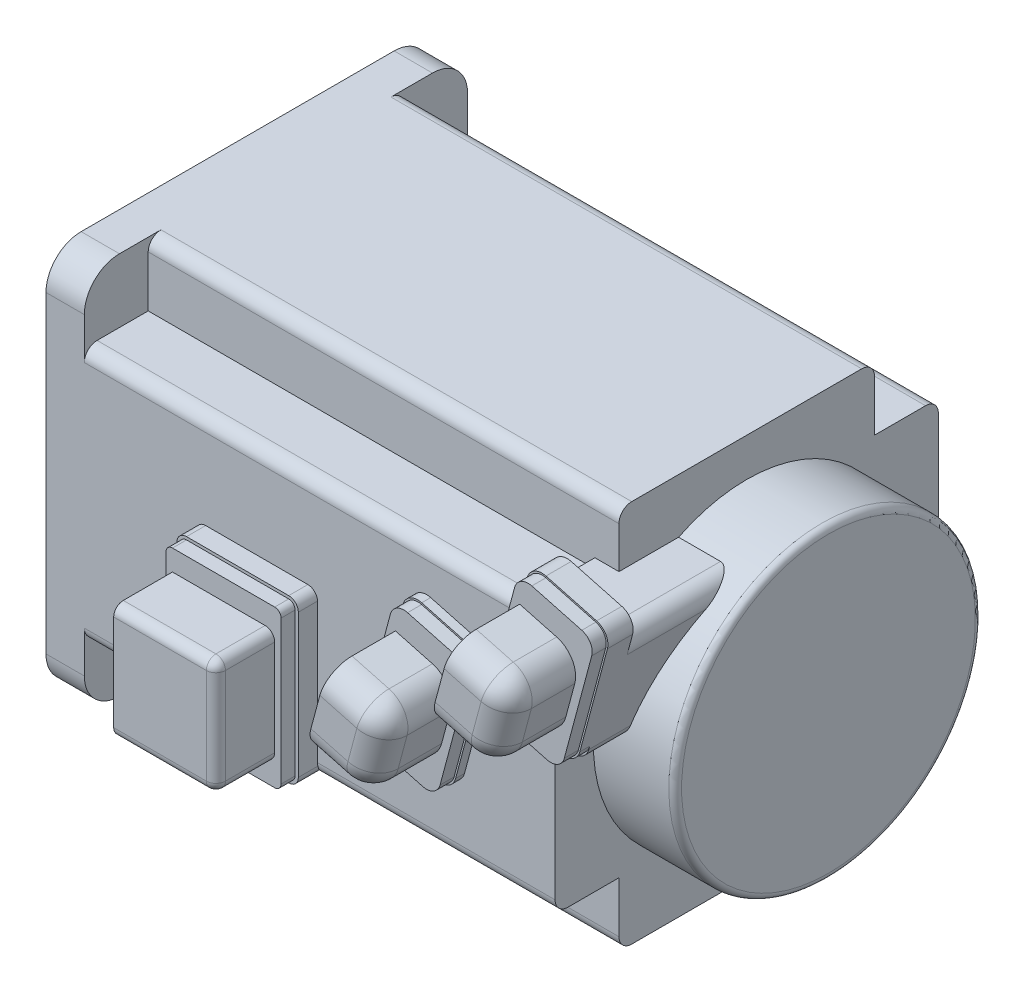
ISO-10303-21;
HEADER;
FILE_DESCRIPTION(('STEP AP214'),'2;1');
FILE_NAME('part.step','',(''),(''),'','','');
FILE_SCHEMA(('AUTOMOTIVE_DESIGN { 1 0 10303 214 1 1 1 1 }'));
ENDSEC;
DATA;
#1=APPLICATION_CONTEXT('core data for automotive mechanical design processes');
#2=APPLICATION_PROTOCOL_DEFINITION('international standard','automotive_design',2000,#1);
#3=PRODUCT_CONTEXT('',#1,'mechanical');
#4=PRODUCT('Part','Part','',(#3));
#5=PRODUCT_RELATED_PRODUCT_CATEGORY('part','',(#4));
#6=PRODUCT_DEFINITION_FORMATION('','',#4);
#7=PRODUCT_DEFINITION_CONTEXT('part definition',#1,'design');
#8=PRODUCT_DEFINITION('design','',#6,#7);
#9=PRODUCT_DEFINITION_SHAPE('','',#8);
#10=(LENGTH_UNIT() NAMED_UNIT(*) SI_UNIT(.MILLI.,.METRE.));
#11=(NAMED_UNIT(*) PLANE_ANGLE_UNIT() SI_UNIT($,.RADIAN.));
#12=(NAMED_UNIT(*) SI_UNIT($,.STERADIAN.) SOLID_ANGLE_UNIT());
#13=UNCERTAINTY_MEASURE_WITH_UNIT(LENGTH_MEASURE(1.E-05),#10,'distance_accuracy_value','');
#14=(GEOMETRIC_REPRESENTATION_CONTEXT(3) GLOBAL_UNCERTAINTY_ASSIGNED_CONTEXT((#13)) GLOBAL_UNIT_ASSIGNED_CONTEXT((#10,
#11,#12)) REPRESENTATION_CONTEXT('',''));
#15=CARTESIAN_POINT('',(0.,0.,0.));
#16=DIRECTION('',(0.,0.,1.));
#17=DIRECTION('',(1.,0.,0.));
#18=AXIS2_PLACEMENT_3D('',#15,#16,#17);
#19=CARTESIAN_POINT('',(-163.435262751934,-100.850819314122,1177.2));
#20=DIRECTION('',(0.,-1.,0.));
#21=DIRECTION('',(0.,0.,-1.));
#22=AXIS2_PLACEMENT_3D('',#19,#20,#21);
#23=SPHERICAL_SURFACE('',#22,4.);
#24=CARTESIAN_POINT('',(-163.435262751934,-100.850819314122,1177.2));
#25=DIRECTION('',(0.,0.,1.));
#26=DIRECTION('',(0.,-1.,0.));
#27=AXIS2_PLACEMENT_3D('',#24,#25,#26);
#28=CIRCLE('',#27,4.00000000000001);
#29=CARTESIAN_POINT('',(-162.399986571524,-96.9871160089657,1177.2));
#30=VERTEX_POINT('',#29);
#31=CARTESIAN_POINT('',(-159.571559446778,-101.886095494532,1177.2));
#32=VERTEX_POINT('',#31);
#33=EDGE_CURVE('E99',#30,#32,#28,.F.);
#34=ORIENTED_EDGE('',*,*,#33,.F.);
#35=CARTESIAN_POINT('',(-163.435262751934,-100.850819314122,1177.2));
#36=DIRECTION('',(0.965925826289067,-0.258819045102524,0.));
#37=DIRECTION('',(0.258819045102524,0.965925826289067,0.));
#38=AXIS2_PLACEMENT_3D('',#35,#36,#37);
#39=CIRCLE('',#38,4.);
#40=CARTESIAN_POINT('',(-163.435262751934,-100.850819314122,1181.2));
#41=VERTEX_POINT('',#40);
#42=EDGE_CURVE('E21',#41,#30,#39,.F.);
#43=ORIENTED_EDGE('',*,*,#42,.F.);
#44=CARTESIAN_POINT('',(-163.435262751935,-100.850819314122,1177.2));
#45=DIRECTION('',(-0.258819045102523,-0.965925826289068,0.));
#46=DIRECTION('',(0.965925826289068,-0.258819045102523,0.));
#47=AXIS2_PLACEMENT_3D('',#44,#45,#46);
#48=CIRCLE('',#47,4.);
#49=EDGE_CURVE('E97',#32,#41,#48,.T.);
#50=ORIENTED_EDGE('',*,*,#49,.F.);
#51=EDGE_LOOP('',(#34,#43,#50));
#52=FACE_BOUND('',#51,.T.);
#53=ADVANCED_FACE('F17',(#52),#23,.T.);
#54=CARTESIAN_POINT('',(-166.816003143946,-99.9449526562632,1177.2));
#55=DIRECTION('',(0.965925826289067,-0.258819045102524,0.));
#56=DIRECTION('',(0.258819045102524,0.965925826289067,0.));
#57=AXIS2_PLACEMENT_3D('',#54,#55,#56);
#58=CYLINDRICAL_SURFACE('',#57,4.);
#59=ORIENTED_EDGE('',*,*,#42,.T.);
#60=DIRECTION('',(-0.965925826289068,0.258819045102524,0.));
#61=VECTOR('',#60,1.);
#62=CARTESIAN_POINT('',(-168.195541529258,-95.4342017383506,1177.2));
#63=LINE('',#62,#61);
#64=CARTESIAN_POINT('',(-168.195541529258,-95.4342017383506,1177.2));
#65=VERTEX_POINT('',#64);
#66=EDGE_CURVE('E1250',#65,#30,#63,.F.);
#67=ORIENTED_EDGE('',*,*,#66,.F.);
#68=CARTESIAN_POINT('',(-169.230817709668,-99.297905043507,1177.2));
#69=DIRECTION('',(0.965925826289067,-0.258819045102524,0.));
#70=DIRECTION('',(0.258819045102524,0.965925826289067,0.));
#71=AXIS2_PLACEMENT_3D('',#68,#69,#70);
#72=CIRCLE('',#71,4.);
#73=CARTESIAN_POINT('',(-169.230817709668,-99.2979050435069,1181.2));
#74=VERTEX_POINT('',#73);
#75=EDGE_CURVE('E119',#74,#65,#72,.F.);
#76=ORIENTED_EDGE('',*,*,#75,.F.);
#77=DIRECTION('',(0.965925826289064,-0.258819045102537,0.));
#78=VECTOR('',#77,1.);
#79=CARTESIAN_POINT('',(-169.230817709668,-99.2979050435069,1181.2));
#80=LINE('',#79,#78);
#81=EDGE_CURVE('E105',#74,#41,#80,.T.);
#82=ORIENTED_EDGE('',*,*,#81,.T.);
#83=EDGE_LOOP('',(#59,#67,#76,#82));
#84=FACE_BOUND('',#83,.T.);
#85=ADVANCED_FACE('F118',(#84),#58,.T.);
#86=CARTESIAN_POINT('',(-165.1,-103.2,1181.2));
#87=DIRECTION('',(0.,0.,-1.));
#88=DIRECTION('',(-1.,0.,0.));
#89=AXIS2_PLACEMENT_3D('',#86,#87,#88);
#90=PLANE('',#89);
#91=DIRECTION('',(-0.258819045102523,-0.965925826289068,0.));
#92=VECTOR('',#91,1.);
#93=CARTESIAN_POINT('',(-171.663716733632,-108.377607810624,1181.2));
#94=LINE('',#93,#92);
#95=CARTESIAN_POINT('',(-170.628440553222,-104.513904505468,1181.2));
#96=VERTEX_POINT('',#95);
#97=EDGE_CURVE('E1395',#96,#74,#94,.F.);
#98=ORIENTED_EDGE('',*,*,#97,.F.);
#99=DIRECTION('',(-0.965925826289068,0.258819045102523,0.));
#100=VECTOR('',#99,1.);
#101=CARTESIAN_POINT('',(-163.383996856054,-106.455047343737,1181.2));
#102=LINE('',#101,#100);
#103=CARTESIAN_POINT('',(-164.832885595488,-106.066818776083,1181.2));
#104=VERTEX_POINT('',#103);
#105=EDGE_CURVE('E123',#104,#96,#102,.T.);
#106=ORIENTED_EDGE('',*,*,#105,.F.);
#107=DIRECTION('',(-0.258819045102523,-0.965925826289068,0.));
#108=VECTOR('',#107,1.);
#109=CARTESIAN_POINT('',(-163.267030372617,-100.222967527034,1181.2));
#110=LINE('',#109,#108);
#111=EDGE_CURVE('E111',#41,#104,#110,.T.);
#112=ORIENTED_EDGE('',*,*,#111,.F.);
#113=ORIENTED_EDGE('',*,*,#81,.F.);
#114=EDGE_LOOP('',(#98,#106,#112,#113));
#115=FACE_BOUND('',#114,.T.);
#116=ADVANCED_FACE('F125',(#115),#90,.F.);
#117=CARTESIAN_POINT('',(-163.383996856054,-106.455047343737,1177.2));
#118=DIRECTION('',(-0.965925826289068,0.258819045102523,0.));
#119=DIRECTION('',(-0.258819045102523,-0.965925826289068,0.));
#120=AXIS2_PLACEMENT_3D('',#117,#118,#119);
#121=CYLINDRICAL_SURFACE('',#120,4.);
#122=CARTESIAN_POINT('',(-164.832885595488,-106.066818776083,1177.2));
#123=DIRECTION('',(-0.965925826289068,0.258819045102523,0.));
#124=DIRECTION('',(-0.258819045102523,-0.965925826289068,0.));
#125=AXIS2_PLACEMENT_3D('',#122,#123,#124);
#126=CIRCLE('',#125,4.);
#127=CARTESIAN_POINT('',(-165.868161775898,-109.930522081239,1177.2));
#128=VERTEX_POINT('',#127);
#129=EDGE_CURVE('E115',#104,#128,#126,.F.);
#130=ORIENTED_EDGE('',*,*,#129,.F.);
#131=ORIENTED_EDGE('',*,*,#105,.T.);
#132=CARTESIAN_POINT('',(-170.628440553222,-104.513904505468,1177.2));
#133=DIRECTION('',(-0.965925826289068,0.258819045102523,0.));
#134=DIRECTION('',(-0.258819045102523,-0.965925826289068,0.));
#135=AXIS2_PLACEMENT_3D('',#132,#133,#134);
#136=CIRCLE('',#135,4.);
#137=CARTESIAN_POINT('',(-171.663716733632,-108.377607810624,1177.2));
#138=VERTEX_POINT('',#137);
#139=EDGE_CURVE('E1397',#138,#96,#136,.T.);
#140=ORIENTED_EDGE('',*,*,#139,.F.);
#141=DIRECTION('',(0.965925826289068,-0.258819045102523,0.));
#142=VECTOR('',#141,1.);
#143=CARTESIAN_POINT('',(-162.004458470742,-110.965798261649,1177.2));
#144=LINE('',#143,#142);
#145=EDGE_CURVE('E1246',#128,#138,#144,.F.);
#146=ORIENTED_EDGE('',*,*,#145,.F.);
#147=EDGE_LOOP('',(#130,#131,#140,#146));
#148=FACE_BOUND('',#147,.T.);
#149=ADVANCED_FACE('F1241',(#148),#121,.T.);
#150=CARTESIAN_POINT('',(-164.832885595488,-106.066818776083,1177.2));
#151=DIRECTION('',(0.,-1.,0.));
#152=DIRECTION('',(0.,0.,-1.));
#153=AXIS2_PLACEMENT_3D('',#150,#151,#152);
#154=SPHERICAL_SURFACE('',#153,4.);
#155=CARTESIAN_POINT('',(-164.832885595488,-106.066818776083,1177.2));
#156=DIRECTION('',(0.,0.,1.));
#157=DIRECTION('',(0.,-1.,0.));
#158=AXIS2_PLACEMENT_3D('',#155,#156,#157);
#159=CIRCLE('',#158,4.);
#160=CARTESIAN_POINT('',(-160.969182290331,-107.102094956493,1177.2));
#161=VERTEX_POINT('',#160);
#162=CARTESIAN_POINT('',(-164.832885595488,-110.066818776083,1177.2));
#163=VERTEX_POINT('',#162);
#164=EDGE_CURVE('E36',#161,#163,#159,.F.);
#165=ORIENTED_EDGE('',*,*,#164,.F.);
#166=CARTESIAN_POINT('',(-164.832885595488,-106.066818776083,1177.2));
#167=DIRECTION('',(-0.258819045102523,-0.965925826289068,0.));
#168=DIRECTION('',(0.965925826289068,-0.258819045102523,0.));
#169=AXIS2_PLACEMENT_3D('',#166,#167,#168);
#170=CIRCLE('',#169,4.);
#171=EDGE_CURVE('E126',#104,#161,#170,.F.);
#172=ORIENTED_EDGE('',*,*,#171,.F.);
#173=ORIENTED_EDGE('',*,*,#129,.T.);
#174=CARTESIAN_POINT('',(-164.832885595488,-106.066818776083,1177.2));
#175=DIRECTION('',(0.,0.,1.));
#176=DIRECTION('',(0.,-1.,0.));
#177=AXIS2_PLACEMENT_3D('',#174,#175,#176);
#178=CIRCLE('',#177,4.);
#179=EDGE_CURVE('E1382',#163,#128,#178,.F.);
#180=ORIENTED_EDGE('',*,*,#179,.F.);
#181=EDGE_LOOP('',(#165,#172,#173,#180));
#182=FACE_BOUND('',#181,.T.);
#183=ADVANCED_FACE('F1237',(#182),#154,.T.);
#184=CARTESIAN_POINT('',(-163.267030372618,-100.222967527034,1177.2));
#185=DIRECTION('',(-0.258819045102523,-0.965925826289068,0.));
#186=DIRECTION('',(0.965925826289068,-0.258819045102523,0.));
#187=AXIS2_PLACEMENT_3D('',#184,#185,#186);
#188=CYLINDRICAL_SURFACE('',#187,4.);
#189=ORIENTED_EDGE('',*,*,#171,.T.);
#190=DIRECTION('',(0.258819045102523,0.965925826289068,0.));
#191=VECTOR('',#190,1.);
#192=CARTESIAN_POINT('',(-158.536283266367,-98.0223921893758,1177.2));
#193=LINE('',#192,#191);
#194=EDGE_CURVE('E114',#32,#161,#193,.F.);
#195=ORIENTED_EDGE('',*,*,#194,.F.);
#196=ORIENTED_EDGE('',*,*,#49,.T.);
#197=ORIENTED_EDGE('',*,*,#111,.T.);
#198=EDGE_LOOP('',(#189,#195,#196,#197));
#199=FACE_BOUND('',#198,.T.);
#200=ADVANCED_FACE('F109',(#199),#188,.T.);
#201=CARTESIAN_POINT('',(-143.835262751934,-87.3508193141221,1177.35));
#202=DIRECTION('',(0.,-1.,0.));
#203=DIRECTION('',(0.,0.,-1.));
#204=AXIS2_PLACEMENT_3D('',#201,#202,#203);
#205=SPHERICAL_SURFACE('',#204,4.);
#206=CARTESIAN_POINT('',(-143.835262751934,-87.3508193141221,1177.35));
#207=DIRECTION('',(0.,0.,1.));
#208=DIRECTION('',(0.,-1.,0.));
#209=AXIS2_PLACEMENT_3D('',#206,#207,#208);
#210=CIRCLE('',#209,4.);
#211=CARTESIAN_POINT('',(-142.799986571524,-83.4871160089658,1177.35));
#212=VERTEX_POINT('',#211);
#213=CARTESIAN_POINT('',(-139.971559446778,-88.3860954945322,1177.35));
#214=VERTEX_POINT('',#213);
#215=EDGE_CURVE('E1192',#212,#214,#210,.F.);
#216=ORIENTED_EDGE('',*,*,#215,.F.);
#217=CARTESIAN_POINT('',(-143.835262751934,-87.3508193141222,1177.35));
#218=DIRECTION('',(0.965925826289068,-0.258819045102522,0.));
#219=DIRECTION('',(0.258819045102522,0.965925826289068,0.));
#220=AXIS2_PLACEMENT_3D('',#217,#218,#219);
#221=CIRCLE('',#220,4.);
#222=CARTESIAN_POINT('',(-143.835262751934,-87.3508193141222,1181.35));
#223=VERTEX_POINT('',#222);
#224=EDGE_CURVE('E128',#223,#212,#221,.F.);
#225=ORIENTED_EDGE('',*,*,#224,.F.);
#226=CARTESIAN_POINT('',(-143.835262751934,-87.3508193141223,1177.35));
#227=DIRECTION('',(-0.258819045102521,-0.965925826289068,0.));
#228=DIRECTION('',(0.965925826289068,-0.258819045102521,0.));
#229=AXIS2_PLACEMENT_3D('',#226,#227,#228);
#230=CIRCLE('',#229,4.);
#231=EDGE_CURVE('E1411',#214,#223,#230,.T.);
#232=ORIENTED_EDGE('',*,*,#231,.F.);
#233=EDGE_LOOP('',(#216,#225,#232));
#234=FACE_BOUND('',#233,.T.);
#235=ADVANCED_FACE('F1229',(#234),#205,.T.);
#236=CARTESIAN_POINT('',(-147.216003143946,-86.4449526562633,1177.35));
#237=DIRECTION('',(0.965925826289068,-0.258819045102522,0.));
#238=DIRECTION('',(0.258819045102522,0.965925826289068,0.));
#239=AXIS2_PLACEMENT_3D('',#236,#237,#238);
#240=CYLINDRICAL_SURFACE('',#239,4.);
#241=ORIENTED_EDGE('',*,*,#224,.T.);
#242=DIRECTION('',(-0.965925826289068,0.258819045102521,0.));
#243=VECTOR('',#242,1.);
#244=CARTESIAN_POINT('',(-148.595541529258,-81.9342017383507,1177.35));
#245=LINE('',#244,#243);
#246=CARTESIAN_POINT('',(-148.595541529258,-81.9342017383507,1177.35));
#247=VERTEX_POINT('',#246);
#248=EDGE_CURVE('E1221',#247,#212,#245,.F.);
#249=ORIENTED_EDGE('',*,*,#248,.F.);
#250=CARTESIAN_POINT('',(-149.630817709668,-85.7979050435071,1177.35));
#251=DIRECTION('',(0.965925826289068,-0.258819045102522,0.));
#252=DIRECTION('',(0.258819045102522,0.965925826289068,0.));
#253=AXIS2_PLACEMENT_3D('',#250,#251,#252);
#254=CIRCLE('',#253,4.);
#255=CARTESIAN_POINT('',(-149.630817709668,-85.797905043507,1181.35));
#256=VERTEX_POINT('',#255);
#257=EDGE_CURVE('E1369',#256,#247,#254,.F.);
#258=ORIENTED_EDGE('',*,*,#257,.F.);
#259=DIRECTION('',(0.965925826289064,-0.258819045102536,0.));
#260=VECTOR('',#259,1.);
#261=CARTESIAN_POINT('',(-149.630817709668,-85.797905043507,1181.35));
#262=LINE('',#261,#260);
#263=EDGE_CURVE('E1214',#256,#223,#262,.T.);
#264=ORIENTED_EDGE('',*,*,#263,.T.);
#265=EDGE_LOOP('',(#241,#249,#258,#264));
#266=FACE_BOUND('',#265,.T.);
#267=ADVANCED_FACE('F1233',(#266),#240,.T.);
#268=CARTESIAN_POINT('',(-145.5,-89.7,1181.35));
#269=DIRECTION('',(0.,0.,-1.));
#270=DIRECTION('',(0.,1.,0.));
#271=AXIS2_PLACEMENT_3D('',#268,#269,#270);
#272=PLANE('',#271);
#273=DIRECTION('',(-0.258819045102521,-0.965925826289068,0.));
#274=VECTOR('',#273,1.);
#275=CARTESIAN_POINT('',(-152.063716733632,-94.8776078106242,1181.35));
#276=LINE('',#275,#274);
#277=CARTESIAN_POINT('',(-151.028440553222,-91.013904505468,1181.35));
#278=VERTEX_POINT('',#277);
#279=EDGE_CURVE('E1362',#278,#256,#276,.F.);
#280=ORIENTED_EDGE('',*,*,#279,.F.);
#281=DIRECTION('',(-0.965925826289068,0.258819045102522,0.));
#282=VECTOR('',#281,1.);
#283=CARTESIAN_POINT('',(-143.783996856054,-92.955047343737,1181.35));
#284=LINE('',#283,#282);
#285=CARTESIAN_POINT('',(-145.232885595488,-92.5668187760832,1181.35));
#286=VERTEX_POINT('',#285);
#287=EDGE_CURVE('E1217',#286,#278,#284,.T.);
#288=ORIENTED_EDGE('',*,*,#287,.F.);
#289=DIRECTION('',(-0.258819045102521,-0.965925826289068,0.));
#290=VECTOR('',#289,1.);
#291=CARTESIAN_POINT('',(-143.667030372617,-86.7229675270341,1181.35));
#292=LINE('',#291,#290);
#293=EDGE_CURVE('E131',#223,#286,#292,.T.);
#294=ORIENTED_EDGE('',*,*,#293,.F.);
#295=ORIENTED_EDGE('',*,*,#263,.F.);
#296=EDGE_LOOP('',(#280,#288,#294,#295));
#297=FACE_BOUND('',#296,.T.);
#298=ADVANCED_FACE('F1630',(#297),#272,.F.);
#299=CARTESIAN_POINT('',(-143.783996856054,-92.9550473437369,1177.35));
#300=DIRECTION('',(-0.965925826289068,0.258819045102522,0.));
#301=DIRECTION('',(-0.258819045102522,-0.965925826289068,0.));
#302=AXIS2_PLACEMENT_3D('',#299,#300,#301);
#303=CYLINDRICAL_SURFACE('',#302,4.);
#304=CARTESIAN_POINT('',(-145.232885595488,-92.566818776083,1177.35));
#305=DIRECTION('',(-0.965925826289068,0.258819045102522,0.));
#306=DIRECTION('',(-0.258819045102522,-0.965925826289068,0.));
#307=AXIS2_PLACEMENT_3D('',#304,#305,#306);
#308=CIRCLE('',#307,4.);
#309=CARTESIAN_POINT('',(-146.268161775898,-96.4305220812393,1177.35));
#310=VERTEX_POINT('',#309);
#311=EDGE_CURVE('E1220',#286,#310,#308,.F.);
#312=ORIENTED_EDGE('',*,*,#311,.F.);
#313=ORIENTED_EDGE('',*,*,#287,.T.);
#314=CARTESIAN_POINT('',(-151.028440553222,-91.013904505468,1177.35));
#315=DIRECTION('',(-0.965925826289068,0.258819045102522,0.));
#316=DIRECTION('',(-0.258819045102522,-0.965925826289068,0.));
#317=AXIS2_PLACEMENT_3D('',#314,#315,#316);
#318=CIRCLE('',#317,4.);
#319=CARTESIAN_POINT('',(-152.063716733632,-94.8776078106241,1177.35));
#320=VERTEX_POINT('',#319);
#321=EDGE_CURVE('E1365',#320,#278,#318,.T.);
#322=ORIENTED_EDGE('',*,*,#321,.F.);
#323=DIRECTION('',(0.965925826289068,-0.258819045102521,0.));
#324=VECTOR('',#323,1.);
#325=CARTESIAN_POINT('',(-142.404458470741,-97.4657982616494,1177.35));
#326=LINE('',#325,#324);
#327=EDGE_CURVE('E1212',#310,#320,#326,.F.);
#328=ORIENTED_EDGE('',*,*,#327,.F.);
#329=EDGE_LOOP('',(#312,#313,#322,#328));
#330=FACE_BOUND('',#329,.T.);
#331=ADVANCED_FACE('F1206',(#330),#303,.T.);
#332=CARTESIAN_POINT('',(-145.232885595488,-92.5668187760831,1177.35));
#333=DIRECTION('',(0.,-1.,0.));
#334=DIRECTION('',(0.,0.,-1.));
#335=AXIS2_PLACEMENT_3D('',#332,#333,#334);
#336=SPHERICAL_SURFACE('',#335,4.);
#337=CARTESIAN_POINT('',(-145.232885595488,-92.5668187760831,1177.35));
#338=DIRECTION('',(0.,0.,1.));
#339=DIRECTION('',(0.,-1.,0.));
#340=AXIS2_PLACEMENT_3D('',#337,#338,#339);
#341=CIRCLE('',#340,4.);
#342=CARTESIAN_POINT('',(-141.369182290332,-93.6020949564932,1177.35));
#343=VERTEX_POINT('',#342);
#344=CARTESIAN_POINT('',(-145.232885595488,-96.5668187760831,1177.35));
#345=VERTEX_POINT('',#344);
#346=EDGE_CURVE('E1352',#343,#345,#341,.F.);
#347=ORIENTED_EDGE('',*,*,#346,.F.);
#348=CARTESIAN_POINT('',(-145.232885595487,-92.5668187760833,1177.35));
#349=DIRECTION('',(-0.258819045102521,-0.965925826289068,0.));
#350=DIRECTION('',(0.965925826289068,-0.258819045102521,0.));
#351=AXIS2_PLACEMENT_3D('',#348,#349,#350);
#352=CIRCLE('',#351,4.);
#353=EDGE_CURVE('E1187',#286,#343,#352,.F.);
#354=ORIENTED_EDGE('',*,*,#353,.F.);
#355=ORIENTED_EDGE('',*,*,#311,.T.);
#356=CARTESIAN_POINT('',(-145.232885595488,-92.5668187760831,1177.35));
#357=DIRECTION('',(0.,0.,1.));
#358=DIRECTION('',(0.,-1.,0.));
#359=AXIS2_PLACEMENT_3D('',#356,#357,#358);
#360=CIRCLE('',#359,4.);
#361=EDGE_CURVE('E1348',#345,#310,#360,.F.);
#362=ORIENTED_EDGE('',*,*,#361,.F.);
#363=EDGE_LOOP('',(#347,#354,#355,#362));
#364=FACE_BOUND('',#363,.T.);
#365=ADVANCED_FACE('F1201',(#364),#336,.T.);
#366=CARTESIAN_POINT('',(-143.667030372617,-86.7229675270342,1177.35));
#367=DIRECTION('',(-0.258819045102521,-0.965925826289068,0.));
#368=DIRECTION('',(0.965925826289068,-0.258819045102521,0.));
#369=AXIS2_PLACEMENT_3D('',#366,#367,#368);
#370=CYLINDRICAL_SURFACE('',#369,4.);
#371=ORIENTED_EDGE('',*,*,#353,.T.);
#372=DIRECTION('',(0.258819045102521,0.965925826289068,0.));
#373=VECTOR('',#372,1.);
#374=CARTESIAN_POINT('',(-138.936283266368,-84.5223921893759,1177.35));
#375=LINE('',#374,#373);
#376=EDGE_CURVE('E1343',#214,#343,#375,.F.);
#377=ORIENTED_EDGE('',*,*,#376,.F.);
#378=ORIENTED_EDGE('',*,*,#231,.T.);
#379=ORIENTED_EDGE('',*,*,#293,.T.);
#380=EDGE_LOOP('',(#371,#377,#378,#379));
#381=FACE_BOUND('',#380,.T.);
#382=ADVANCED_FACE('F1197',(#381),#370,.T.);
#383=CARTESIAN_POINT('',(-187.,-119.8,1179.7));
#384=DIRECTION('',(0.,-1.,0.));
#385=DIRECTION('',(0.,0.,-1.));
#386=AXIS2_PLACEMENT_3D('',#383,#384,#385);
#387=SPHERICAL_SURFACE('',#386,1.5);
#388=CARTESIAN_POINT('',(-187.,-119.8,1179.7));
#389=DIRECTION('',(0.,0.,1.));
#390=DIRECTION('',(0.,-1.,0.));
#391=AXIS2_PLACEMENT_3D('',#388,#389,#390);
#392=CIRCLE('',#391,1.5);
#393=CARTESIAN_POINT('',(-185.5,-119.8,1179.7));
#394=VERTEX_POINT('',#393);
#395=CARTESIAN_POINT('',(-187.,-121.3,1179.7));
#396=VERTEX_POINT('',#395);
#397=EDGE_CURVE('E1280',#394,#396,#392,.F.);
#398=ORIENTED_EDGE('',*,*,#397,.F.);
#399=CARTESIAN_POINT('',(-187.,-119.8,1179.7));
#400=DIRECTION('',(0.,-1.,0.));
#401=DIRECTION('',(0.,0.,-1.));
#402=AXIS2_PLACEMENT_3D('',#399,#400,#401);
#403=CIRCLE('',#402,1.5);
#404=CARTESIAN_POINT('',(-187.,-119.8,1181.2));
#405=VERTEX_POINT('',#404);
#406=EDGE_CURVE('E1182',#405,#394,#403,.F.);
#407=ORIENTED_EDGE('',*,*,#406,.F.);
#408=CARTESIAN_POINT('',(-187.,-119.8,1179.7));
#409=DIRECTION('',(-1.,0.,0.));
#410=DIRECTION('',(0.,0.,1.));
#411=AXIS2_PLACEMENT_3D('',#408,#409,#410);
#412=CIRCLE('',#411,1.5);
#413=EDGE_CURVE('E1264',#396,#405,#412,.T.);
#414=ORIENTED_EDGE('',*,*,#413,.F.);
#415=EDGE_LOOP('',(#398,#407,#414));
#416=FACE_BOUND('',#415,.T.);
#417=ADVANCED_FACE('F1194',(#416),#387,.T.);
#418=CARTESIAN_POINT('',(-187.,-107.8,1179.7));
#419=DIRECTION('',(0.,-1.,0.));
#420=DIRECTION('',(0.,0.,-1.));
#421=AXIS2_PLACEMENT_3D('',#418,#419,#420);
#422=CYLINDRICAL_SURFACE('',#421,1.5);
#423=ORIENTED_EDGE('',*,*,#406,.T.);
#424=DIRECTION('',(0.,1.,0.));
#425=VECTOR('',#424,1.);
#426=CARTESIAN_POINT('',(-185.5,-103.3,1179.7));
#427=LINE('',#426,#425);
#428=CARTESIAN_POINT('',(-185.5,-104.8,1179.7));
#429=VERTEX_POINT('',#428);
#430=EDGE_CURVE('E1277',#429,#394,#427,.F.);
#431=ORIENTED_EDGE('',*,*,#430,.F.);
#432=CARTESIAN_POINT('',(-187.,-104.8,1179.7));
#433=DIRECTION('',(0.,-1.,0.));
#434=DIRECTION('',(0.,0.,-1.));
#435=AXIS2_PLACEMENT_3D('',#432,#433,#434);
#436=CIRCLE('',#435,1.50000000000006);
#437=CARTESIAN_POINT('',(-187.,-104.8,1181.2));
#438=VERTEX_POINT('',#437);
#439=EDGE_CURVE('E1178',#438,#429,#436,.F.);
#440=ORIENTED_EDGE('',*,*,#439,.F.);
#441=DIRECTION('',(0.,1.,0.));
#442=VECTOR('',#441,1.);
#443=CARTESIAN_POINT('',(-187.,-112.3,1181.2));
#444=LINE('',#443,#442);
#445=EDGE_CURVE('E1254',#438,#405,#444,.F.);
#446=ORIENTED_EDGE('',*,*,#445,.T.);
#447=EDGE_LOOP('',(#423,#431,#440,#446));
#448=FACE_BOUND('',#447,.T.);
#449=ADVANCED_FACE('F1170',(#448),#422,.T.);
#450=CARTESIAN_POINT('',(-187.,-104.8,1179.7));
#451=DIRECTION('',(0.,-1.,0.));
#452=DIRECTION('',(0.,0.,-1.));
#453=AXIS2_PLACEMENT_3D('',#450,#451,#452);
#454=SPHERICAL_SURFACE('',#453,1.5);
#455=CARTESIAN_POINT('',(-187.,-104.8,1179.7));
#456=DIRECTION('',(0.,0.,1.));
#457=DIRECTION('',(0.,-1.,0.));
#458=AXIS2_PLACEMENT_3D('',#455,#456,#457);
#459=CIRCLE('',#458,1.5);
#460=CARTESIAN_POINT('',(-187.,-103.3,1179.7));
#461=VERTEX_POINT('',#460);
#462=EDGE_CURVE('E1285',#461,#429,#459,.F.);
#463=ORIENTED_EDGE('',*,*,#462,.F.);
#464=CARTESIAN_POINT('',(-187.,-104.8,1179.7));
#465=DIRECTION('',(1.,0.,0.));
#466=DIRECTION('',(0.,0.,-1.));
#467=AXIS2_PLACEMENT_3D('',#464,#465,#466);
#468=CIRCLE('',#467,1.5);
#469=EDGE_CURVE('E1181',#438,#461,#468,.F.);
#470=ORIENTED_EDGE('',*,*,#469,.F.);
#471=ORIENTED_EDGE('',*,*,#439,.T.);
#472=EDGE_LOOP('',(#463,#470,#471));
#473=FACE_BOUND('',#472,.T.);
#474=ADVANCED_FACE('F1165',(#473),#454,.T.);
#475=CARTESIAN_POINT('',(-197.5,-104.8,1179.7));
#476=DIRECTION('',(1.,0.,0.));
#477=DIRECTION('',(0.,0.,-1.));
#478=AXIS2_PLACEMENT_3D('',#475,#476,#477);
#479=CYLINDRICAL_SURFACE('',#478,1.5);
#480=ORIENTED_EDGE('',*,*,#469,.T.);
#481=DIRECTION('',(1.,0.,0.));
#482=VECTOR('',#481,1.);
#483=CARTESIAN_POINT('',(-201.5,-103.3,1179.7));
#484=LINE('',#483,#482);
#485=CARTESIAN_POINT('',(-201.5,-103.3,1179.7));
#486=VERTEX_POINT('',#485);
#487=EDGE_CURVE('E1320',#486,#461,#484,.T.);
#488=ORIENTED_EDGE('',*,*,#487,.F.);
#489=CARTESIAN_POINT('',(-201.5,-104.8,1179.7));
#490=DIRECTION('',(1.,0.,0.));
#491=DIRECTION('',(0.,0.,-1.));
#492=AXIS2_PLACEMENT_3D('',#489,#490,#491);
#493=CIRCLE('',#492,1.5);
#494=CARTESIAN_POINT('',(-201.5,-104.8,1181.2));
#495=VERTEX_POINT('',#494);
#496=EDGE_CURVE('E1470',#495,#486,#493,.F.);
#497=ORIENTED_EDGE('',*,*,#496,.F.);
#498=DIRECTION('',(-1.,0.,0.));
#499=VECTOR('',#498,1.);
#500=CARTESIAN_POINT('',(-193.5,-104.8,1181.2));
#501=LINE('',#500,#499);
#502=EDGE_CURVE('E1256',#495,#438,#501,.F.);
#503=ORIENTED_EDGE('',*,*,#502,.T.);
#504=EDGE_LOOP('',(#480,#488,#497,#503));
#505=FACE_BOUND('',#504,.T.);
#506=ADVANCED_FACE('F1161',(#505),#479,.T.);
#507=CARTESIAN_POINT('',(-193.5,-112.3,1181.2));
#508=DIRECTION('',(0.,0.,-1.));
#509=DIRECTION('',(-1.,0.,0.));
#510=AXIS2_PLACEMENT_3D('',#507,#508,#509);
#511=PLANE('',#510);
#512=DIRECTION('',(0.,-1.,0.));
#513=VECTOR('',#512,1.);
#514=CARTESIAN_POINT('',(-201.5,-121.3,1181.2));
#515=LINE('',#514,#513);
#516=CARTESIAN_POINT('',(-201.5,-119.8,1181.2));
#517=VERTEX_POINT('',#516);
#518=EDGE_CURVE('E1306',#517,#495,#515,.F.);
#519=ORIENTED_EDGE('',*,*,#518,.F.);
#520=DIRECTION('',(-1.,0.,0.));
#521=VECTOR('',#520,1.);
#522=CARTESIAN_POINT('',(-189.5,-119.8,1181.2));
#523=LINE('',#522,#521);
#524=EDGE_CURVE('E1311',#405,#517,#523,.T.);
#525=ORIENTED_EDGE('',*,*,#524,.F.);
#526=ORIENTED_EDGE('',*,*,#445,.F.);
#527=ORIENTED_EDGE('',*,*,#502,.F.);
#528=EDGE_LOOP('',(#519,#525,#526,#527));
#529=FACE_BOUND('',#528,.T.);
#530=ADVANCED_FACE('F1157',(#529),#511,.F.);
#531=CARTESIAN_POINT('',(-189.5,-119.8,1179.7));
#532=DIRECTION('',(-1.,0.,0.));
#533=DIRECTION('',(0.,0.,1.));
#534=AXIS2_PLACEMENT_3D('',#531,#532,#533);
#535=CYLINDRICAL_SURFACE('',#534,1.5);
#536=ORIENTED_EDGE('',*,*,#413,.T.);
#537=ORIENTED_EDGE('',*,*,#524,.T.);
#538=CARTESIAN_POINT('',(-201.5,-119.8,1179.7));
#539=DIRECTION('',(-1.,0.,0.));
#540=DIRECTION('',(0.,0.,1.));
#541=AXIS2_PLACEMENT_3D('',#538,#539,#540);
#542=CIRCLE('',#541,1.5);
#543=CARTESIAN_POINT('',(-201.5,-121.3,1179.7));
#544=VERTEX_POINT('',#543);
#545=EDGE_CURVE('E1466',#544,#517,#542,.T.);
#546=ORIENTED_EDGE('',*,*,#545,.F.);
#547=DIRECTION('',(1.,0.,0.));
#548=VECTOR('',#547,1.);
#549=CARTESIAN_POINT('',(-185.5,-121.3,1179.7));
#550=LINE('',#549,#548);
#551=EDGE_CURVE('E1302',#396,#544,#550,.F.);
#552=ORIENTED_EDGE('',*,*,#551,.F.);
#553=EDGE_LOOP('',(#536,#537,#546,#552));
#554=FACE_BOUND('',#553,.T.);
#555=ADVANCED_FACE('F1153',(#554),#535,.T.);
#556=CARTESIAN_POINT('',(-163.435262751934,-100.850819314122,1170.4));
#557=DIRECTION('',(0.,0.,1.));
#558=DIRECTION('',(0.,-1.,0.));
#559=AXIS2_PLACEMENT_3D('',#556,#557,#558);
#560=CYLINDRICAL_SURFACE('',#559,4.00000000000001);
#561=CARTESIAN_POINT('',(-163.435262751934,-100.850819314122,1170.4));
#562=DIRECTION('',(0.,0.,1.));
#563=DIRECTION('',(0.,-1.,0.));
#564=AXIS2_PLACEMENT_3D('',#561,#562,#563);
#565=CIRCLE('',#564,4.00000000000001);
#566=CARTESIAN_POINT('',(-159.571559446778,-101.886095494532,1170.4));
#567=VERTEX_POINT('',#566);
#568=CARTESIAN_POINT('',(-162.399986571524,-96.9871160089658,1170.4));
#569=VERTEX_POINT('',#568);
#570=EDGE_CURVE('E1441',#567,#569,#565,.T.);
#571=ORIENTED_EDGE('',*,*,#570,.T.);
#572=DIRECTION('',(0.,0.,1.));
#573=VECTOR('',#572,1.);
#574=CARTESIAN_POINT('',(-162.399986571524,-96.9871160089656,1170.4));
#575=LINE('',#574,#573);
#576=EDGE_CURVE('E1251',#30,#569,#575,.F.);
#577=ORIENTED_EDGE('',*,*,#576,.F.);
#578=ORIENTED_EDGE('',*,*,#33,.T.);
#579=DIRECTION('',(0.,0.,1.));
#580=VECTOR('',#579,1.);
#581=CARTESIAN_POINT('',(-159.571559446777,-101.886095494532,1170.4));
#582=LINE('',#581,#580);
#583=EDGE_CURVE('E1377',#567,#32,#582,.T.);
#584=ORIENTED_EDGE('',*,*,#583,.F.);
#585=EDGE_LOOP('',(#571,#577,#578,#584));
#586=FACE_BOUND('',#585,.T.);
#587=ADVANCED_FACE('F1149',(#586),#560,.T.);
#588=CARTESIAN_POINT('',(-168.195541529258,-95.4342017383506,1170.4));
#589=DIRECTION('',(0.258819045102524,0.965925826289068,0.));
#590=DIRECTION('',(-0.965925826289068,0.258819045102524,0.));
#591=AXIS2_PLACEMENT_3D('',#588,#589,#590);
#592=PLANE('',#591);
#593=DIRECTION('',(-0.96592582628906,0.25881904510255,0.));
#594=VECTOR('',#593,1.);
#595=CARTESIAN_POINT('',(-162.399986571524,-96.9871160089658,1170.4));
#596=LINE('',#595,#594);
#597=CARTESIAN_POINT('',(-168.195541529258,-95.4342017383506,1170.4));
#598=VERTEX_POINT('',#597);
#599=EDGE_CURVE('E1392',#569,#598,#596,.T.);
#600=ORIENTED_EDGE('',*,*,#599,.T.);
#601=DIRECTION('',(0.,0.,1.));
#602=VECTOR('',#601,1.);
#603=CARTESIAN_POINT('',(-168.195541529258,-95.4342017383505,1170.4));
#604=LINE('',#603,#602);
#605=EDGE_CURVE('E1398',#65,#598,#604,.F.);
#606=ORIENTED_EDGE('',*,*,#605,.F.);
#607=ORIENTED_EDGE('',*,*,#66,.T.);
#608=ORIENTED_EDGE('',*,*,#576,.T.);
#609=EDGE_LOOP('',(#600,#606,#607,#608));
#610=FACE_BOUND('',#609,.T.);
#611=ADVANCED_FACE('F1145',(#610),#592,.T.);
#612=CARTESIAN_POINT('',(-171.663716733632,-108.377607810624,1170.4));
#613=DIRECTION('',(-0.965925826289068,0.258819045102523,0.));
#614=DIRECTION('',(-0.258819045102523,-0.965925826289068,0.));
#615=AXIS2_PLACEMENT_3D('',#612,#613,#614);
#616=PLANE('',#615);
#617=ORIENTED_EDGE('',*,*,#139,.T.);
#618=ORIENTED_EDGE('',*,*,#97,.T.);
#619=ORIENTED_EDGE('',*,*,#75,.T.);
#620=ORIENTED_EDGE('',*,*,#605,.T.);
#621=DIRECTION('',(-0.258819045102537,-0.965925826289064,0.));
#622=VECTOR('',#621,1.);
#623=CARTESIAN_POINT('',(-168.195541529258,-95.4342017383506,1170.4));
#624=LINE('',#623,#622);
#625=CARTESIAN_POINT('',(-171.663716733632,-108.377607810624,1170.4));
#626=VERTEX_POINT('',#625);
#627=EDGE_CURVE('E1388',#598,#626,#624,.T.);
#628=ORIENTED_EDGE('',*,*,#627,.T.);
#629=DIRECTION('',(0.,0.,1.));
#630=VECTOR('',#629,1.);
#631=CARTESIAN_POINT('',(-171.663716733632,-108.377607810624,1170.4));
#632=LINE('',#631,#630);
#633=EDGE_CURVE('E1383',#138,#626,#632,.F.);
#634=ORIENTED_EDGE('',*,*,#633,.F.);
#635=EDGE_LOOP('',(#617,#618,#619,#620,#628,#634));
#636=FACE_BOUND('',#635,.T.);
#637=ADVANCED_FACE('F1141',(#636),#616,.T.);
#638=CARTESIAN_POINT('',(-162.004458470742,-110.965798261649,1170.4));
#639=DIRECTION('',(-0.258819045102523,-0.965925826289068,0.));
#640=DIRECTION('',(0.965925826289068,-0.258819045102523,0.));
#641=AXIS2_PLACEMENT_3D('',#638,#639,#640);
#642=PLANE('',#641);
#643=DIRECTION('',(0.965925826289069,-0.25881904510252,0.));
#644=VECTOR('',#643,1.);
#645=CARTESIAN_POINT('',(-171.663716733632,-108.377607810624,1170.4));
#646=LINE('',#645,#644);
#647=CARTESIAN_POINT('',(-165.868161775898,-109.930522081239,1170.4));
#648=VERTEX_POINT('',#647);
#649=EDGE_CURVE('E1391',#626,#648,#646,.T.);
#650=ORIENTED_EDGE('',*,*,#649,.T.);
#651=DIRECTION('',(0.,0.,1.));
#652=VECTOR('',#651,1.);
#653=CARTESIAN_POINT('',(-165.868161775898,-109.930522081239,1170.4));
#654=LINE('',#653,#652);
#655=EDGE_CURVE('E1379',#128,#648,#654,.F.);
#656=ORIENTED_EDGE('',*,*,#655,.F.);
#657=ORIENTED_EDGE('',*,*,#145,.T.);
#658=ORIENTED_EDGE('',*,*,#633,.T.);
#659=EDGE_LOOP('',(#650,#656,#657,#658));
#660=FACE_BOUND('',#659,.T.);
#661=ADVANCED_FACE('F1138',(#660),#642,.T.);
#662=CARTESIAN_POINT('',(-164.832885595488,-106.066818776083,1170.4));
#663=DIRECTION('',(0.,0.,1.));
#664=DIRECTION('',(0.,-1.,0.));
#665=AXIS2_PLACEMENT_3D('',#662,#663,#664);
#666=CYLINDRICAL_SURFACE('',#665,4.);
#667=CARTESIAN_POINT('',(-164.832885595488,-106.066818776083,1170.4));
#668=DIRECTION('',(0.,0.,1.));
#669=DIRECTION('',(0.,-1.,0.));
#670=AXIS2_PLACEMENT_3D('',#667,#668,#669);
#671=CIRCLE('',#670,4.);
#672=CARTESIAN_POINT('',(-160.969182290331,-107.102094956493,1170.4));
#673=VERTEX_POINT('',#672);
#674=EDGE_CURVE('E1430',#648,#673,#671,.T.);
#675=ORIENTED_EDGE('',*,*,#674,.T.);
#676=DIRECTION('',(0.,0.,1.));
#677=VECTOR('',#676,1.);
#678=CARTESIAN_POINT('',(-160.969182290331,-107.102094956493,1170.4));
#679=LINE('',#678,#677);
#680=EDGE_CURVE('E1374',#161,#673,#679,.F.);
#681=ORIENTED_EDGE('',*,*,#680,.F.);
#682=ORIENTED_EDGE('',*,*,#164,.T.);
#683=ORIENTED_EDGE('',*,*,#179,.T.);
#684=ORIENTED_EDGE('',*,*,#655,.T.);
#685=EDGE_LOOP('',(#675,#681,#682,#683,#684));
#686=FACE_BOUND('',#685,.T.);
#687=ADVANCED_FACE('F1134',(#686),#666,.T.);
#688=CARTESIAN_POINT('',(-158.536283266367,-98.0223921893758,1170.4));
#689=DIRECTION('',(0.965925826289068,-0.258819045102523,0.));
#690=DIRECTION('',(0.258819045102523,0.965925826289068,0.));
#691=AXIS2_PLACEMENT_3D('',#688,#689,#690);
#692=PLANE('',#691);
#693=DIRECTION('',(0.258819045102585,0.965925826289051,0.));
#694=VECTOR('',#693,1.);
#695=CARTESIAN_POINT('',(-160.969182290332,-107.102094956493,1170.4));
#696=LINE('',#695,#694);
#697=EDGE_CURVE('E1432',#673,#567,#696,.T.);
#698=ORIENTED_EDGE('',*,*,#697,.T.);
#699=ORIENTED_EDGE('',*,*,#583,.T.);
#700=ORIENTED_EDGE('',*,*,#194,.T.);
#701=ORIENTED_EDGE('',*,*,#680,.T.);
#702=EDGE_LOOP('',(#698,#699,#700,#701));
#703=FACE_BOUND('',#702,.T.);
#704=ADVANCED_FACE('F1130',(#703),#692,.T.);
#705=CARTESIAN_POINT('',(-143.835262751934,-87.3508193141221,1170.55));
#706=DIRECTION('',(0.,0.,1.));
#707=DIRECTION('',(0.,-1.,0.));
#708=AXIS2_PLACEMENT_3D('',#705,#706,#707);
#709=CYLINDRICAL_SURFACE('',#708,4.);
#710=CARTESIAN_POINT('',(-143.835262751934,-87.3508193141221,1170.55));
#711=DIRECTION('',(0.,0.,1.));
#712=DIRECTION('',(0.,-1.,0.));
#713=AXIS2_PLACEMENT_3D('',#710,#711,#712);
#714=CIRCLE('',#713,4.);
#715=CARTESIAN_POINT('',(-139.971559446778,-88.3860954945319,1170.55));
#716=VERTEX_POINT('',#715);
#717=CARTESIAN_POINT('',(-142.799986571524,-83.4871160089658,1170.55));
#718=VERTEX_POINT('',#717);
#719=EDGE_CURVE('E1506',#716,#718,#714,.T.);
#720=ORIENTED_EDGE('',*,*,#719,.T.);
#721=DIRECTION('',(0.,0.,1.));
#722=VECTOR('',#721,1.);
#723=CARTESIAN_POINT('',(-142.799986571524,-83.4871160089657,1170.55));
#724=LINE('',#723,#722);
#725=EDGE_CURVE('E1224',#212,#718,#724,.F.);
#726=ORIENTED_EDGE('',*,*,#725,.F.);
#727=ORIENTED_EDGE('',*,*,#215,.T.);
#728=DIRECTION('',(0.,0.,1.));
#729=VECTOR('',#728,1.);
#730=CARTESIAN_POINT('',(-139.971559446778,-88.3860954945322,1170.55));
#731=LINE('',#730,#729);
#732=EDGE_CURVE('E1288',#716,#214,#731,.T.);
#733=ORIENTED_EDGE('',*,*,#732,.F.);
#734=EDGE_LOOP('',(#720,#726,#727,#733));
#735=FACE_BOUND('',#734,.T.);
#736=ADVANCED_FACE('F1126',(#735),#709,.T.);
#737=CARTESIAN_POINT('',(-148.595541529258,-81.9342017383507,1170.55));
#738=DIRECTION('',(0.258819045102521,0.965925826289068,0.));
#739=DIRECTION('',(-0.965925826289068,0.258819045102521,0.));
#740=AXIS2_PLACEMENT_3D('',#737,#738,#739);
#741=PLANE('',#740);
#742=DIRECTION('',(-0.965925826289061,0.258819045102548,0.));
#743=VECTOR('',#742,1.);
#744=CARTESIAN_POINT('',(-142.799986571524,-83.4871160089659,1170.55));
#745=LINE('',#744,#743);
#746=CARTESIAN_POINT('',(-148.595541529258,-81.9342017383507,1170.55));
#747=VERTEX_POINT('',#746);
#748=EDGE_CURVE('E1359',#718,#747,#745,.T.);
#749=ORIENTED_EDGE('',*,*,#748,.T.);
#750=DIRECTION('',(0.,0.,1.));
#751=VECTOR('',#750,1.);
#752=CARTESIAN_POINT('',(-148.595541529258,-81.9342017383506,1170.55));
#753=LINE('',#752,#751);
#754=EDGE_CURVE('E1366',#247,#747,#753,.F.);
#755=ORIENTED_EDGE('',*,*,#754,.F.);
#756=ORIENTED_EDGE('',*,*,#248,.T.);
#757=ORIENTED_EDGE('',*,*,#725,.T.);
#758=EDGE_LOOP('',(#749,#755,#756,#757));
#759=FACE_BOUND('',#758,.T.);
#760=ADVANCED_FACE('F1122',(#759),#741,.T.);
#761=CARTESIAN_POINT('',(-152.063716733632,-94.8776078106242,1170.55));
#762=DIRECTION('',(-0.965925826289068,0.258819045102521,0.));
#763=DIRECTION('',(-0.258819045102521,-0.965925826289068,0.));
#764=AXIS2_PLACEMENT_3D('',#761,#762,#763);
#765=PLANE('',#764);
#766=ORIENTED_EDGE('',*,*,#321,.T.);
#767=ORIENTED_EDGE('',*,*,#279,.T.);
#768=ORIENTED_EDGE('',*,*,#257,.T.);
#769=ORIENTED_EDGE('',*,*,#754,.T.);
#770=DIRECTION('',(-0.258819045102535,-0.965925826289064,0.));
#771=VECTOR('',#770,1.);
#772=CARTESIAN_POINT('',(-148.595541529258,-81.9342017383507,1170.55));
#773=LINE('',#772,#771);
#774=CARTESIAN_POINT('',(-152.063716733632,-94.8776078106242,1170.55));
#775=VERTEX_POINT('',#774);
#776=EDGE_CURVE('E1355',#747,#775,#773,.T.);
#777=ORIENTED_EDGE('',*,*,#776,.T.);
#778=DIRECTION('',(0.,0.,1.));
#779=VECTOR('',#778,1.);
#780=CARTESIAN_POINT('',(-152.063716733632,-94.8776078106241,1170.55));
#781=LINE('',#780,#779);
#782=EDGE_CURVE('E1349',#320,#775,#781,.F.);
#783=ORIENTED_EDGE('',*,*,#782,.F.);
#784=EDGE_LOOP('',(#766,#767,#768,#769,#777,#783));
#785=FACE_BOUND('',#784,.T.);
#786=ADVANCED_FACE('F1118',(#785),#765,.T.);
#787=CARTESIAN_POINT('',(-142.404458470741,-97.4657982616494,1170.55));
#788=DIRECTION('',(-0.258819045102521,-0.965925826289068,0.));
#789=DIRECTION('',(0.965925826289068,-0.258819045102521,0.));
#790=AXIS2_PLACEMENT_3D('',#787,#788,#789);
#791=PLANE('',#790);
#792=DIRECTION('',(0.96592582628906,-0.258819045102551,0.));
#793=VECTOR('',#792,1.);
#794=CARTESIAN_POINT('',(-152.063716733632,-94.8776078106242,1170.55));
#795=LINE('',#794,#793);
#796=CARTESIAN_POINT('',(-146.268161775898,-96.4305220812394,1170.55));
#797=VERTEX_POINT('',#796);
#798=EDGE_CURVE('E1358',#775,#797,#795,.T.);
#799=ORIENTED_EDGE('',*,*,#798,.T.);
#800=DIRECTION('',(0.,0.,1.));
#801=VECTOR('',#800,1.);
#802=CARTESIAN_POINT('',(-146.268161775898,-96.4305220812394,1170.55));
#803=LINE('',#802,#801);
#804=EDGE_CURVE('E1345',#310,#797,#803,.F.);
#805=ORIENTED_EDGE('',*,*,#804,.F.);
#806=ORIENTED_EDGE('',*,*,#327,.T.);
#807=ORIENTED_EDGE('',*,*,#782,.T.);
#808=EDGE_LOOP('',(#799,#805,#806,#807));
#809=FACE_BOUND('',#808,.T.);
#810=ADVANCED_FACE('F1114',(#809),#791,.T.);
#811=CARTESIAN_POINT('',(-145.232885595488,-92.5668187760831,1170.55));
#812=DIRECTION('',(0.,0.,1.));
#813=DIRECTION('',(0.,-1.,0.));
#814=AXIS2_PLACEMENT_3D('',#811,#812,#813);
#815=CYLINDRICAL_SURFACE('',#814,4.);
#816=CARTESIAN_POINT('',(-145.232885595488,-92.5668187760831,1170.55));
#817=DIRECTION('',(0.,0.,1.));
#818=DIRECTION('',(0.,-1.,0.));
#819=AXIS2_PLACEMENT_3D('',#816,#817,#818);
#820=CIRCLE('',#819,4.);
#821=CARTESIAN_POINT('',(-141.369182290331,-93.602094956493,1170.55));
#822=VERTEX_POINT('',#821);
#823=EDGE_CURVE('E1603',#797,#822,#820,.T.);
#824=ORIENTED_EDGE('',*,*,#823,.T.);
#825=DIRECTION('',(0.,0.,1.));
#826=VECTOR('',#825,1.);
#827=CARTESIAN_POINT('',(-141.369182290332,-93.602094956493,1170.55));
#828=LINE('',#827,#826);
#829=EDGE_CURVE('E1295',#343,#822,#828,.F.);
#830=ORIENTED_EDGE('',*,*,#829,.F.);
#831=ORIENTED_EDGE('',*,*,#346,.T.);
#832=ORIENTED_EDGE('',*,*,#361,.T.);
#833=ORIENTED_EDGE('',*,*,#804,.T.);
#834=EDGE_LOOP('',(#824,#830,#831,#832,#833));
#835=FACE_BOUND('',#834,.T.);
#836=ADVANCED_FACE('F1110',(#835),#815,.T.);
#837=CARTESIAN_POINT('',(-138.936283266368,-84.5223921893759,1170.55));
#838=DIRECTION('',(0.965925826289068,-0.258819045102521,0.));
#839=DIRECTION('',(0.258819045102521,0.965925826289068,0.));
#840=AXIS2_PLACEMENT_3D('',#837,#838,#839);
#841=PLANE('',#840);
#842=DIRECTION('',(0.258819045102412,0.965925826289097,0.));
#843=VECTOR('',#842,1.);
#844=CARTESIAN_POINT('',(-141.369182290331,-93.6020949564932,1170.55));
#845=LINE('',#844,#843);
#846=EDGE_CURVE('E1602',#822,#716,#845,.T.);
#847=ORIENTED_EDGE('',*,*,#846,.T.);
#848=ORIENTED_EDGE('',*,*,#732,.T.);
#849=ORIENTED_EDGE('',*,*,#376,.T.);
#850=ORIENTED_EDGE('',*,*,#829,.T.);
#851=EDGE_LOOP('',(#847,#848,#849,#850));
#852=FACE_BOUND('',#851,.T.);
#853=ADVANCED_FACE('F1106',(#852),#841,.T.);
#854=CARTESIAN_POINT('',(-187.,-119.8,1172.));
#855=DIRECTION('',(0.,0.,1.));
#856=DIRECTION('',(0.,-1.,0.));
#857=AXIS2_PLACEMENT_3D('',#854,#855,#856);
#858=CYLINDRICAL_SURFACE('',#857,1.5);
#859=CARTESIAN_POINT('',(-187.,-119.8,1172.));
#860=DIRECTION('',(0.,0.,1.));
#861=DIRECTION('',(0.,-1.,0.));
#862=AXIS2_PLACEMENT_3D('',#859,#860,#861);
#863=CIRCLE('',#862,1.5);
#864=CARTESIAN_POINT('',(-187.,-121.3,1172.));
#865=VERTEX_POINT('',#864);
#866=CARTESIAN_POINT('',(-185.5,-119.8,1172.));
#867=VERTEX_POINT('',#866);
#868=EDGE_CURVE('E1590',#865,#867,#863,.T.);
#869=ORIENTED_EDGE('',*,*,#868,.T.);
#870=DIRECTION('',(0.,0.,1.));
#871=VECTOR('',#870,1.);
#872=CARTESIAN_POINT('',(-185.5,-119.8,1172.));
#873=LINE('',#872,#871);
#874=EDGE_CURVE('E1279',#394,#867,#873,.F.);
#875=ORIENTED_EDGE('',*,*,#874,.F.);
#876=ORIENTED_EDGE('',*,*,#397,.T.);
#877=DIRECTION('',(0.,0.,-1.));
#878=VECTOR('',#877,1.);
#879=CARTESIAN_POINT('',(-187.,-121.3,1172.));
#880=LINE('',#879,#878);
#881=EDGE_CURVE('E1448',#865,#396,#880,.F.);
#882=ORIENTED_EDGE('',*,*,#881,.F.);
#883=EDGE_LOOP('',(#869,#875,#876,#882));
#884=FACE_BOUND('',#883,.T.);
#885=ADVANCED_FACE('F1102',(#884),#858,.T.);
#886=CARTESIAN_POINT('',(-185.5,-103.3,1172.));
#887=DIRECTION('',(1.,0.,0.));
#888=DIRECTION('',(0.,1.,0.));
#889=AXIS2_PLACEMENT_3D('',#886,#887,#888);
#890=PLANE('',#889);
#891=DIRECTION('',(0.,1.,0.));
#892=VECTOR('',#891,1.);
#893=CARTESIAN_POINT('',(-185.5,-112.3,1172.));
#894=LINE('',#893,#892);
#895=CARTESIAN_POINT('',(-185.5,-104.8,1172.));
#896=VERTEX_POINT('',#895);
#897=EDGE_CURVE('E1589',#867,#896,#894,.T.);
#898=ORIENTED_EDGE('',*,*,#897,.T.);
#899=DIRECTION('',(0.,0.,1.));
#900=VECTOR('',#899,1.);
#901=CARTESIAN_POINT('',(-185.5,-104.8,1172.));
#902=LINE('',#901,#900);
#903=EDGE_CURVE('E1323',#429,#896,#902,.F.);
#904=ORIENTED_EDGE('',*,*,#903,.F.);
#905=ORIENTED_EDGE('',*,*,#430,.T.);
#906=ORIENTED_EDGE('',*,*,#874,.T.);
#907=EDGE_LOOP('',(#898,#904,#905,#906));
#908=FACE_BOUND('',#907,.T.);
#909=ADVANCED_FACE('F1098',(#908),#890,.T.);
#910=CARTESIAN_POINT('',(-187.,-104.8,1172.));
#911=DIRECTION('',(0.,0.,1.));
#912=DIRECTION('',(0.,-1.,0.));
#913=AXIS2_PLACEMENT_3D('',#910,#911,#912);
#914=CYLINDRICAL_SURFACE('',#913,1.5);
#915=CARTESIAN_POINT('',(-187.,-104.8,1172.));
#916=DIRECTION('',(0.,0.,1.));
#917=DIRECTION('',(0.,-1.,0.));
#918=AXIS2_PLACEMENT_3D('',#915,#916,#917);
#919=CIRCLE('',#918,1.5);
#920=CARTESIAN_POINT('',(-187.,-103.3,1172.));
#921=VERTEX_POINT('',#920);
#922=EDGE_CURVE('E1587',#896,#921,#919,.T.);
#923=ORIENTED_EDGE('',*,*,#922,.T.);
#924=DIRECTION('',(0.,0.,1.));
#925=VECTOR('',#924,1.);
#926=CARTESIAN_POINT('',(-187.,-103.3,1172.));
#927=LINE('',#926,#925);
#928=EDGE_CURVE('E1322',#461,#921,#927,.F.);
#929=ORIENTED_EDGE('',*,*,#928,.F.);
#930=ORIENTED_EDGE('',*,*,#462,.T.);
#931=ORIENTED_EDGE('',*,*,#903,.T.);
#932=EDGE_LOOP('',(#923,#929,#930,#931));
#933=FACE_BOUND('',#932,.T.);
#934=ADVANCED_FACE('F1094',(#933),#914,.T.);
#935=CARTESIAN_POINT('',(-201.5,-103.3,1172.));
#936=DIRECTION('',(0.,1.,0.));
#937=DIRECTION('',(0.,0.,1.));
#938=AXIS2_PLACEMENT_3D('',#935,#936,#937);
#939=PLANE('',#938);
#940=DIRECTION('',(-1.,0.,0.));
#941=VECTOR('',#940,1.);
#942=CARTESIAN_POINT('',(-193.5,-103.3,1172.));
#943=LINE('',#942,#941);
#944=CARTESIAN_POINT('',(-201.5,-103.3,1172.));
#945=VERTEX_POINT('',#944);
#946=EDGE_CURVE('E1461',#921,#945,#943,.T.);
#947=ORIENTED_EDGE('',*,*,#946,.T.);
#948=DIRECTION('',(0.,0.,1.));
#949=VECTOR('',#948,1.);
#950=CARTESIAN_POINT('',(-201.5,-103.3,1172.));
#951=LINE('',#950,#949);
#952=EDGE_CURVE('E1467',#486,#945,#951,.F.);
#953=ORIENTED_EDGE('',*,*,#952,.F.);
#954=ORIENTED_EDGE('',*,*,#487,.T.);
#955=ORIENTED_EDGE('',*,*,#928,.T.);
#956=EDGE_LOOP('',(#947,#953,#954,#955));
#957=FACE_BOUND('',#956,.T.);
#958=ADVANCED_FACE('F1090',(#957),#939,.T.);
#959=CARTESIAN_POINT('',(-201.5,-121.3,1172.));
#960=DIRECTION('',(-1.,0.,0.));
#961=DIRECTION('',(0.,-1.,0.));
#962=AXIS2_PLACEMENT_3D('',#959,#960,#961);
#963=PLANE('',#962);
#964=ORIENTED_EDGE('',*,*,#545,.T.);
#965=ORIENTED_EDGE('',*,*,#518,.T.);
#966=ORIENTED_EDGE('',*,*,#496,.T.);
#967=ORIENTED_EDGE('',*,*,#952,.T.);
#968=DIRECTION('',(0.,1.,0.));
#969=VECTOR('',#968,1.);
#970=CARTESIAN_POINT('',(-201.5,-112.3,1172.));
#971=LINE('',#970,#969);
#972=CARTESIAN_POINT('',(-201.5,-121.3,1172.));
#973=VERTEX_POINT('',#972);
#974=EDGE_CURVE('E1457',#945,#973,#971,.F.);
#975=ORIENTED_EDGE('',*,*,#974,.T.);
#976=DIRECTION('',(0.,0.,-1.));
#977=VECTOR('',#976,1.);
#978=CARTESIAN_POINT('',(-201.5,-121.3,1172.));
#979=LINE('',#978,#977);
#980=EDGE_CURVE('E1305',#544,#973,#979,.T.);
#981=ORIENTED_EDGE('',*,*,#980,.F.);
#982=EDGE_LOOP('',(#964,#965,#966,#967,#975,#981));
#983=FACE_BOUND('',#982,.T.);
#984=ADVANCED_FACE('F1086',(#983),#963,.T.);
#985=CARTESIAN_POINT('',(-185.5,-121.3,1172.));
#986=DIRECTION('',(0.,-1.,0.));
#987=DIRECTION('',(0.,0.,-1.));
#988=AXIS2_PLACEMENT_3D('',#985,#986,#987);
#989=PLANE('',#988);
#990=DIRECTION('',(-1.,0.,0.));
#991=VECTOR('',#990,1.);
#992=CARTESIAN_POINT('',(-193.5,-121.3,1172.));
#993=LINE('',#992,#991);
#994=EDGE_CURVE('E1460',#973,#865,#993,.F.);
#995=ORIENTED_EDGE('',*,*,#994,.T.);
#996=ORIENTED_EDGE('',*,*,#881,.T.);
#997=ORIENTED_EDGE('',*,*,#551,.T.);
#998=ORIENTED_EDGE('',*,*,#980,.T.);
#999=EDGE_LOOP('',(#995,#996,#997,#998));
#1000=FACE_BOUND('',#999,.T.);
#1001=ADVANCED_FACE('F1082',(#1000),#989,.T.);
#1002=CARTESIAN_POINT('',(-165.1,-103.2,1170.4));
#1003=DIRECTION('',(0.,0.,-1.));
#1004=DIRECTION('',(-1.,0.,0.));
#1005=AXIS2_PLACEMENT_3D('',#1002,#1003,#1004);
#1006=PLANE('',#1005);
#1007=DIRECTION('',(0.965925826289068,-0.258819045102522,0.));
#1008=VECTOR('',#1007,1.);
#1009=CARTESIAN_POINT('',(-161.78056355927,-114.959840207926,1170.4));
#1010=LINE('',#1009,#1008);
#1011=CARTESIAN_POINT('',(-163.905600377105,-114.3904383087,1170.4));
#1012=VERTEX_POINT('',#1011);
#1013=CARTESIAN_POINT('',(-171.729599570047,-112.29400404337,1170.4));
#1014=VERTEX_POINT('',#1013);
#1015=EDGE_CURVE('E1519',#1012,#1014,#1010,.F.);
#1016=ORIENTED_EDGE('',*,*,#1015,.F.);
#1017=CARTESIAN_POINT('',(-163.33619847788,-112.265401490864,1170.4));
#1018=DIRECTION('',(0.,0.,1.));
#1019=DIRECTION('',(0.,-1.,0.));
#1020=AXIS2_PLACEMENT_3D('',#1017,#1018,#1019);
#1021=CIRCLE('',#1020,2.2);
#1022=CARTESIAN_POINT('',(-161.211161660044,-112.83480339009,1170.4));
#1023=VERTEX_POINT('',#1022);
#1024=EDGE_CURVE('E1033',#1023,#1012,#1021,.F.);
#1025=ORIENTED_EDGE('',*,*,#1024,.F.);
#1026=DIRECTION('',(0.258819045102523,0.965925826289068,0.));
#1027=VECTOR('',#1026,1.);
#1028=CARTESIAN_POINT('',(-156.345363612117,-94.6753978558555,1170.4));
#1029=LINE('',#1028,#1027);
#1030=CARTESIAN_POINT('',(-156.914765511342,-96.8004346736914,1170.4));
#1031=VERTEX_POINT('',#1030);
#1032=EDGE_CURVE('E1029',#1031,#1023,#1029,.F.);
#1033=ORIENTED_EDGE('',*,*,#1032,.F.);
#1034=CARTESIAN_POINT('',(-159.039802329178,-96.2310327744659,1170.4));
#1035=DIRECTION('',(0.,0.,1.));
#1036=DIRECTION('',(0.,-1.,0.));
#1037=AXIS2_PLACEMENT_3D('',#1034,#1035,#1036);
#1038=CIRCLE('',#1037,2.2);
#1039=CARTESIAN_POINT('',(-158.470400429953,-94.10599595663,1170.4));
#1040=VERTEX_POINT('',#1039);
#1041=EDGE_CURVE('E1025',#1040,#1031,#1038,.F.);
#1042=ORIENTED_EDGE('',*,*,#1041,.F.);
#1043=DIRECTION('',(-0.965925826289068,0.258819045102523,0.));
#1044=VECTOR('',#1043,1.);
#1045=CARTESIAN_POINT('',(-168.41943644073,-91.440159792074,1170.4));
#1046=LINE('',#1045,#1044);
#1047=CARTESIAN_POINT('',(-166.294399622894,-92.0095616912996,1170.4));
#1048=VERTEX_POINT('',#1047);
#1049=EDGE_CURVE('E1021',#1048,#1040,#1046,.F.);
#1050=ORIENTED_EDGE('',*,*,#1049,.F.);
#1051=CARTESIAN_POINT('',(-166.86380152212,-94.1345985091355,1170.4));
#1052=DIRECTION('',(0.,0.,1.));
#1053=DIRECTION('',(0.,-1.,0.));
#1054=AXIS2_PLACEMENT_3D('',#1051,#1052,#1053);
#1055=CIRCLE('',#1054,2.2);
#1056=CARTESIAN_POINT('',(-168.988838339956,-93.56519660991,1170.4));
#1057=VERTEX_POINT('',#1056);
#1058=EDGE_CURVE('E1017',#1057,#1048,#1055,.F.);
#1059=ORIENTED_EDGE('',*,*,#1058,.F.);
#1060=DIRECTION('',(-0.258819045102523,-0.965925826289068,0.));
#1061=VECTOR('',#1060,1.);
#1062=CARTESIAN_POINT('',(-173.854636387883,-111.724602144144,1170.4));
#1063=LINE('',#1062,#1061);
#1064=CARTESIAN_POINT('',(-173.285234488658,-109.599565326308,1170.4));
#1065=VERTEX_POINT('',#1064);
#1066=EDGE_CURVE('E1013',#1065,#1057,#1063,.F.);
#1067=ORIENTED_EDGE('',*,*,#1066,.F.);
#1068=CARTESIAN_POINT('',(-171.160197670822,-110.168967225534,1170.4));
#1069=DIRECTION('',(0.,0.,1.));
#1070=DIRECTION('',(0.,-1.,0.));
#1071=AXIS2_PLACEMENT_3D('',#1068,#1069,#1070);
#1072=CIRCLE('',#1071,2.2);
#1073=EDGE_CURVE('E1007',#1014,#1065,#1072,.F.);
#1074=ORIENTED_EDGE('',*,*,#1073,.F.);
#1075=EDGE_LOOP('',(#1016,#1025,#1033,#1042,#1050,#1059,#1067,#1074));
#1076=FACE_BOUND('',#1075,.T.);
#1077=ORIENTED_EDGE('',*,*,#674,.F.);
#1078=ORIENTED_EDGE('',*,*,#649,.F.);
#1079=ORIENTED_EDGE('',*,*,#627,.F.);
#1080=ORIENTED_EDGE('',*,*,#599,.F.);
#1081=ORIENTED_EDGE('',*,*,#570,.F.);
#1082=ORIENTED_EDGE('',*,*,#697,.F.);
#1083=EDGE_LOOP('',(#1077,#1078,#1079,#1080,#1081,#1082));
#1084=FACE_BOUND('',#1083,.T.);
#1085=ADVANCED_FACE('F1078',(#1076,#1084),#1006,.F.);
#1086=CARTESIAN_POINT('',(-145.5,-89.7,1170.55));
#1087=DIRECTION('',(0.,0.,-1.));
#1088=DIRECTION('',(0.,1.,0.));
#1089=AXIS2_PLACEMENT_3D('',#1086,#1087,#1088);
#1090=PLANE('',#1089);
#1091=DIRECTION('',(0.965925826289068,-0.258819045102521,0.));
#1092=VECTOR('',#1091,1.);
#1093=CARTESIAN_POINT('',(-142.18056355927,-101.459840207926,1170.55));
#1094=LINE('',#1093,#1092);
#1095=CARTESIAN_POINT('',(-144.305600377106,-100.8904383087,1170.55));
#1096=VERTEX_POINT('',#1095);
#1097=CARTESIAN_POINT('',(-152.129599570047,-98.7940040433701,1170.55));
#1098=VERTEX_POINT('',#1097);
#1099=EDGE_CURVE('E1000',#1096,#1098,#1094,.F.);
#1100=ORIENTED_EDGE('',*,*,#1099,.F.);
#1101=CARTESIAN_POINT('',(-143.73619847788,-98.7654014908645,1170.55));
#1102=DIRECTION('',(0.,0.,1.));
#1103=DIRECTION('',(0.,-1.,0.));
#1104=AXIS2_PLACEMENT_3D('',#1101,#1102,#1103);
#1105=CIRCLE('',#1104,2.20000000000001);
#1106=CARTESIAN_POINT('',(-141.611161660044,-99.33480339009,1170.55));
#1107=VERTEX_POINT('',#1106);
#1108=EDGE_CURVE('E992',#1107,#1096,#1105,.F.);
#1109=ORIENTED_EDGE('',*,*,#1108,.F.);
#1110=DIRECTION('',(0.258819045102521,0.965925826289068,0.));
#1111=VECTOR('',#1110,1.);
#1112=CARTESIAN_POINT('',(-136.745363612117,-81.1753978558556,1170.55));
#1113=LINE('',#1112,#1111);
#1114=CARTESIAN_POINT('',(-137.314765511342,-83.3004346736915,1170.55));
#1115=VERTEX_POINT('',#1114);
#1116=EDGE_CURVE('E988',#1115,#1107,#1113,.F.);
#1117=ORIENTED_EDGE('',*,*,#1116,.F.);
#1118=CARTESIAN_POINT('',(-139.439802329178,-82.731032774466,1170.55));
#1119=DIRECTION('',(0.,0.,1.));
#1120=DIRECTION('',(0.,-1.,0.));
#1121=AXIS2_PLACEMENT_3D('',#1118,#1119,#1120);
#1122=CIRCLE('',#1121,2.2);
#1123=CARTESIAN_POINT('',(-138.870400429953,-80.60599595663,1170.55));
#1124=VERTEX_POINT('',#1123);
#1125=EDGE_CURVE('E984',#1124,#1115,#1122,.F.);
#1126=ORIENTED_EDGE('',*,*,#1125,.F.);
#1127=DIRECTION('',(-0.965925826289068,0.258819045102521,0.));
#1128=VECTOR('',#1127,1.);
#1129=CARTESIAN_POINT('',(-148.81943644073,-77.9401597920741,1170.55));
#1130=LINE('',#1129,#1128);
#1131=CARTESIAN_POINT('',(-146.694399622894,-78.5095616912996,1170.55));
#1132=VERTEX_POINT('',#1131);
#1133=EDGE_CURVE('E980',#1132,#1124,#1130,.F.);
#1134=ORIENTED_EDGE('',*,*,#1133,.F.);
#1135=CARTESIAN_POINT('',(-147.26380152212,-80.6345985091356,1170.55));
#1136=DIRECTION('',(0.,0.,1.));
#1137=DIRECTION('',(0.,-1.,0.));
#1138=AXIS2_PLACEMENT_3D('',#1135,#1136,#1137);
#1139=CIRCLE('',#1138,2.2);
#1140=CARTESIAN_POINT('',(-149.388838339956,-80.0651966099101,1170.55));
#1141=VERTEX_POINT('',#1140);
#1142=EDGE_CURVE('E976',#1141,#1132,#1139,.F.);
#1143=ORIENTED_EDGE('',*,*,#1142,.F.);
#1144=DIRECTION('',(-0.258819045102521,-0.965925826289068,0.));
#1145=VECTOR('',#1144,1.);
#1146=CARTESIAN_POINT('',(-154.254636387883,-98.2246021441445,1170.55));
#1147=LINE('',#1146,#1145);
#1148=CARTESIAN_POINT('',(-153.685234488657,-96.0995653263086,1170.55));
#1149=VERTEX_POINT('',#1148);
#1150=EDGE_CURVE('E972',#1149,#1141,#1147,.F.);
#1151=ORIENTED_EDGE('',*,*,#1150,.F.);
#1152=CARTESIAN_POINT('',(-151.560197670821,-96.6689672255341,1170.55));
#1153=DIRECTION('',(0.,0.,1.));
#1154=DIRECTION('',(0.,-1.,0.));
#1155=AXIS2_PLACEMENT_3D('',#1152,#1153,#1154);
#1156=CIRCLE('',#1155,2.2);
#1157=EDGE_CURVE('E966',#1098,#1149,#1156,.F.);
#1158=ORIENTED_EDGE('',*,*,#1157,.F.);
#1159=EDGE_LOOP('',(#1100,#1109,#1117,#1126,#1134,#1143,#1151,#1158));
#1160=FACE_BOUND('',#1159,.T.);
#1161=ORIENTED_EDGE('',*,*,#823,.F.);
#1162=ORIENTED_EDGE('',*,*,#798,.F.);
#1163=ORIENTED_EDGE('',*,*,#776,.F.);
#1164=ORIENTED_EDGE('',*,*,#748,.F.);
#1165=ORIENTED_EDGE('',*,*,#719,.F.);
#1166=ORIENTED_EDGE('',*,*,#846,.F.);
#1167=EDGE_LOOP('',(#1161,#1162,#1163,#1164,#1165,#1166));
#1168=FACE_BOUND('',#1167,.T.);
#1169=ADVANCED_FACE('F1074',(#1160,#1168),#1090,.F.);
#1170=CARTESIAN_POINT('',(-185.5,-101.05,1169.8));
#1171=DIRECTION('',(0.,0.,1.));
#1172=DIRECTION('',(0.,-1.,0.));
#1173=AXIS2_PLACEMENT_3D('',#1170,#1171,#1172);
#1174=CYLINDRICAL_SURFACE('',#1173,1.);
#1175=CARTESIAN_POINT('',(-185.5,-101.05,1169.8));
#1176=DIRECTION('',(0.,0.,1.));
#1177=DIRECTION('',(0.,-1.,0.));
#1178=AXIS2_PLACEMENT_3D('',#1175,#1176,#1177);
#1179=CIRCLE('',#1178,1.);
#1180=CARTESIAN_POINT('',(-184.5,-101.05,1169.8));
#1181=VERTEX_POINT('',#1180);
#1182=CARTESIAN_POINT('',(-185.5,-100.05,1169.8));
#1183=VERTEX_POINT('',#1182);
#1184=EDGE_CURVE('E1599',#1181,#1183,#1179,.T.);
#1185=ORIENTED_EDGE('',*,*,#1184,.T.);
#1186=DIRECTION('',(0.,0.,1.));
#1187=VECTOR('',#1186,1.);
#1188=CARTESIAN_POINT('',(-185.5,-100.05,1169.8));
#1189=LINE('',#1188,#1187);
#1190=CARTESIAN_POINT('',(-185.5,-100.05,1172.));
#1191=VERTEX_POINT('',#1190);
#1192=EDGE_CURVE('E949',#1191,#1183,#1189,.F.);
#1193=ORIENTED_EDGE('',*,*,#1192,.F.);
#1194=CARTESIAN_POINT('',(-185.5,-101.05,1172.));
#1195=DIRECTION('',(0.,0.,1.));
#1196=DIRECTION('',(0.,-1.,0.));
#1197=AXIS2_PLACEMENT_3D('',#1194,#1195,#1196);
#1198=CIRCLE('',#1197,1.);
#1199=CARTESIAN_POINT('',(-184.5,-101.05,1172.));
#1200=VERTEX_POINT('',#1199);
#1201=EDGE_CURVE('E1578',#1191,#1200,#1198,.F.);
#1202=ORIENTED_EDGE('',*,*,#1201,.T.);
#1203=DIRECTION('',(0.,0.,1.));
#1204=VECTOR('',#1203,1.);
#1205=CARTESIAN_POINT('',(-184.5,-101.05,1169.8));
#1206=LINE('',#1205,#1204);
#1207=EDGE_CURVE('E959',#1181,#1200,#1206,.T.);
#1208=ORIENTED_EDGE('',*,*,#1207,.F.);
#1209=EDGE_LOOP('',(#1185,#1193,#1202,#1208));
#1210=FACE_BOUND('',#1209,.T.);
#1211=ADVANCED_FACE('F1070',(#1210),#1174,.T.);
#1212=CARTESIAN_POINT('',(-201.5,-101.05,1169.8));
#1213=DIRECTION('',(0.,0.,1.));
#1214=DIRECTION('',(0.,-1.,0.));
#1215=AXIS2_PLACEMENT_3D('',#1212,#1213,#1214);
#1216=CYLINDRICAL_SURFACE('',#1215,1.);
#1217=CARTESIAN_POINT('',(-201.5,-101.05,1169.8));
#1218=DIRECTION('',(0.,0.,1.));
#1219=DIRECTION('',(0.,-1.,0.));
#1220=AXIS2_PLACEMENT_3D('',#1217,#1218,#1219);
#1221=CIRCLE('',#1220,1.);
#1222=CARTESIAN_POINT('',(-201.5,-100.05,1169.8));
#1223=VERTEX_POINT('',#1222);
#1224=CARTESIAN_POINT('',(-202.5,-101.05,1169.8));
#1225=VERTEX_POINT('',#1224);
#1226=EDGE_CURVE('E1596',#1223,#1225,#1221,.T.);
#1227=ORIENTED_EDGE('',*,*,#1226,.T.);
#1228=DIRECTION('',(0.,0.,1.));
#1229=VECTOR('',#1228,1.);
#1230=CARTESIAN_POINT('',(-202.5,-101.05,1169.8));
#1231=LINE('',#1230,#1229);
#1232=CARTESIAN_POINT('',(-202.5,-101.05,1172.));
#1233=VERTEX_POINT('',#1232);
#1234=EDGE_CURVE('E941',#1233,#1225,#1231,.F.);
#1235=ORIENTED_EDGE('',*,*,#1234,.F.);
#1236=CARTESIAN_POINT('',(-201.5,-101.05,1172.));
#1237=DIRECTION('',(0.,0.,1.));
#1238=DIRECTION('',(0.,-1.,0.));
#1239=AXIS2_PLACEMENT_3D('',#1236,#1237,#1238);
#1240=CIRCLE('',#1239,1.);
#1241=CARTESIAN_POINT('',(-201.5,-100.05,1172.));
#1242=VERTEX_POINT('',#1241);
#1243=EDGE_CURVE('E1581',#1233,#1242,#1240,.F.);
#1244=ORIENTED_EDGE('',*,*,#1243,.T.);
#1245=DIRECTION('',(0.,0.,1.));
#1246=VECTOR('',#1245,1.);
#1247=CARTESIAN_POINT('',(-201.5,-100.05,1169.8));
#1248=LINE('',#1247,#1246);
#1249=EDGE_CURVE('E952',#1223,#1242,#1248,.T.);
#1250=ORIENTED_EDGE('',*,*,#1249,.F.);
#1251=EDGE_LOOP('',(#1227,#1235,#1244,#1250));
#1252=FACE_BOUND('',#1251,.T.);
#1253=ADVANCED_FACE('F1066',(#1252),#1216,.T.);
#1254=CARTESIAN_POINT('',(-185.5,-123.55,1169.8));
#1255=DIRECTION('',(0.,0.,1.));
#1256=DIRECTION('',(0.,-1.,0.));
#1257=AXIS2_PLACEMENT_3D('',#1254,#1255,#1256);
#1258=CYLINDRICAL_SURFACE('',#1257,1.);
#1259=CARTESIAN_POINT('',(-185.5,-123.55,1169.8));
#1260=DIRECTION('',(0.,0.,1.));
#1261=DIRECTION('',(0.,-1.,0.));
#1262=AXIS2_PLACEMENT_3D('',#1259,#1260,#1261);
#1263=CIRCLE('',#1262,1.);
#1264=CARTESIAN_POINT('',(-185.5,-124.55,1169.8));
#1265=VERTEX_POINT('',#1264);
#1266=CARTESIAN_POINT('',(-184.5,-123.55,1169.8));
#1267=VERTEX_POINT('',#1266);
#1268=EDGE_CURVE('E1593',#1265,#1267,#1263,.T.);
#1269=ORIENTED_EDGE('',*,*,#1268,.T.);
#1270=DIRECTION('',(0.,0.,1.));
#1271=VECTOR('',#1270,1.);
#1272=CARTESIAN_POINT('',(-184.5,-123.55,1169.8));
#1273=LINE('',#1272,#1271);
#1274=CARTESIAN_POINT('',(-184.5,-123.55,1172.));
#1275=VERTEX_POINT('',#1274);
#1276=EDGE_CURVE('E953',#1275,#1267,#1273,.F.);
#1277=ORIENTED_EDGE('',*,*,#1276,.F.);
#1278=CARTESIAN_POINT('',(-185.5,-123.55,1172.));
#1279=DIRECTION('',(0.,0.,1.));
#1280=DIRECTION('',(0.,-1.,0.));
#1281=AXIS2_PLACEMENT_3D('',#1278,#1279,#1280);
#1282=CIRCLE('',#1281,1.);
#1283=CARTESIAN_POINT('',(-185.5,-124.55,1172.));
#1284=VERTEX_POINT('',#1283);
#1285=EDGE_CURVE('E1584',#1275,#1284,#1282,.F.);
#1286=ORIENTED_EDGE('',*,*,#1285,.T.);
#1287=DIRECTION('',(0.,0.,1.));
#1288=VECTOR('',#1287,1.);
#1289=CARTESIAN_POINT('',(-185.5,-124.55,1169.8));
#1290=LINE('',#1289,#1288);
#1291=EDGE_CURVE('E938',#1265,#1284,#1290,.T.);
#1292=ORIENTED_EDGE('',*,*,#1291,.F.);
#1293=EDGE_LOOP('',(#1269,#1277,#1286,#1292));
#1294=FACE_BOUND('',#1293,.T.);
#1295=ADVANCED_FACE('F1062',(#1294),#1258,.T.);
#1296=CARTESIAN_POINT('',(-193.5,-112.3,1172.));
#1297=DIRECTION('',(0.,0.,-1.));
#1298=DIRECTION('',(-1.,0.,0.));
#1299=AXIS2_PLACEMENT_3D('',#1296,#1297,#1298);
#1300=PLANE('',#1299);
#1301=DIRECTION('',(-1.,0.,0.));
#1302=VECTOR('',#1301,1.);
#1303=CARTESIAN_POINT('',(-202.5,-100.05,1172.));
#1304=LINE('',#1303,#1302);
#1305=EDGE_CURVE('E948',#1242,#1191,#1304,.F.);
#1306=ORIENTED_EDGE('',*,*,#1305,.F.);
#1307=ORIENTED_EDGE('',*,*,#1243,.F.);
#1308=DIRECTION('',(0.,-1.,0.));
#1309=VECTOR('',#1308,1.);
#1310=CARTESIAN_POINT('',(-202.5,-124.55,1172.));
#1311=LINE('',#1310,#1309);
#1312=CARTESIAN_POINT('',(-202.5,-123.55,1172.));
#1313=VERTEX_POINT('',#1312);
#1314=EDGE_CURVE('E944',#1313,#1233,#1311,.F.);
#1315=ORIENTED_EDGE('',*,*,#1314,.F.);
#1316=CARTESIAN_POINT('',(-201.5,-123.55,1172.));
#1317=DIRECTION('',(0.,0.,1.));
#1318=DIRECTION('',(0.,-1.,0.));
#1319=AXIS2_PLACEMENT_3D('',#1316,#1317,#1318);
#1320=CIRCLE('',#1319,1.);
#1321=CARTESIAN_POINT('',(-201.5,-124.55,1172.));
#1322=VERTEX_POINT('',#1321);
#1323=EDGE_CURVE('E1575',#1322,#1313,#1320,.F.);
#1324=ORIENTED_EDGE('',*,*,#1323,.F.);
#1325=DIRECTION('',(1.,0.,0.));
#1326=VECTOR('',#1325,1.);
#1327=CARTESIAN_POINT('',(-184.5,-124.55,1172.));
#1328=LINE('',#1327,#1326);
#1329=EDGE_CURVE('E937',#1284,#1322,#1328,.F.);
#1330=ORIENTED_EDGE('',*,*,#1329,.F.);
#1331=ORIENTED_EDGE('',*,*,#1285,.F.);
#1332=DIRECTION('',(0.,1.,0.));
#1333=VECTOR('',#1332,1.);
#1334=CARTESIAN_POINT('',(-184.5,-100.05,1172.));
#1335=LINE('',#1334,#1333);
#1336=EDGE_CURVE('E958',#1200,#1275,#1335,.F.);
#1337=ORIENTED_EDGE('',*,*,#1336,.F.);
#1338=ORIENTED_EDGE('',*,*,#1201,.F.);
#1339=EDGE_LOOP('',(#1306,#1307,#1315,#1324,#1330,#1331,#1337,#1338));
#1340=FACE_BOUND('',#1339,.T.);
#1341=ORIENTED_EDGE('',*,*,#974,.F.);
#1342=ORIENTED_EDGE('',*,*,#946,.F.);
#1343=ORIENTED_EDGE('',*,*,#922,.F.);
#1344=ORIENTED_EDGE('',*,*,#897,.F.);
#1345=ORIENTED_EDGE('',*,*,#868,.F.);
#1346=ORIENTED_EDGE('',*,*,#994,.F.);
#1347=EDGE_LOOP('',(#1341,#1342,#1343,#1344,#1345,#1346));
#1348=FACE_BOUND('',#1347,.T.);
#1349=ADVANCED_FACE('F1058',(#1340,#1348),#1300,.F.);
#1350=CARTESIAN_POINT('',(-201.5,-123.55,1169.8));
#1351=DIRECTION('',(0.,0.,1.));
#1352=DIRECTION('',(0.,-1.,0.));
#1353=AXIS2_PLACEMENT_3D('',#1350,#1351,#1352);
#1354=CYLINDRICAL_SURFACE('',#1353,1.);
#1355=CARTESIAN_POINT('',(-201.5,-123.55,1169.8));
#1356=DIRECTION('',(0.,0.,1.));
#1357=DIRECTION('',(0.,-1.,0.));
#1358=AXIS2_PLACEMENT_3D('',#1355,#1356,#1357);
#1359=CIRCLE('',#1358,1.);
#1360=CARTESIAN_POINT('',(-202.5,-123.55,1169.8));
#1361=VERTEX_POINT('',#1360);
#1362=CARTESIAN_POINT('',(-201.5,-124.55,1169.8));
#1363=VERTEX_POINT('',#1362);
#1364=EDGE_CURVE('E1521',#1361,#1363,#1359,.T.);
#1365=ORIENTED_EDGE('',*,*,#1364,.T.);
#1366=DIRECTION('',(0.,0.,1.));
#1367=VECTOR('',#1366,1.);
#1368=CARTESIAN_POINT('',(-201.5,-124.55,1169.8));
#1369=LINE('',#1368,#1367);
#1370=EDGE_CURVE('E932',#1322,#1363,#1369,.F.);
#1371=ORIENTED_EDGE('',*,*,#1370,.F.);
#1372=ORIENTED_EDGE('',*,*,#1323,.T.);
#1373=DIRECTION('',(0.,0.,1.));
#1374=VECTOR('',#1373,1.);
#1375=CARTESIAN_POINT('',(-202.5,-123.55,1169.8));
#1376=LINE('',#1375,#1374);
#1377=EDGE_CURVE('E945',#1361,#1313,#1376,.T.);
#1378=ORIENTED_EDGE('',*,*,#1377,.F.);
#1379=EDGE_LOOP('',(#1365,#1371,#1372,#1378));
#1380=FACE_BOUND('',#1379,.T.);
#1381=ADVANCED_FACE('F1054',(#1380),#1354,.T.);
#1382=CARTESIAN_POINT('',(-134.,-105.,1136.8));
#1383=DIRECTION('',(-1.,0.,0.));
#1384=DIRECTION('',(0.,-1.,0.));
#1385=AXIS2_PLACEMENT_3D('',#1382,#1383,#1384);
#1386=PLANE('',#1385);
#1387=CARTESIAN_POINT('',(-134.,-105.,1136.8));
#1388=DIRECTION('',(-1.,0.,0.));
#1389=DIRECTION('',(0.,1.,0.));
#1390=AXIS2_PLACEMENT_3D('',#1387,#1388,#1389);
#1391=CIRCLE('',#1390,23.);
#1392=CARTESIAN_POINT('',(-134.,-82.,1136.8));
#1393=VERTEX_POINT('',#1392);
#1394=EDGE_CURVE('E905',#1393,#1393,#1391,.T.);
#1395=ORIENTED_EDGE('',*,*,#1394,.F.);
#1396=EDGE_LOOP('',(#1395));
#1397=FACE_BOUND('',#1396,.T.);
#1398=ADVANCED_FACE('F1043',(#1397),#1386,.F.);
#1399=CARTESIAN_POINT('',(-161.78056355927,-114.959840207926,1168.2));
#1400=DIRECTION('',(-0.258819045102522,-0.965925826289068,0.));
#1401=DIRECTION('',(0.965925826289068,-0.258819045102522,0.));
#1402=AXIS2_PLACEMENT_3D('',#1399,#1400,#1401);
#1403=PLANE('',#1402);
#1404=DIRECTION('',(0.,0.,1.));
#1405=VECTOR('',#1404,1.);
#1406=CARTESIAN_POINT('',(-163.905600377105,-114.3904383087,1168.2));
#1407=LINE('',#1406,#1405);
#1408=CARTESIAN_POINT('',(-163.905600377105,-114.3904383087,1168.2));
#1409=VERTEX_POINT('',#1408);
#1410=EDGE_CURVE('E1030',#1012,#1409,#1407,.F.);
#1411=ORIENTED_EDGE('',*,*,#1410,.F.);
#1412=ORIENTED_EDGE('',*,*,#1015,.T.);
#1413=DIRECTION('',(0.,0.,1.));
#1414=VECTOR('',#1413,1.);
#1415=CARTESIAN_POINT('',(-171.729599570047,-112.29400404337,1168.2));
#1416=LINE('',#1415,#1414);
#1417=CARTESIAN_POINT('',(-171.729599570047,-112.29400404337,1168.2));
#1418=VERTEX_POINT('',#1417);
#1419=EDGE_CURVE('E1001',#1418,#1014,#1416,.T.);
#1420=ORIENTED_EDGE('',*,*,#1419,.F.);
#1421=DIRECTION('',(0.965925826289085,-0.258819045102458,0.));
#1422=VECTOR('',#1421,1.);
#1423=CARTESIAN_POINT('',(-171.729599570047,-112.29400404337,1168.2));
#1424=LINE('',#1423,#1422);
#1425=EDGE_CURVE('E902',#1418,#1409,#1424,.T.);
#1426=ORIENTED_EDGE('',*,*,#1425,.T.);
#1427=EDGE_LOOP('',(#1411,#1412,#1420,#1426));
#1428=FACE_BOUND('',#1427,.T.);
#1429=ADVANCED_FACE('F1053',(#1428),#1403,.T.);
#1430=CARTESIAN_POINT('',(-163.33619847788,-112.265401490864,1168.2));
#1431=DIRECTION('',(0.,0.,1.));
#1432=DIRECTION('',(0.,-1.,0.));
#1433=AXIS2_PLACEMENT_3D('',#1430,#1431,#1432);
#1434=CYLINDRICAL_SURFACE('',#1433,2.2);
#1435=CARTESIAN_POINT('',(-163.33619847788,-112.265401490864,1168.2));
#1436=DIRECTION('',(0.,0.,1.));
#1437=DIRECTION('',(0.,-1.,0.));
#1438=AXIS2_PLACEMENT_3D('',#1435,#1436,#1437);
#1439=CIRCLE('',#1438,2.2);
#1440=CARTESIAN_POINT('',(-161.211161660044,-112.83480339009,1168.2));
#1441=VERTEX_POINT('',#1440);
#1442=EDGE_CURVE('E901',#1409,#1441,#1439,.T.);
#1443=ORIENTED_EDGE('',*,*,#1442,.T.);
#1444=DIRECTION('',(0.,0.,1.));
#1445=VECTOR('',#1444,1.);
#1446=CARTESIAN_POINT('',(-161.211161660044,-112.83480339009,1168.2));
#1447=LINE('',#1446,#1445);
#1448=EDGE_CURVE('E1026',#1023,#1441,#1447,.F.);
#1449=ORIENTED_EDGE('',*,*,#1448,.F.);
#1450=ORIENTED_EDGE('',*,*,#1024,.T.);
#1451=ORIENTED_EDGE('',*,*,#1410,.T.);
#1452=EDGE_LOOP('',(#1443,#1449,#1450,#1451));
#1453=FACE_BOUND('',#1452,.T.);
#1454=ADVANCED_FACE('F1833',(#1453),#1434,.T.);
#1455=CARTESIAN_POINT('',(-156.345363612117,-94.6753978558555,1168.2));
#1456=DIRECTION('',(0.965925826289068,-0.258819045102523,0.));
#1457=DIRECTION('',(0.258819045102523,0.965925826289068,0.));
#1458=AXIS2_PLACEMENT_3D('',#1455,#1456,#1457);
#1459=PLANE('',#1458);
#1460=DIRECTION('',(0.,0.,1.));
#1461=VECTOR('',#1460,1.);
#1462=CARTESIAN_POINT('',(-156.914765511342,-96.8004346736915,1168.2));
#1463=LINE('',#1462,#1461);
#1464=CARTESIAN_POINT('',(-156.914765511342,-96.8004346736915,1168.2));
#1465=VERTEX_POINT('',#1464);
#1466=EDGE_CURVE('E1022',#1031,#1465,#1463,.F.);
#1467=ORIENTED_EDGE('',*,*,#1466,.F.);
#1468=ORIENTED_EDGE('',*,*,#1032,.T.);
#1469=ORIENTED_EDGE('',*,*,#1448,.T.);
#1470=DIRECTION('',(0.25881904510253,0.965925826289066,0.));
#1471=VECTOR('',#1470,1.);
#1472=CARTESIAN_POINT('',(-161.211161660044,-112.83480339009,1168.2));
#1473=LINE('',#1472,#1471);
#1474=EDGE_CURVE('E898',#1441,#1465,#1473,.T.);
#1475=ORIENTED_EDGE('',*,*,#1474,.T.);
#1476=EDGE_LOOP('',(#1467,#1468,#1469,#1475));
#1477=FACE_BOUND('',#1476,.T.);
#1478=ADVANCED_FACE('F1830',(#1477),#1459,.T.);
#1479=CARTESIAN_POINT('',(-159.039802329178,-96.2310327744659,1168.2));
#1480=DIRECTION('',(0.,0.,1.));
#1481=DIRECTION('',(0.,-1.,0.));
#1482=AXIS2_PLACEMENT_3D('',#1479,#1480,#1481);
#1483=CYLINDRICAL_SURFACE('',#1482,2.2);
#1484=CARTESIAN_POINT('',(-159.039802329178,-96.2310327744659,1168.2));
#1485=DIRECTION('',(0.,0.,1.));
#1486=DIRECTION('',(0.,-1.,0.));
#1487=AXIS2_PLACEMENT_3D('',#1484,#1485,#1486);
#1488=CIRCLE('',#1487,2.2);
#1489=CARTESIAN_POINT('',(-158.470400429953,-94.10599595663,1168.2));
#1490=VERTEX_POINT('',#1489);
#1491=EDGE_CURVE('E897',#1465,#1490,#1488,.T.);
#1492=ORIENTED_EDGE('',*,*,#1491,.T.);
#1493=DIRECTION('',(0.,0.,1.));
#1494=VECTOR('',#1493,1.);
#1495=CARTESIAN_POINT('',(-158.470400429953,-94.1059959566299,1168.2));
#1496=LINE('',#1495,#1494);
#1497=EDGE_CURVE('E1018',#1040,#1490,#1496,.F.);
#1498=ORIENTED_EDGE('',*,*,#1497,.F.);
#1499=ORIENTED_EDGE('',*,*,#1041,.T.);
#1500=ORIENTED_EDGE('',*,*,#1466,.T.);
#1501=EDGE_LOOP('',(#1492,#1498,#1499,#1500));
#1502=FACE_BOUND('',#1501,.T.);
#1503=ADVANCED_FACE('F1826',(#1502),#1483,.T.);
#1504=CARTESIAN_POINT('',(-168.41943644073,-91.440159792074,1168.2));
#1505=DIRECTION('',(0.258819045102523,0.965925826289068,0.));
#1506=DIRECTION('',(-0.965925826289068,0.258819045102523,0.));
#1507=AXIS2_PLACEMENT_3D('',#1504,#1505,#1506);
#1508=PLANE('',#1507);
#1509=ORIENTED_EDGE('',*,*,#1497,.T.);
#1510=DIRECTION('',(-0.965925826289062,0.258819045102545,0.));
#1511=VECTOR('',#1510,1.);
#1512=CARTESIAN_POINT('',(-158.470400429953,-94.10599595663,1168.2));
#1513=LINE('',#1512,#1511);
#1514=CARTESIAN_POINT('',(-166.294399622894,-92.0095616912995,1168.2));
#1515=VERTEX_POINT('',#1514);
#1516=EDGE_CURVE('E894',#1490,#1515,#1513,.T.);
#1517=ORIENTED_EDGE('',*,*,#1516,.T.);
#1518=DIRECTION('',(0.,0.,1.));
#1519=VECTOR('',#1518,1.);
#1520=CARTESIAN_POINT('',(-166.294399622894,-92.0095616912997,1168.2));
#1521=LINE('',#1520,#1519);
#1522=EDGE_CURVE('E1014',#1048,#1515,#1521,.F.);
#1523=ORIENTED_EDGE('',*,*,#1522,.F.);
#1524=ORIENTED_EDGE('',*,*,#1049,.T.);
#1525=EDGE_LOOP('',(#1509,#1517,#1523,#1524));
#1526=FACE_BOUND('',#1525,.T.);
#1527=ADVANCED_FACE('F1823',(#1526),#1508,.T.);
#1528=CARTESIAN_POINT('',(-166.86380152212,-94.1345985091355,1168.2));
#1529=DIRECTION('',(0.,0.,1.));
#1530=DIRECTION('',(0.,-1.,0.));
#1531=AXIS2_PLACEMENT_3D('',#1528,#1529,#1530);
#1532=CYLINDRICAL_SURFACE('',#1531,2.2);
#1533=CARTESIAN_POINT('',(-166.86380152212,-94.1345985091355,1168.2));
#1534=DIRECTION('',(0.,0.,1.));
#1535=DIRECTION('',(0.,-1.,0.));
#1536=AXIS2_PLACEMENT_3D('',#1533,#1534,#1535);
#1537=CIRCLE('',#1536,2.2);
#1538=CARTESIAN_POINT('',(-168.988838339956,-93.56519660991,1168.2));
#1539=VERTEX_POINT('',#1538);
#1540=EDGE_CURVE('E893',#1515,#1539,#1537,.T.);
#1541=ORIENTED_EDGE('',*,*,#1540,.T.);
#1542=DIRECTION('',(0.,0.,1.));
#1543=VECTOR('',#1542,1.);
#1544=CARTESIAN_POINT('',(-168.988838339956,-93.56519660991,1168.2));
#1545=LINE('',#1544,#1543);
#1546=EDGE_CURVE('E1010',#1057,#1539,#1545,.F.);
#1547=ORIENTED_EDGE('',*,*,#1546,.F.);
#1548=ORIENTED_EDGE('',*,*,#1058,.T.);
#1549=ORIENTED_EDGE('',*,*,#1522,.T.);
#1550=EDGE_LOOP('',(#1541,#1547,#1548,#1549));
#1551=FACE_BOUND('',#1550,.T.);
#1552=ADVANCED_FACE('F1545',(#1551),#1532,.T.);
#1553=CARTESIAN_POINT('',(-173.854636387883,-111.724602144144,1168.2));
#1554=DIRECTION('',(-0.965925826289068,0.258819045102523,0.));
#1555=DIRECTION('',(-0.258819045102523,-0.965925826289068,0.));
#1556=AXIS2_PLACEMENT_3D('',#1553,#1554,#1555);
#1557=PLANE('',#1556);
#1558=ORIENTED_EDGE('',*,*,#1546,.T.);
#1559=DIRECTION('',(-0.25881904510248,-0.965925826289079,0.));
#1560=VECTOR('',#1559,1.);
#1561=CARTESIAN_POINT('',(-168.988838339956,-93.5651966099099,1168.2));
#1562=LINE('',#1561,#1560);
#1563=CARTESIAN_POINT('',(-173.285234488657,-109.599565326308,1168.2));
#1564=VERTEX_POINT('',#1563);
#1565=EDGE_CURVE('E890',#1539,#1564,#1562,.T.);
#1566=ORIENTED_EDGE('',*,*,#1565,.T.);
#1567=DIRECTION('',(0.,0.,1.));
#1568=VECTOR('',#1567,1.);
#1569=CARTESIAN_POINT('',(-173.285234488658,-109.599565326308,1168.2));
#1570=LINE('',#1569,#1568);
#1571=EDGE_CURVE('E1004',#1065,#1564,#1570,.F.);
#1572=ORIENTED_EDGE('',*,*,#1571,.F.);
#1573=ORIENTED_EDGE('',*,*,#1066,.T.);
#1574=EDGE_LOOP('',(#1558,#1566,#1572,#1573));
#1575=FACE_BOUND('',#1574,.T.);
#1576=ADVANCED_FACE('F1528',(#1575),#1557,.T.);
#1577=CARTESIAN_POINT('',(-171.160197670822,-110.168967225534,1168.2));
#1578=DIRECTION('',(0.,0.,1.));
#1579=DIRECTION('',(0.,-1.,0.));
#1580=AXIS2_PLACEMENT_3D('',#1577,#1578,#1579);
#1581=CYLINDRICAL_SURFACE('',#1580,2.2);
#1582=CARTESIAN_POINT('',(-171.160197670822,-110.168967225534,1168.2));
#1583=DIRECTION('',(0.,0.,1.));
#1584=DIRECTION('',(0.,-1.,0.));
#1585=AXIS2_PLACEMENT_3D('',#1582,#1583,#1584);
#1586=CIRCLE('',#1585,2.2);
#1587=EDGE_CURVE('E880',#1564,#1418,#1586,.T.);
#1588=ORIENTED_EDGE('',*,*,#1587,.T.);
#1589=ORIENTED_EDGE('',*,*,#1419,.T.);
#1590=ORIENTED_EDGE('',*,*,#1073,.T.);
#1591=ORIENTED_EDGE('',*,*,#1571,.T.);
#1592=EDGE_LOOP('',(#1588,#1589,#1590,#1591));
#1593=FACE_BOUND('',#1592,.T.);
#1594=ADVANCED_FACE('F1814',(#1593),#1581,.T.);
#1595=CARTESIAN_POINT('',(-148.996213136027,-77.6339735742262,1166.8));
#1596=DIRECTION('',(0.258819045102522,0.965925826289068,0.));
#1597=DIRECTION('',(-0.965925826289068,0.258819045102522,0.));
#1598=AXIS2_PLACEMENT_3D('',#1595,#1596,#1597);
#1599=PLANE('',#1598);
#1600=DIRECTION('',(0.,0.,-1.));
#1601=VECTOR('',#1600,1.);
#1602=CARTESIAN_POINT('',(-146.677991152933,-78.2551392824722,1166.8));
#1603=LINE('',#1602,#1601);
#1604=CARTESIAN_POINT('',(-146.677991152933,-78.2551392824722,1168.35));
#1605=VERTEX_POINT('',#1604);
#1606=CARTESIAN_POINT('',(-146.677991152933,-78.2551392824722,1164.4));
#1607=VERTEX_POINT('',#1606);
#1608=EDGE_CURVE('E884',#1605,#1607,#1603,.T.);
#1609=ORIENTED_EDGE('',*,*,#1608,.F.);
#1610=DIRECTION('',(0.965925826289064,-0.258819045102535,0.));
#1611=VECTOR('',#1610,1.);
#1612=CARTESIAN_POINT('',(-146.677991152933,-78.2551392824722,1168.35));
#1613=LINE('',#1612,#1611);
#1614=CARTESIAN_POINT('',(-138.757399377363,-80.3774554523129,1168.35));
#1615=VERTEX_POINT('',#1614);
#1616=EDGE_CURVE('E838',#1605,#1615,#1613,.T.);
#1617=ORIENTED_EDGE('',*,*,#1616,.T.);
#1618=DIRECTION('',(0.,0.,1.));
#1619=VECTOR('',#1618,1.);
#1620=CARTESIAN_POINT('',(-138.757399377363,-80.3774554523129,1166.8));
#1621=LINE('',#1620,#1619);
#1622=CARTESIAN_POINT('',(-138.757399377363,-80.3774554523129,1164.4));
#1623=VERTEX_POINT('',#1622);
#1624=EDGE_CURVE('E997',#1623,#1615,#1621,.T.);
#1625=ORIENTED_EDGE('',*,*,#1624,.F.);
#1626=DIRECTION('',(0.965925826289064,-0.258819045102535,0.));
#1627=VECTOR('',#1626,1.);
#1628=CARTESIAN_POINT('',(-146.677991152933,-78.2551392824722,1164.4));
#1629=LINE('',#1628,#1627);
#1630=EDGE_CURVE('E859',#1607,#1623,#1629,.T.);
#1631=ORIENTED_EDGE('',*,*,#1630,.F.);
#1632=EDGE_LOOP('',(#1609,#1617,#1625,#1631));
#1633=FACE_BOUND('',#1632,.T.);
#1634=ADVANCED_FACE('F1810',(#1633),#1599,.T.);
#1635=CARTESIAN_POINT('',(-139.378565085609,-82.6956774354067,1166.8));
#1636=DIRECTION('',(0.,0.,1.));
#1637=DIRECTION('',(0.,-1.,0.));
#1638=AXIS2_PLACEMENT_3D('',#1635,#1636,#1637);
#1639=CYLINDRICAL_SURFACE('',#1638,2.4);
#1640=CARTESIAN_POINT('',(-139.378565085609,-82.6956774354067,1164.4));
#1641=DIRECTION('',(0.,0.,1.));
#1642=DIRECTION('',(0.,-1.,0.));
#1643=AXIS2_PLACEMENT_3D('',#1640,#1641,#1642);
#1644=CIRCLE('',#1643,2.4);
#1645=CARTESIAN_POINT('',(-137.060343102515,-83.3168431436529,1164.4));
#1646=VERTEX_POINT('',#1645);
#1647=EDGE_CURVE('E873',#1623,#1646,#1644,.F.);
#1648=ORIENTED_EDGE('',*,*,#1647,.F.);
#1649=ORIENTED_EDGE('',*,*,#1624,.T.);
#1650=CARTESIAN_POINT('',(-139.378565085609,-82.6956774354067,1168.35));
#1651=DIRECTION('',(0.,0.,1.));
#1652=DIRECTION('',(0.,-1.,0.));
#1653=AXIS2_PLACEMENT_3D('',#1650,#1651,#1652);
#1654=CIRCLE('',#1653,2.4);
#1655=CARTESIAN_POINT('',(-137.060343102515,-83.3168431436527,1168.35));
#1656=VERTEX_POINT('',#1655);
#1657=EDGE_CURVE('E837',#1615,#1656,#1654,.F.);
#1658=ORIENTED_EDGE('',*,*,#1657,.T.);
#1659=DIRECTION('',(0.,0.,1.));
#1660=VECTOR('',#1659,1.);
#1661=CARTESIAN_POINT('',(-137.060343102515,-83.3168431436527,1166.8));
#1662=LINE('',#1661,#1660);
#1663=EDGE_CURVE('E879',#1646,#1656,#1662,.T.);
#1664=ORIENTED_EDGE('',*,*,#1663,.F.);
#1665=EDGE_LOOP('',(#1648,#1649,#1658,#1664));
#1666=FACE_BOUND('',#1665,.T.);
#1667=ADVANCED_FACE('F1806',(#1666),#1639,.T.);
#1668=CARTESIAN_POINT('',(-142.18056355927,-101.459840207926,1168.35));
#1669=DIRECTION('',(-0.258819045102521,-0.965925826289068,0.));
#1670=DIRECTION('',(0.965925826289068,-0.258819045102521,0.));
#1671=AXIS2_PLACEMENT_3D('',#1668,#1669,#1670);
#1672=PLANE('',#1671);
#1673=DIRECTION('',(0.,0.,1.));
#1674=VECTOR('',#1673,1.);
#1675=CARTESIAN_POINT('',(-144.305600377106,-100.8904383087,1168.35));
#1676=LINE('',#1675,#1674);
#1677=CARTESIAN_POINT('',(-144.305600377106,-100.8904383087,1168.35));
#1678=VERTEX_POINT('',#1677);
#1679=EDGE_CURVE('E989',#1096,#1678,#1676,.F.);
#1680=ORIENTED_EDGE('',*,*,#1679,.F.);
#1681=ORIENTED_EDGE('',*,*,#1099,.T.);
#1682=DIRECTION('',(0.,0.,1.));
#1683=VECTOR('',#1682,1.);
#1684=CARTESIAN_POINT('',(-152.129599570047,-98.7940040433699,1168.35));
#1685=LINE('',#1684,#1683);
#1686=CARTESIAN_POINT('',(-152.129599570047,-98.7940040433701,1168.35));
#1687=VERTEX_POINT('',#1686);
#1688=EDGE_CURVE('E962',#1687,#1098,#1685,.T.);
#1689=ORIENTED_EDGE('',*,*,#1688,.F.);
#1690=DIRECTION('',(0.96592582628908,-0.258819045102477,0.));
#1691=VECTOR('',#1690,1.);
#1692=CARTESIAN_POINT('',(-152.129599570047,-98.7940040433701,1168.35));
#1693=LINE('',#1692,#1691);
#1694=EDGE_CURVE('E831',#1687,#1678,#1693,.T.);
#1695=ORIENTED_EDGE('',*,*,#1694,.T.);
#1696=EDGE_LOOP('',(#1680,#1681,#1689,#1695));
#1697=FACE_BOUND('',#1696,.T.);
#1698=ADVANCED_FACE('F1802',(#1697),#1672,.T.);
#1699=CARTESIAN_POINT('',(-143.73619847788,-98.7654014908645,1168.35));
#1700=DIRECTION('',(0.,0.,1.));
#1701=DIRECTION('',(0.,-1.,0.));
#1702=AXIS2_PLACEMENT_3D('',#1699,#1700,#1701);
#1703=CYLINDRICAL_SURFACE('',#1702,2.20000000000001);
#1704=CARTESIAN_POINT('',(-143.73619847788,-98.7654014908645,1168.35));
#1705=DIRECTION('',(0.,0.,1.));
#1706=DIRECTION('',(0.,-1.,0.));
#1707=AXIS2_PLACEMENT_3D('',#1704,#1705,#1706);
#1708=CIRCLE('',#1707,2.20000000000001);
#1709=CARTESIAN_POINT('',(-141.611161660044,-99.33480339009,1168.35));
#1710=VERTEX_POINT('',#1709);
#1711=EDGE_CURVE('E830',#1678,#1710,#1708,.T.);
#1712=ORIENTED_EDGE('',*,*,#1711,.T.);
#1713=DIRECTION('',(0.,0.,1.));
#1714=VECTOR('',#1713,1.);
#1715=CARTESIAN_POINT('',(-141.611161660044,-99.33480339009,1168.35));
#1716=LINE('',#1715,#1714);
#1717=EDGE_CURVE('E985',#1107,#1710,#1716,.F.);
#1718=ORIENTED_EDGE('',*,*,#1717,.F.);
#1719=ORIENTED_EDGE('',*,*,#1108,.T.);
#1720=ORIENTED_EDGE('',*,*,#1679,.T.);
#1721=EDGE_LOOP('',(#1712,#1718,#1719,#1720));
#1722=FACE_BOUND('',#1721,.T.);
#1723=ADVANCED_FACE('F1798',(#1722),#1703,.T.);
#1724=CARTESIAN_POINT('',(-136.745363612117,-81.1753978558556,1168.35));
#1725=DIRECTION('',(0.965925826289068,-0.258819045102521,0.));
#1726=DIRECTION('',(0.258819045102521,0.965925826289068,0.));
#1727=AXIS2_PLACEMENT_3D('',#1724,#1725,#1726);
#1728=PLANE('',#1727);
#1729=DIRECTION('',(0.,0.,1.));
#1730=VECTOR('',#1729,1.);
#1731=CARTESIAN_POINT('',(-137.314765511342,-83.3004346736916,1168.35));
#1732=LINE('',#1731,#1730);
#1733=CARTESIAN_POINT('',(-137.314765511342,-83.3004346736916,1168.35));
#1734=VERTEX_POINT('',#1733);
#1735=EDGE_CURVE('E981',#1115,#1734,#1732,.F.);
#1736=ORIENTED_EDGE('',*,*,#1735,.F.);
#1737=ORIENTED_EDGE('',*,*,#1116,.T.);
#1738=ORIENTED_EDGE('',*,*,#1717,.T.);
#1739=DIRECTION('',(0.25881904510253,0.965925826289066,0.));
#1740=VECTOR('',#1739,1.);
#1741=CARTESIAN_POINT('',(-141.611161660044,-99.3348033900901,1168.35));
#1742=LINE('',#1741,#1740);
#1743=EDGE_CURVE('E827',#1710,#1734,#1742,.T.);
#1744=ORIENTED_EDGE('',*,*,#1743,.T.);
#1745=EDGE_LOOP('',(#1736,#1737,#1738,#1744));
#1746=FACE_BOUND('',#1745,.T.);
#1747=ADVANCED_FACE('F1794',(#1746),#1728,.T.);
#1748=CARTESIAN_POINT('',(-139.439802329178,-82.731032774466,1168.35));
#1749=DIRECTION('',(0.,0.,1.));
#1750=DIRECTION('',(0.,-1.,0.));
#1751=AXIS2_PLACEMENT_3D('',#1748,#1749,#1750);
#1752=CYLINDRICAL_SURFACE('',#1751,2.2);
#1753=CARTESIAN_POINT('',(-139.439802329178,-82.731032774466,1168.35));
#1754=DIRECTION('',(0.,0.,1.));
#1755=DIRECTION('',(0.,-1.,0.));
#1756=AXIS2_PLACEMENT_3D('',#1753,#1754,#1755);
#1757=CIRCLE('',#1756,2.2);
#1758=CARTESIAN_POINT('',(-138.870400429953,-80.6059959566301,1168.35));
#1759=VERTEX_POINT('',#1758);
#1760=EDGE_CURVE('E826',#1734,#1759,#1757,.T.);
#1761=ORIENTED_EDGE('',*,*,#1760,.T.);
#1762=DIRECTION('',(0.,0.,1.));
#1763=VECTOR('',#1762,1.);
#1764=CARTESIAN_POINT('',(-138.870400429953,-80.60599595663,1168.35));
#1765=LINE('',#1764,#1763);
#1766=EDGE_CURVE('E977',#1124,#1759,#1765,.F.);
#1767=ORIENTED_EDGE('',*,*,#1766,.F.);
#1768=ORIENTED_EDGE('',*,*,#1125,.T.);
#1769=ORIENTED_EDGE('',*,*,#1735,.T.);
#1770=EDGE_LOOP('',(#1761,#1767,#1768,#1769));
#1771=FACE_BOUND('',#1770,.T.);
#1772=ADVANCED_FACE('F1790',(#1771),#1752,.T.);
#1773=CARTESIAN_POINT('',(-148.81943644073,-77.9401597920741,1168.35));
#1774=DIRECTION('',(0.258819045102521,0.965925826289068,0.));
#1775=DIRECTION('',(-0.965925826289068,0.258819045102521,0.));
#1776=AXIS2_PLACEMENT_3D('',#1773,#1774,#1775);
#1777=PLANE('',#1776);
#1778=ORIENTED_EDGE('',*,*,#1766,.T.);
#1779=DIRECTION('',(-0.965925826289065,0.258819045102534,0.));
#1780=VECTOR('',#1779,1.);
#1781=CARTESIAN_POINT('',(-138.870400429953,-80.6059959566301,1168.35));
#1782=LINE('',#1781,#1780);
#1783=CARTESIAN_POINT('',(-146.694399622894,-78.5095616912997,1168.35));
#1784=VERTEX_POINT('',#1783);
#1785=EDGE_CURVE('E823',#1759,#1784,#1782,.T.);
#1786=ORIENTED_EDGE('',*,*,#1785,.T.);
#1787=DIRECTION('',(0.,0.,1.));
#1788=VECTOR('',#1787,1.);
#1789=CARTESIAN_POINT('',(-146.694399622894,-78.5095616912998,1168.35));
#1790=LINE('',#1789,#1788);
#1791=EDGE_CURVE('E973',#1132,#1784,#1790,.F.);
#1792=ORIENTED_EDGE('',*,*,#1791,.F.);
#1793=ORIENTED_EDGE('',*,*,#1133,.T.);
#1794=EDGE_LOOP('',(#1778,#1786,#1792,#1793));
#1795=FACE_BOUND('',#1794,.T.);
#1796=ADVANCED_FACE('F1786',(#1795),#1777,.T.);
#1797=CARTESIAN_POINT('',(-147.26380152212,-80.6345985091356,1168.35));
#1798=DIRECTION('',(0.,0.,1.));
#1799=DIRECTION('',(0.,-1.,0.));
#1800=AXIS2_PLACEMENT_3D('',#1797,#1798,#1799);
#1801=CYLINDRICAL_SURFACE('',#1800,2.2);
#1802=CARTESIAN_POINT('',(-147.26380152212,-80.6345985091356,1168.35));
#1803=DIRECTION('',(0.,0.,1.));
#1804=DIRECTION('',(0.,-1.,0.));
#1805=AXIS2_PLACEMENT_3D('',#1802,#1803,#1804);
#1806=CIRCLE('',#1805,2.2);
#1807=CARTESIAN_POINT('',(-149.388838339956,-80.0651966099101,1168.35));
#1808=VERTEX_POINT('',#1807);
#1809=EDGE_CURVE('E822',#1784,#1808,#1806,.T.);
#1810=ORIENTED_EDGE('',*,*,#1809,.T.);
#1811=DIRECTION('',(0.,0.,1.));
#1812=VECTOR('',#1811,1.);
#1813=CARTESIAN_POINT('',(-149.388838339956,-80.0651966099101,1168.35));
#1814=LINE('',#1813,#1812);
#1815=EDGE_CURVE('E969',#1141,#1808,#1814,.F.);
#1816=ORIENTED_EDGE('',*,*,#1815,.F.);
#1817=ORIENTED_EDGE('',*,*,#1142,.T.);
#1818=ORIENTED_EDGE('',*,*,#1791,.T.);
#1819=EDGE_LOOP('',(#1810,#1816,#1817,#1818));
#1820=FACE_BOUND('',#1819,.T.);
#1821=ADVANCED_FACE('F1782',(#1820),#1801,.T.);
#1822=CARTESIAN_POINT('',(-154.254636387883,-98.2246021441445,1168.35));
#1823=DIRECTION('',(-0.965925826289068,0.258819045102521,0.));
#1824=DIRECTION('',(-0.258819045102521,-0.965925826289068,0.));
#1825=AXIS2_PLACEMENT_3D('',#1822,#1823,#1824);
#1826=PLANE('',#1825);
#1827=ORIENTED_EDGE('',*,*,#1815,.T.);
#1828=DIRECTION('',(-0.258819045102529,-0.965925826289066,0.));
#1829=VECTOR('',#1828,1.);
#1830=CARTESIAN_POINT('',(-149.388838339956,-80.06519660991,1168.35));
#1831=LINE('',#1830,#1829);
#1832=CARTESIAN_POINT('',(-153.685234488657,-96.0995653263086,1168.35));
#1833=VERTEX_POINT('',#1832);
#1834=EDGE_CURVE('E818',#1808,#1833,#1831,.T.);
#1835=ORIENTED_EDGE('',*,*,#1834,.T.);
#1836=DIRECTION('',(0.,0.,1.));
#1837=VECTOR('',#1836,1.);
#1838=CARTESIAN_POINT('',(-153.685234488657,-96.0995653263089,1168.35));
#1839=LINE('',#1838,#1837);
#1840=EDGE_CURVE('E963',#1149,#1833,#1839,.F.);
#1841=ORIENTED_EDGE('',*,*,#1840,.F.);
#1842=ORIENTED_EDGE('',*,*,#1150,.T.);
#1843=EDGE_LOOP('',(#1827,#1835,#1841,#1842));
#1844=FACE_BOUND('',#1843,.T.);
#1845=ADVANCED_FACE('F1775',(#1844),#1826,.T.);
#1846=CARTESIAN_POINT('',(-151.560197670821,-96.6689672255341,1168.35));
#1847=DIRECTION('',(0.,0.,1.));
#1848=DIRECTION('',(0.,-1.,0.));
#1849=AXIS2_PLACEMENT_3D('',#1846,#1847,#1848);
#1850=CYLINDRICAL_SURFACE('',#1849,2.2);
#1851=CARTESIAN_POINT('',(-151.560197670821,-96.6689672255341,1168.35));
#1852=DIRECTION('',(0.,0.,1.));
#1853=DIRECTION('',(0.,-1.,0.));
#1854=AXIS2_PLACEMENT_3D('',#1851,#1852,#1853);
#1855=CIRCLE('',#1854,2.2);
#1856=EDGE_CURVE('E821',#1833,#1687,#1855,.T.);
#1857=ORIENTED_EDGE('',*,*,#1856,.T.);
#1858=ORIENTED_EDGE('',*,*,#1688,.T.);
#1859=ORIENTED_EDGE('',*,*,#1157,.T.);
#1860=ORIENTED_EDGE('',*,*,#1840,.T.);
#1861=EDGE_LOOP('',(#1857,#1858,#1859,#1860));
#1862=FACE_BOUND('',#1861,.T.);
#1863=ADVANCED_FACE('F1767',(#1862),#1850,.T.);
#1864=CARTESIAN_POINT('',(-184.5,-100.05,1169.8));
#1865=DIRECTION('',(1.,0.,0.));
#1866=DIRECTION('',(0.,1.,0.));
#1867=AXIS2_PLACEMENT_3D('',#1864,#1865,#1866);
#1868=PLANE('',#1867);
#1869=ORIENTED_EDGE('',*,*,#1276,.T.);
#1870=DIRECTION('',(0.,1.,0.));
#1871=VECTOR('',#1870,1.);
#1872=CARTESIAN_POINT('',(-184.5,-118.65,1169.8));
#1873=LINE('',#1872,#1871);
#1874=EDGE_CURVE('E802',#1267,#1181,#1873,.T.);
#1875=ORIENTED_EDGE('',*,*,#1874,.T.);
#1876=ORIENTED_EDGE('',*,*,#1207,.T.);
#1877=ORIENTED_EDGE('',*,*,#1336,.T.);
#1878=EDGE_LOOP('',(#1869,#1875,#1876,#1877));
#1879=FACE_BOUND('',#1878,.T.);
#1880=ADVANCED_FACE('F1765',(#1879),#1868,.T.);
#1881=CARTESIAN_POINT('',(-202.5,-100.05,1169.8));
#1882=DIRECTION('',(0.,1.,0.));
#1883=DIRECTION('',(-1.,0.,0.));
#1884=AXIS2_PLACEMENT_3D('',#1881,#1882,#1883);
#1885=PLANE('',#1884);
#1886=ORIENTED_EDGE('',*,*,#1249,.T.);
#1887=ORIENTED_EDGE('',*,*,#1305,.T.);
#1888=ORIENTED_EDGE('',*,*,#1192,.T.);
#1889=DIRECTION('',(1.,0.,0.));
#1890=VECTOR('',#1889,1.);
#1891=CARTESIAN_POINT('',(-193.5,-100.05,1169.8));
#1892=LINE('',#1891,#1890);
#1893=EDGE_CURVE('E799',#1183,#1223,#1892,.F.);
#1894=ORIENTED_EDGE('',*,*,#1893,.T.);
#1895=EDGE_LOOP('',(#1886,#1887,#1888,#1894));
#1896=FACE_BOUND('',#1895,.T.);
#1897=ADVANCED_FACE('F1759',(#1896),#1885,.T.);
#1898=CARTESIAN_POINT('',(-202.5,-124.55,1169.8));
#1899=DIRECTION('',(-1.,0.,0.));
#1900=DIRECTION('',(0.,-1.,0.));
#1901=AXIS2_PLACEMENT_3D('',#1898,#1899,#1900);
#1902=PLANE('',#1901);
#1903=ORIENTED_EDGE('',*,*,#1234,.T.);
#1904=DIRECTION('',(0.,1.,0.));
#1905=VECTOR('',#1904,1.);
#1906=CARTESIAN_POINT('',(-202.5,-118.65,1169.8));
#1907=LINE('',#1906,#1905);
#1908=EDGE_CURVE('E796',#1225,#1361,#1907,.F.);
#1909=ORIENTED_EDGE('',*,*,#1908,.T.);
#1910=ORIENTED_EDGE('',*,*,#1377,.T.);
#1911=ORIENTED_EDGE('',*,*,#1314,.T.);
#1912=EDGE_LOOP('',(#1903,#1909,#1910,#1911));
#1913=FACE_BOUND('',#1912,.T.);
#1914=ADVANCED_FACE('F1773',(#1913),#1902,.T.);
#1915=CARTESIAN_POINT('',(-184.5,-124.55,1169.8));
#1916=DIRECTION('',(0.,-1.,0.));
#1917=DIRECTION('',(1.,0.,0.));
#1918=AXIS2_PLACEMENT_3D('',#1915,#1916,#1917);
#1919=PLANE('',#1918);
#1920=ORIENTED_EDGE('',*,*,#1370,.T.);
#1921=DIRECTION('',(1.,0.,0.));
#1922=VECTOR('',#1921,1.);
#1923=CARTESIAN_POINT('',(-193.5,-124.55,1169.8));
#1924=LINE('',#1923,#1922);
#1925=EDGE_CURVE('E792',#1363,#1265,#1924,.T.);
#1926=ORIENTED_EDGE('',*,*,#1925,.T.);
#1927=ORIENTED_EDGE('',*,*,#1291,.T.);
#1928=ORIENTED_EDGE('',*,*,#1329,.T.);
#1929=EDGE_LOOP('',(#1920,#1926,#1927,#1928));
#1930=FACE_BOUND('',#1929,.T.);
#1931=ADVANCED_FACE('F1689',(#1930),#1919,.T.);
#1932=CARTESIAN_POINT('',(-150.568010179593,-83.5,1166.8));
#1933=DIRECTION('',(-1.,0.,0.));
#1934=DIRECTION('',(0.,-1.,0.));
#1935=AXIS2_PLACEMENT_3D('',#1932,#1933,#1934);
#1936=PLANE('',#1935);
#1937=DIRECTION('',(0.,1.,0.));
#1938=VECTOR('',#1937,1.);
#1939=CARTESIAN_POINT('',(-150.568010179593,-88.6320939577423,1164.4));
#1940=LINE('',#1939,#1938);
#1941=CARTESIAN_POINT('',(-150.568010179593,-83.5000000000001,1164.4));
#1942=VERTEX_POINT('',#1941);
#1943=CARTESIAN_POINT('',(-150.568010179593,-85.,1164.4));
#1944=VERTEX_POINT('',#1943);
#1945=EDGE_CURVE('E856',#1942,#1944,#1940,.F.);
#1946=ORIENTED_EDGE('',*,*,#1945,.F.);
#1947=DIRECTION('',(0.,0.,1.));
#1948=VECTOR('',#1947,1.);
#1949=CARTESIAN_POINT('',(-150.568010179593,-83.5,1166.8));
#1950=LINE('',#1949,#1948);
#1951=CARTESIAN_POINT('',(-150.568010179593,-83.5,1156.8));
#1952=VERTEX_POINT('',#1951);
#1953=EDGE_CURVE('E914',#1952,#1942,#1950,.T.);
#1954=ORIENTED_EDGE('',*,*,#1953,.F.);
#1955=DIRECTION('',(0.,-1.,0.));
#1956=VECTOR('',#1955,1.);
#1957=CARTESIAN_POINT('',(-150.568010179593,-83.5,1156.8));
#1958=LINE('',#1957,#1956);
#1959=CARTESIAN_POINT('',(-150.568010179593,-85.,1156.8));
#1960=VERTEX_POINT('',#1959);
#1961=EDGE_CURVE('E929',#1952,#1960,#1958,.T.);
#1962=ORIENTED_EDGE('',*,*,#1961,.T.);
#1963=DIRECTION('',(0.,0.,1.));
#1964=VECTOR('',#1963,1.);
#1965=CARTESIAN_POINT('',(-150.568010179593,-85.,1166.8));
#1966=LINE('',#1965,#1964);
#1967=EDGE_CURVE('E849',#1944,#1960,#1966,.F.);
#1968=ORIENTED_EDGE('',*,*,#1967,.F.);
#1969=EDGE_LOOP('',(#1946,#1954,#1962,#1968));
#1970=FACE_BOUND('',#1969,.T.);
#1971=ADVANCED_FACE('F2390',(#1970),#1936,.T.);
#1972=CARTESIAN_POINT('',(-135.,-105.,1136.8));
#1973=DIRECTION('',(-1.,0.,0.));
#1974=DIRECTION('',(0.,1.,0.));
#1975=AXIS2_PLACEMENT_3D('',#1972,#1973,#1974);
#1976=TOROIDAL_SURFACE('',#1975,23.,1.);
#1977=CARTESIAN_POINT('',(-135.,-105.,1136.8));
#1978=DIRECTION('',(1.,0.,0.));
#1979=DIRECTION('',(0.,1.,0.));
#1980=AXIS2_PLACEMENT_3D('',#1977,#1978,#1979);
#1981=CIRCLE('',#1980,24.);
#1982=CARTESIAN_POINT('',(-135.,-81.,1136.8));
#1983=VERTEX_POINT('',#1982);
#1984=EDGE_CURVE('E782',#1983,#1983,#1981,.F.);
#1985=ORIENTED_EDGE('',*,*,#1984,.F.);
#1986=EDGE_LOOP('',(#1985));
#1987=FACE_BOUND('',#1986,.T.);
#1988=ORIENTED_EDGE('',*,*,#1394,.T.);
#1989=EDGE_LOOP('',(#1988));
#1990=FACE_BOUND('',#1989,.T.);
#1991=ADVANCED_FACE('F368',(#1987,#1990),#1976,.T.);
#1992=CARTESIAN_POINT('',(-140.23716072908,-85.9,1166.8));
#1993=DIRECTION('',(0.,0.,-1.));
#1994=DIRECTION('',(0.,1.,0.));
#1995=AXIS2_PLACEMENT_3D('',#1992,#1993,#1994);
#1996=CYLINDRICAL_SURFACE('',#1995,2.4);
#1997=CARTESIAN_POINT('',(-140.23716072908,-83.5,1147.46536450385));
#1998=CARTESIAN_POINT('',(-140.203912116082,-83.4999953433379,1147.46535396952));
#1999=CARTESIAN_POINT('',(-140.170682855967,-83.5006913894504,1147.46675833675));
#2000=CARTESIAN_POINT('',(-140.104550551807,-83.5034391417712,1147.47229526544));
#2001=CARTESIAN_POINT('',(-140.071647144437,-83.5054891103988,1147.47642433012));
#2002=CARTESIAN_POINT('',(-139.974589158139,-83.5135328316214,1147.49260850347));
#2003=CARTESIAN_POINT('',(-139.911197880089,-83.5214230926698,1147.50846647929));
#2004=CARTESIAN_POINT('',(-139.771403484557,-83.5442901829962,1147.55422332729));
#2005=CARTESIAN_POINT('',(-139.696108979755,-83.5606052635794,1147.58675734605));
#2006=CARTESIAN_POINT('',(-139.551982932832,-83.5986661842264,1147.66207581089));
#2007=CARTESIAN_POINT('',(-139.483190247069,-83.6204421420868,1147.70491704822));
#2008=CARTESIAN_POINT('',(-139.363032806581,-83.6640923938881,1147.79003857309));
#2009=CARTESIAN_POINT('',(-139.31066474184,-83.6853584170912,1147.8312465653));
#2010=CARTESIAN_POINT('',(-139.21010879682,-83.7301632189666,1147.91739227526));
#2011=CARTESIAN_POINT('',(-139.16192393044,-83.7537036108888,1147.96233263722));
#2012=CARTESIAN_POINT('',(-139.022948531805,-83.8271478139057,1148.1013829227));
#2013=CARTESIAN_POINT('',(-138.937811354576,-83.8798460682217,1148.19966587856));
#2014=CARTESIAN_POINT('',(-138.781727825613,-83.9893549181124,1148.40024233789));
#2015=CARTESIAN_POINT('',(-138.710498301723,-84.0460418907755,1148.50239008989));
#2016=CARTESIAN_POINT('',(-138.577893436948,-84.1637141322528,1148.71064674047));
#2017=CARTESIAN_POINT('',(-138.516526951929,-84.224703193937,1148.81675909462));
#2018=CARTESIAN_POINT('',(-138.402397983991,-84.3505246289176,1149.03170993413));
#2019=CARTESIAN_POINT('',(-138.349658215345,-84.4153665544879,1149.14055477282));
#2020=CARTESIAN_POINT('',(-138.252224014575,-84.548401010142,1149.35979919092));
#2021=CARTESIAN_POINT('',(-138.207531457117,-84.6165943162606,1149.47019912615));
#2022=CARTESIAN_POINT('',(-138.108276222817,-84.7859136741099,1149.73930617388));
#2023=CARTESIAN_POINT('',(-138.057671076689,-84.88864751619,1149.89847342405));
#2024=CARTESIAN_POINT('',(-137.971596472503,-85.0998625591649,1150.21719503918));
#2025=CARTESIAN_POINT('',(-137.93613562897,-85.2083469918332,1150.37674957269));
#2026=CARTESIAN_POINT('',(-137.880856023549,-85.4300682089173,1150.69442882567));
#2027=CARTESIAN_POINT('',(-137.860982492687,-85.5432868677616,1150.85255660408));
#2028=CARTESIAN_POINT('',(-137.837664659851,-85.7740797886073,1151.16669528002));
#2029=CARTESIAN_POINT('',(-137.834206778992,-85.8916503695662,1151.3227078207));
#2030=CARTESIAN_POINT('',(-137.843597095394,-86.094600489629,1151.58528224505));
#2031=CARTESIAN_POINT('',(-137.85188173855,-86.1791017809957,1151.69269089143));
#2032=CARTESIAN_POINT('',(-137.87803410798,-86.3493317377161,1151.90533746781));
#2033=CARTESIAN_POINT('',(-137.895901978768,-86.4350604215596,1152.01057536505));
#2034=CARTESIAN_POINT('',(-137.918938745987,-86.5211657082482,1152.11445993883));
#2035=B_SPLINE_CURVE_WITH_KNOTS('',3,(#1997,#1998,#1999,#2000,#2001,#2002,#2003,#2004,#2005,
#2006,#2007,#2008,#2009,#2010,#2011,#2012,#2013,#2014,#2015,#2016,#2017,#2018,#2019,#2020,#2021,
#2022,#2023,#2024,#2025,#2026,#2027,#2028,#2029,#2030,#2031,#2032,#2033,#2034),.UNSPECIFIED.,
.F.,.F.,(4,2,2,2,2,2,2,2,2,2,2,2,2,2,2,2,2,2,4),(0.,0.0996736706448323,0.199219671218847,
0.395684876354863,0.645201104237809,0.896124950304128,1.10567410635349,1.31537300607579,
1.73505967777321,2.14501907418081,2.55534453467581,2.96673357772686,3.37821833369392,
3.96574578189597,4.55360698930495,5.13939326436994,5.72469489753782,6.13510747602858,
6.54552624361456),.UNSPECIFIED.);
#2036=CARTESIAN_POINT('',(-140.23716072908,-83.4999999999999,1147.46536450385));
#2037=VERTEX_POINT('',#2036);
#2038=CARTESIAN_POINT('',(-137.918938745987,-86.5211657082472,1152.11445993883));
#2039=VERTEX_POINT('',#2038);
#2040=EDGE_CURVE('E374',#2037,#2039,#2035,.T.);
#2041=ORIENTED_EDGE('',*,*,#2040,.F.);
#2042=DIRECTION('',(0.,0.,1.));
#2043=VECTOR('',#2042,1.);
#2044=CARTESIAN_POINT('',(-140.23716072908,-83.5,1166.8));
#2045=LINE('',#2044,#2043);
#2046=CARTESIAN_POINT('',(-140.23716072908,-83.5,1164.4));
#2047=VERTEX_POINT('',#2046);
#2048=EDGE_CURVE('E917',#2047,#2037,#2045,.F.);
#2049=ORIENTED_EDGE('',*,*,#2048,.F.);
#2050=CARTESIAN_POINT('',(-140.23716072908,-85.9,1164.4));
#2051=DIRECTION('',(0.,0.,-1.));
#2052=DIRECTION('',(0.,1.,0.));
#2053=AXIS2_PLACEMENT_3D('',#2050,#2051,#2052);
#2054=CIRCLE('',#2053,2.4);
#2055=CARTESIAN_POINT('',(-137.918938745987,-86.5211657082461,1164.4));
#2056=VERTEX_POINT('',#2055);
#2057=EDGE_CURVE('E872',#2056,#2047,#2054,.F.);
#2058=ORIENTED_EDGE('',*,*,#2057,.F.);
#2059=DIRECTION('',(0.,0.,1.));
#2060=VECTOR('',#2059,1.);
#2061=CARTESIAN_POINT('',(-137.918938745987,-86.5211657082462,1166.8));
#2062=LINE('',#2061,#2060);
#2063=EDGE_CURVE('E876',#2039,#2056,#2062,.T.);
#2064=ORIENTED_EDGE('',*,*,#2063,.F.);
#2065=EDGE_LOOP('',(#2041,#2049,#2058,#2064));
#2066=FACE_BOUND('',#2065,.T.);
#2067=ADVANCED_FACE('F363',(#2066),#1996,.T.);
#2068=CARTESIAN_POINT('',(-165.1,-103.2,1168.2));
#2069=DIRECTION('',(0.,0.,-1.));
#2070=DIRECTION('',(-1.,0.,0.));
#2071=AXIS2_PLACEMENT_3D('',#2068,#2069,#2070);
#2072=PLANE('',#2071);
#2073=ORIENTED_EDGE('',*,*,#1565,.F.);
#2074=ORIENTED_EDGE('',*,*,#1540,.F.);
#2075=ORIENTED_EDGE('',*,*,#1516,.F.);
#2076=ORIENTED_EDGE('',*,*,#1491,.F.);
#2077=ORIENTED_EDGE('',*,*,#1474,.F.);
#2078=ORIENTED_EDGE('',*,*,#1442,.F.);
#2079=ORIENTED_EDGE('',*,*,#1425,.F.);
#2080=ORIENTED_EDGE('',*,*,#1587,.F.);
#2081=EDGE_LOOP('',(#2073,#2074,#2075,#2076,#2077,#2078,#2079,#2080));
#2082=FACE_BOUND('',#2081,.T.);
#2083=DIRECTION('',(0.965925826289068,-0.258819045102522,0.));
#2084=VECTOR('',#2083,1.);
#2085=CARTESIAN_POINT('',(-161.603786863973,-115.266026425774,1168.2));
#2086=LINE('',#2085,#2084);
#2087=CARTESIAN_POINT('',(-163.922008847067,-114.644860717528,1168.2));
#2088=VERTEX_POINT('',#2087);
#2089=CARTESIAN_POINT('',(-171.842600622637,-112.522544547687,1168.2));
#2090=VERTEX_POINT('',#2089);
#2091=EDGE_CURVE('E755',#2088,#2090,#2086,.F.);
#2092=ORIENTED_EDGE('',*,*,#2091,.F.);
#2093=CARTESIAN_POINT('',(-163.300843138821,-112.326638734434,1168.2));
#2094=DIRECTION('',(0.,0.,1.));
#2095=DIRECTION('',(0.,-1.,0.));
#2096=AXIS2_PLACEMENT_3D('',#2093,#2094,#2095);
#2097=CIRCLE('',#2096,2.4);
#2098=CARTESIAN_POINT('',(-160.982621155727,-112.94780444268,1168.2));
#2099=VERTEX_POINT('',#2098);
#2100=EDGE_CURVE('E411',#2099,#2088,#2097,.F.);
#2101=ORIENTED_EDGE('',*,*,#2100,.F.);
#2102=DIRECTION('',(0.258819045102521,0.965925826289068,0.));
#2103=VECTOR('',#2102,1.);
#2104=CARTESIAN_POINT('',(-156.039177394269,-94.4986211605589,1168.2));
#2105=LINE('',#2104,#2103);
#2106=CARTESIAN_POINT('',(-156.660343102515,-96.8168431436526,1168.2));
#2107=VERTEX_POINT('',#2106);
#2108=EDGE_CURVE('E711',#2107,#2099,#2105,.F.);
#2109=ORIENTED_EDGE('',*,*,#2108,.F.);
#2110=CARTESIAN_POINT('',(-158.978565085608,-96.1956774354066,1168.2));
#2111=DIRECTION('',(0.,0.,1.));
#2112=DIRECTION('',(0.,-1.,0.));
#2113=AXIS2_PLACEMENT_3D('',#2110,#2111,#2112);
#2114=CIRCLE('',#2113,2.4);
#2115=CARTESIAN_POINT('',(-158.357399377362,-93.8774554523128,1168.2));
#2116=VERTEX_POINT('',#2115);
#2117=EDGE_CURVE('E715',#2116,#2107,#2114,.F.);
#2118=ORIENTED_EDGE('',*,*,#2117,.F.);
#2119=DIRECTION('',(-0.965925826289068,0.258819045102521,0.));
#2120=VECTOR('',#2119,1.);
#2121=CARTESIAN_POINT('',(-168.596213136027,-91.1339735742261,1168.2));
#2122=LINE('',#2121,#2120);
#2123=CARTESIAN_POINT('',(-166.277991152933,-91.7551392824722,1168.2));
#2124=VERTEX_POINT('',#2123);
#2125=EDGE_CURVE('E719',#2124,#2116,#2122,.F.);
#2126=ORIENTED_EDGE('',*,*,#2125,.F.);
#2127=CARTESIAN_POINT('',(-166.899156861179,-94.0733612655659,1168.2));
#2128=DIRECTION('',(0.,0.,1.));
#2129=DIRECTION('',(0.,-1.,0.));
#2130=AXIS2_PLACEMENT_3D('',#2127,#2128,#2129);
#2131=CIRCLE('',#2130,2.4);
#2132=CARTESIAN_POINT('',(-169.217378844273,-93.4521955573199,1168.2));
#2133=VERTEX_POINT('',#2132);
#2134=EDGE_CURVE('E723',#2133,#2124,#2131,.F.);
#2135=ORIENTED_EDGE('',*,*,#2134,.F.);
#2136=DIRECTION('',(-0.25881904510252,-0.965925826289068,0.));
#2137=VECTOR('',#2136,1.);
#2138=CARTESIAN_POINT('',(-174.160822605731,-111.901378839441,1168.2));
#2139=LINE('',#2138,#2137);
#2140=CARTESIAN_POINT('',(-173.539656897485,-109.583156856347,1168.2));
#2141=VERTEX_POINT('',#2140);
#2142=EDGE_CURVE('E727',#2141,#2133,#2139,.F.);
#2143=ORIENTED_EDGE('',*,*,#2142,.F.);
#2144=CARTESIAN_POINT('',(-171.221434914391,-110.204322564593,1168.2));
#2145=DIRECTION('',(0.,0.,1.));
#2146=DIRECTION('',(0.,-1.,0.));
#2147=AXIS2_PLACEMENT_3D('',#2144,#2145,#2146);
#2148=CIRCLE('',#2147,2.4);
#2149=EDGE_CURVE('E731',#2090,#2141,#2148,.F.);
#2150=ORIENTED_EDGE('',*,*,#2149,.F.);
#2151=EDGE_LOOP('',(#2092,#2101,#2109,#2118,#2126,#2135,#2143,#2150));
#2152=FACE_BOUND('',#2151,.T.);
#2153=ADVANCED_FACE('F359',(#2082,#2152),#2072,.F.);
#2154=CARTESIAN_POINT('',(-136.439177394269,-80.998621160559,1166.8));
#2155=DIRECTION('',(0.965925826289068,-0.258819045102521,0.));
#2156=DIRECTION('',(0.258819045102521,0.965925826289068,0.));
#2157=AXIS2_PLACEMENT_3D('',#2154,#2155,#2156);
#2158=PLANE('',#2157);
#2159=DIRECTION('',(0.,0.,1.));
#2160=VECTOR('',#2159,1.);
#2161=CARTESIAN_POINT('',(-141.382621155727,-99.4478044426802,1166.8));
#2162=LINE('',#2161,#2160);
#2163=CARTESIAN_POINT('',(-141.382621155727,-99.4478044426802,1168.35));
#2164=VERTEX_POINT('',#2163);
#2165=CARTESIAN_POINT('',(-141.382621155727,-99.4478044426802,1166.8));
#2166=VERTEX_POINT('',#2165);
#2167=EDGE_CURVE('E885',#2164,#2166,#2162,.F.);
#2168=ORIENTED_EDGE('',*,*,#2167,.T.);
#2169=DIRECTION('',(0.258819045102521,0.965925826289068,0.));
#2170=VECTOR('',#2169,1.);
#2171=CARTESIAN_POINT('',(-136.439177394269,-80.998621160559,1166.8));
#2172=LINE('',#2171,#2170);
#2173=CARTESIAN_POINT('',(-141.527149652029,-99.98719213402,1166.8));
#2174=VERTEX_POINT('',#2173);
#2175=EDGE_CURVE('E881',#2166,#2174,#2172,.F.);
#2176=ORIENTED_EDGE('',*,*,#2175,.T.);
#2177=DIRECTION('',(0.,0.,-1.));
#2178=VECTOR('',#2177,1.);
#2179=CARTESIAN_POINT('',(-141.527149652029,-99.9871921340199,1166.8));
#2180=LINE('',#2179,#2178);
#2181=CARTESIAN_POINT('',(-141.527149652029,-99.9871921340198,1160.27065736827));
#2182=VERTEX_POINT('',#2181);
#2183=EDGE_CURVE('E407',#2182,#2174,#2180,.F.);
#2184=ORIENTED_EDGE('',*,*,#2183,.F.);
#2185=CARTESIAN_POINT('',(-142.870327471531,-105.,1136.8));
#2186=DIRECTION('',(0.965925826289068,-0.258819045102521,0.));
#2187=DIRECTION('',(0.258819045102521,0.965925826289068,0.));
#2188=AXIS2_PLACEMENT_3D('',#2185,#2186,#2187);
#2189=ELLIPSE('',#2188,24.846628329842,24.);
#2190=EDGE_CURVE('E383',#2039,#2182,#2189,.T.);
#2191=ORIENTED_EDGE('',*,*,#2190,.F.);
#2192=ORIENTED_EDGE('',*,*,#2063,.T.);
#2193=DIRECTION('',(-0.258819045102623,-0.965925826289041,0.));
#2194=VECTOR('',#2193,1.);
#2195=CARTESIAN_POINT('',(-137.060343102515,-83.3168431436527,1164.4));
#2196=LINE('',#2195,#2194);
#2197=EDGE_CURVE('E869',#1646,#2056,#2196,.T.);
#2198=ORIENTED_EDGE('',*,*,#2197,.F.);
#2199=ORIENTED_EDGE('',*,*,#1663,.T.);
#2200=DIRECTION('',(-0.258819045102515,-0.96592582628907,0.));
#2201=VECTOR('',#2200,1.);
#2202=CARTESIAN_POINT('',(-137.060343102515,-83.3168431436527,1168.35));
#2203=LINE('',#2202,#2201);
#2204=EDGE_CURVE('E834',#1656,#2164,#2203,.T.);
#2205=ORIENTED_EDGE('',*,*,#2204,.T.);
#2206=EDGE_LOOP('',(#2168,#2176,#2184,#2191,#2192,#2198,#2199,#2205));
#2207=FACE_BOUND('',#2206,.T.);
#2208=ADVANCED_FACE('F355',(#2207),#2158,.T.);
#2209=CARTESIAN_POINT('',(-147.299156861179,-80.573361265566,1166.8));
#2210=DIRECTION('',(0.,0.,-1.));
#2211=DIRECTION('',(0.,1.,0.));
#2212=AXIS2_PLACEMENT_3D('',#2209,#2210,#2211);
#2213=CYLINDRICAL_SURFACE('',#2212,2.4);
#2214=CARTESIAN_POINT('',(-147.299156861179,-80.573361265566,1168.35));
#2215=DIRECTION('',(0.,0.,-1.));
#2216=DIRECTION('',(0.,1.,0.));
#2217=AXIS2_PLACEMENT_3D('',#2214,#2215,#2216);
#2218=CIRCLE('',#2217,2.4);
#2219=CARTESIAN_POINT('',(-149.617378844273,-79.9521955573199,1168.35));
#2220=VERTEX_POINT('',#2219);
#2221=EDGE_CURVE('E841',#2220,#1605,#2218,.T.);
#2222=ORIENTED_EDGE('',*,*,#2221,.T.);
#2223=ORIENTED_EDGE('',*,*,#1608,.T.);
#2224=CARTESIAN_POINT('',(-147.299156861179,-80.573361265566,1164.4));
#2225=DIRECTION('',(0.,0.,-1.));
#2226=DIRECTION('',(0.,1.,0.));
#2227=AXIS2_PLACEMENT_3D('',#2224,#2225,#2226);
#2228=CIRCLE('',#2227,2.4);
#2229=CARTESIAN_POINT('',(-149.617378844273,-79.9521955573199,1164.4));
#2230=VERTEX_POINT('',#2229);
#2231=EDGE_CURVE('E868',#2230,#1607,#2228,.T.);
#2232=ORIENTED_EDGE('',*,*,#2231,.F.);
#2233=DIRECTION('',(0.,0.,1.));
#2234=VECTOR('',#2233,1.);
#2235=CARTESIAN_POINT('',(-149.617378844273,-79.9521955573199,1166.8));
#2236=LINE('',#2235,#2234);
#2237=EDGE_CURVE('E695',#2220,#2230,#2236,.F.);
#2238=ORIENTED_EDGE('',*,*,#2237,.F.);
#2239=EDGE_LOOP('',(#2222,#2223,#2232,#2238));
#2240=FACE_BOUND('',#2239,.T.);
#2241=ADVANCED_FACE('F351',(#2240),#2213,.T.);
#2242=CARTESIAN_POINT('',(-144.07714009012,-88.6320939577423,1164.4));
#2243=DIRECTION('',(0.,0.,-1.));
#2244=DIRECTION('',(0.,1.,0.));
#2245=AXIS2_PLACEMENT_3D('',#2242,#2243,#2244);
#2246=PLANE('',#2245);
#2247=ORIENTED_EDGE('',*,*,#2231,.T.);
#2248=ORIENTED_EDGE('',*,*,#1630,.T.);
#2249=ORIENTED_EDGE('',*,*,#1647,.T.);
#2250=ORIENTED_EDGE('',*,*,#2197,.T.);
#2251=ORIENTED_EDGE('',*,*,#2057,.T.);
#2252=DIRECTION('',(-1.,0.,0.));
#2253=VECTOR('',#2252,1.);
#2254=CARTESIAN_POINT('',(-137.109419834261,-83.5,1164.4));
#2255=LINE('',#2254,#2253);
#2256=EDGE_CURVE('E785',#1942,#2047,#2255,.F.);
#2257=ORIENTED_EDGE('',*,*,#2256,.F.);
#2258=DIRECTION('',(-0.258819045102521,-0.965925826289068,0.));
#2259=VECTOR('',#2258,1.);
#2260=CARTESIAN_POINT('',(-154.560822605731,-98.4013788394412,1164.4));
#2261=LINE('',#2260,#2259);
#2262=EDGE_CURVE('E846',#2230,#1942,#2261,.T.);
#2263=ORIENTED_EDGE('',*,*,#2262,.F.);
#2264=EDGE_LOOP('',(#2247,#2248,#2249,#2250,#2251,#2257,#2263));
#2265=FACE_BOUND('',#2264,.T.);
#2266=ADVANCED_FACE('F347',(#2265),#2246,.T.);
#2267=CARTESIAN_POINT('',(-144.07714009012,-88.6320939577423,1164.4));
#2268=DIRECTION('',(0.,0.,-1.));
#2269=DIRECTION('',(0.,1.,0.));
#2270=AXIS2_PLACEMENT_3D('',#2267,#2268,#2269);
#2271=PLANE('',#2270);
#2272=DIRECTION('',(1.,0.,0.));
#2273=VECTOR('',#2272,1.);
#2274=CARTESIAN_POINT('',(-220.5,-85.,1164.4));
#2275=LINE('',#2274,#2273);
#2276=CARTESIAN_POINT('',(-150.969933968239,-85.,1164.4));
#2277=VERTEX_POINT('',#2276);
#2278=EDGE_CURVE('E805',#2277,#1944,#2275,.T.);
#2279=ORIENTED_EDGE('',*,*,#2278,.F.);
#2280=DIRECTION('',(-0.258819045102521,-0.965925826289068,0.));
#2281=VECTOR('',#2280,1.);
#2282=CARTESIAN_POINT('',(-154.560822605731,-98.4013788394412,1164.4));
#2283=LINE('',#2282,#2281);
#2284=EDGE_CURVE('E686',#1942,#2277,#2283,.T.);
#2285=ORIENTED_EDGE('',*,*,#2284,.F.);
#2286=ORIENTED_EDGE('',*,*,#1945,.T.);
#2287=EDGE_LOOP('',(#2279,#2285,#2286));
#2288=FACE_BOUND('',#2287,.T.);
#2289=ADVANCED_FACE('F343',(#2288),#2271,.T.);
#2290=CARTESIAN_POINT('',(-145.5,-89.7,1168.35));
#2291=DIRECTION('',(0.,0.,-1.));
#2292=DIRECTION('',(0.,1.,0.));
#2293=AXIS2_PLACEMENT_3D('',#2290,#2291,#2292);
#2294=PLANE('',#2293);
#2295=ORIENTED_EDGE('',*,*,#1834,.F.);
#2296=ORIENTED_EDGE('',*,*,#1809,.F.);
#2297=ORIENTED_EDGE('',*,*,#1785,.F.);
#2298=ORIENTED_EDGE('',*,*,#1760,.F.);
#2299=ORIENTED_EDGE('',*,*,#1743,.F.);
#2300=ORIENTED_EDGE('',*,*,#1711,.F.);
#2301=ORIENTED_EDGE('',*,*,#1694,.F.);
#2302=ORIENTED_EDGE('',*,*,#1856,.F.);
#2303=EDGE_LOOP('',(#2295,#2296,#2297,#2298,#2299,#2300,#2301,#2302));
#2304=FACE_BOUND('',#2303,.T.);
#2305=DIRECTION('',(0.965925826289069,-0.25881904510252,0.));
#2306=VECTOR('',#2305,1.);
#2307=CARTESIAN_POINT('',(-142.003786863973,-101.766026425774,1168.35));
#2308=LINE('',#2307,#2306);
#2309=CARTESIAN_POINT('',(-144.322008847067,-101.144860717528,1168.35));
#2310=VERTEX_POINT('',#2309);
#2311=CARTESIAN_POINT('',(-152.242600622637,-99.0225445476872,1168.35));
#2312=VERTEX_POINT('',#2311);
#2313=EDGE_CURVE('E700',#2310,#2312,#2308,.F.);
#2314=ORIENTED_EDGE('',*,*,#2313,.F.);
#2315=CARTESIAN_POINT('',(-143.700843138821,-98.8266387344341,1168.35));
#2316=DIRECTION('',(0.,0.,-1.));
#2317=DIRECTION('',(0.,1.,0.));
#2318=AXIS2_PLACEMENT_3D('',#2315,#2316,#2317);
#2319=CIRCLE('',#2318,2.39999999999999);
#2320=EDGE_CURVE('E409',#2164,#2310,#2319,.T.);
#2321=ORIENTED_EDGE('',*,*,#2320,.F.);
#2322=ORIENTED_EDGE('',*,*,#2204,.F.);
#2323=ORIENTED_EDGE('',*,*,#1657,.F.);
#2324=ORIENTED_EDGE('',*,*,#1616,.F.);
#2325=ORIENTED_EDGE('',*,*,#2221,.F.);
#2326=DIRECTION('',(-0.258819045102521,-0.965925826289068,0.));
#2327=VECTOR('',#2326,1.);
#2328=CARTESIAN_POINT('',(-154.560822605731,-98.4013788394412,1168.35));
#2329=LINE('',#2328,#2327);
#2330=CARTESIAN_POINT('',(-153.939656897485,-96.0831568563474,1168.35));
#2331=VERTEX_POINT('',#2330);
#2332=EDGE_CURVE('E691',#2331,#2220,#2329,.F.);
#2333=ORIENTED_EDGE('',*,*,#2332,.F.);
#2334=CARTESIAN_POINT('',(-151.621434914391,-96.7043225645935,1168.35));
#2335=DIRECTION('',(0.,0.,1.));
#2336=DIRECTION('',(0.,-1.,0.));
#2337=AXIS2_PLACEMENT_3D('',#2334,#2335,#2336);
#2338=CIRCLE('',#2337,2.4);
#2339=EDGE_CURVE('E696',#2312,#2331,#2338,.F.);
#2340=ORIENTED_EDGE('',*,*,#2339,.F.);
#2341=EDGE_LOOP('',(#2314,#2321,#2322,#2323,#2324,#2325,#2333,#2340));
#2342=FACE_BOUND('',#2341,.T.);
#2343=ADVANCED_FACE('F339',(#2304,#2342),#2294,.F.);
#2344=CARTESIAN_POINT('',(-220.5,-85.,1166.8));
#2345=DIRECTION('',(0.,1.,0.));
#2346=DIRECTION('',(0.,0.,1.));
#2347=AXIS2_PLACEMENT_3D('',#2344,#2345,#2346);
#2348=PLANE('',#2347);
#2349=DIRECTION('',(0.,0.,1.));
#2350=VECTOR('',#2349,1.);
#2351=CARTESIAN_POINT('',(-150.969933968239,-85.,1166.8));
#2352=LINE('',#2351,#2350);
#2353=CARTESIAN_POINT('',(-150.969933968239,-85.,1164.8));
#2354=VERTEX_POINT('',#2353);
#2355=EDGE_CURVE('E682',#2277,#2354,#2352,.T.);
#2356=ORIENTED_EDGE('',*,*,#2355,.F.);
#2357=ORIENTED_EDGE('',*,*,#2278,.T.);
#2358=ORIENTED_EDGE('',*,*,#1967,.T.);
#2359=DIRECTION('',(1.,0.,0.));
#2360=VECTOR('',#2359,1.);
#2361=CARTESIAN_POINT('',(-220.5,-85.,1156.8));
#2362=LINE('',#2361,#2360);
#2363=CARTESIAN_POINT('',(-220.5,-85.,1156.8));
#2364=VERTEX_POINT('',#2363);
#2365=EDGE_CURVE('E759',#2364,#1960,#2362,.T.);
#2366=ORIENTED_EDGE('',*,*,#2365,.F.);
#2367=DIRECTION('',(0.,0.,1.));
#2368=VECTOR('',#2367,1.);
#2369=CARTESIAN_POINT('',(-220.5,-85.,1136.8));
#2370=LINE('',#2369,#2368);
#2371=CARTESIAN_POINT('',(-220.5,-85.,1164.8));
#2372=VERTEX_POINT('',#2371);
#2373=EDGE_CURVE('E668',#2372,#2364,#2370,.F.);
#2374=ORIENTED_EDGE('',*,*,#2373,.F.);
#2375=DIRECTION('',(1.,0.,0.));
#2376=VECTOR('',#2375,1.);
#2377=CARTESIAN_POINT('',(-223.5,-85.,1164.8));
#2378=LINE('',#2377,#2376);
#2379=EDGE_CURVE('E678',#2354,#2372,#2378,.F.);
#2380=ORIENTED_EDGE('',*,*,#2379,.F.);
#2381=EDGE_LOOP('',(#2356,#2357,#2358,#2366,#2374,#2380));
#2382=FACE_BOUND('',#2381,.T.);
#2383=ADVANCED_FACE('F335',(#2382),#2348,.T.);
#2384=CARTESIAN_POINT('',(-201.5,-123.5,1161.8));
#2385=DIRECTION('',(0.,0.,-1.));
#2386=DIRECTION('',(0.,1.,0.));
#2387=AXIS2_PLACEMENT_3D('',#2384,#2385,#2386);
#2388=CYLINDRICAL_SURFACE('',#2387,1.5);
#2389=CARTESIAN_POINT('',(-201.5,-125.,1164.8));
#2390=CARTESIAN_POINT('',(-201.499998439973,-125.,1164.80000000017));
#2391=CARTESIAN_POINT('',(-201.499996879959,-124.999999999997,1164.80000012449));
#2392=CARTESIAN_POINT('',(-201.499993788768,-124.999999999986,1164.80000057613));
#2393=CARTESIAN_POINT('',(-201.49999225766,-124.999999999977,1164.80000090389));
#2394=CARTESIAN_POINT('',(-201.499987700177,-124.999999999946,1164.80000214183));
#2395=CARTESIAN_POINT('',(-201.499984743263,-124.999999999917,1164.800003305));
#2396=CARTESIAN_POINT('',(-201.499978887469,-124.999999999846,1164.8000061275));
#2397=CARTESIAN_POINT('',(-201.499976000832,-124.999999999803,1164.8000078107));
#2398=CARTESIAN_POINT('',(-201.499970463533,-124.999999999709,1164.80001149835));
#2399=CARTESIAN_POINT('',(-201.499967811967,-124.999999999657,1164.80001350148));
#2400=CARTESIAN_POINT('',(-201.499959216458,-124.999999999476,1164.80002050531));
#2401=CARTESIAN_POINT('',(-201.499953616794,-124.999999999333,1164.80002592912));
#2402=CARTESIAN_POINT('',(-201.499943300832,-124.999999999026,1164.80003730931));
#2403=CARTESIAN_POINT('',(-201.499938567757,-124.999999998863,1164.8000432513));
#2404=CARTESIAN_POINT('',(-201.499921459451,-124.99999999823,1164.80006557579));
#2405=CARTESIAN_POINT('',(-201.499909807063,-124.999999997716,1164.80008249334));
#2406=CARTESIAN_POINT('',(-201.499888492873,-124.999999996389,1164.80011577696));
#2407=CARTESIAN_POINT('',(-201.49987874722,-124.999999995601,1164.80013208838));
#2408=CARTESIAN_POINT('',(-201.499812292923,-124.999999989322,1164.80023430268));
#2409=CARTESIAN_POINT('',(-201.499738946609,-124.999999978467,1164.80030809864));
#2410=CARTESIAN_POINT('',(-201.499485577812,-124.99999992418,1164.80057685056));
#2411=CARTESIAN_POINT('',(-201.49931815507,-124.999999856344,1164.80078076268));
#2412=CARTESIAN_POINT('',(-201.498711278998,-124.999999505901,1164.80150480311));
#2413=CARTESIAN_POINT('',(-201.498259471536,-124.999999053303,1164.80201614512));
#2414=CARTESIAN_POINT('',(-201.496578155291,-124.999996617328,1164.80393268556));
#2415=CARTESIAN_POINT('',(-201.495361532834,-124.999993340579,1164.80534706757));
#2416=CARTESIAN_POINT('',(-201.461061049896,-124.999858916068,1164.84520685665));
#2417=CARTESIAN_POINT('',(-201.427748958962,-124.998626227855,1164.88349418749));
#2418=CARTESIAN_POINT('',(-201.36208146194,-124.994002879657,1164.95922750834));
#2419=CARTESIAN_POINT('',(-201.329721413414,-124.990661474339,1164.99667301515));
#2420=CARTESIAN_POINT('',(-201.262741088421,-124.981529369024,1165.07418585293));
#2421=CARTESIAN_POINT('',(-201.228130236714,-124.975576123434,1165.11424274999));
#2422=CARTESIAN_POINT('',(-201.158982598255,-124.961151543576,1165.19440054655));
#2423=CARTESIAN_POINT('',(-201.124447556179,-124.95266504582,1165.23450021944));
#2424=CARTESIAN_POINT('',(-201.061510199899,-124.934785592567,1165.3077178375));
#2425=CARTESIAN_POINT('',(-201.033049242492,-124.925782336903,1165.34088057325));
#2426=CARTESIAN_POINT('',(-200.976505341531,-124.90600471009,1165.40690339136));
#2427=CARTESIAN_POINT('',(-200.948421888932,-124.8952330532,1165.43976385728));
#2428=CARTESIAN_POINT('',(-200.865554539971,-124.860526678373,1165.53697457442));
#2429=CARTESIAN_POINT('',(-200.811336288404,-124.833970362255,1165.60090348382));
#2430=CARTESIAN_POINT('',(-200.719212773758,-124.781555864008,1165.71032861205));
#2431=CARTESIAN_POINT('',(-200.680798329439,-124.757384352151,1165.75621227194));
#2432=CARTESIAN_POINT('',(-200.605326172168,-124.704856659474,1165.84700693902));
#2433=CARTESIAN_POINT('',(-200.568273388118,-124.676486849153,1165.89191421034));
#2434=CARTESIAN_POINT('',(-200.494883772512,-124.614504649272,1165.98171236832));
#2435=CARTESIAN_POINT('',(-200.4586066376,-124.580754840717,1166.02655782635));
#2436=CARTESIAN_POINT('',(-200.388567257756,-124.508584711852,1166.11430445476));
#2437=CARTESIAN_POINT('',(-200.354802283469,-124.47016958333,1166.1572077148));
#2438=CARTESIAN_POINT('',(-200.275385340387,-124.3695509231,1166.26001047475));
#2439=CARTESIAN_POINT('',(-200.231464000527,-124.304566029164,1166.31858662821));
#2440=CARTESIAN_POINT('',(-200.152855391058,-124.164520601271,1166.42841384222));
#2441=CARTESIAN_POINT('',(-200.118099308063,-124.089541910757,1166.4797180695));
#2442=CARTESIAN_POINT('',(-200.066247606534,-123.94602270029,1166.56365629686));
#2443=CARTESIAN_POINT('',(-200.047001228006,-123.879251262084,1166.59796738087));
#2444=CARTESIAN_POINT('',(-200.017703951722,-123.740461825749,1166.65942643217));
#2445=CARTESIAN_POINT('',(-200.007657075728,-123.668441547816,1166.68657126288));
#2446=CARTESIAN_POINT('',(-199.998303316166,-123.5205742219,1166.73262258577));
#2447=CARTESIAN_POINT('',(-199.999065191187,-123.444705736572,1166.75147554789));
#2448=CARTESIAN_POINT('',(-200.012483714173,-123.292311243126,1166.78003891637));
#2449=CARTESIAN_POINT('',(-200.025133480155,-123.215785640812,1166.78975460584));
#2450=CARTESIAN_POINT('',(-200.060266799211,-123.073454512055,1166.79978250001));
#2451=CARTESIAN_POINT('',(-200.081506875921,-123.00739998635,1166.80101652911));
#2452=CARTESIAN_POINT('',(-200.132827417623,-122.879017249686,1166.79737051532));
#2453=CARTESIAN_POINT('',(-200.162909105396,-122.816689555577,1166.79248962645));
#2454=CARTESIAN_POINT('',(-200.232032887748,-122.695467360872,1166.77765048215));
#2455=CARTESIAN_POINT('',(-200.271310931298,-122.636726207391,1166.76754815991));
#2456=CARTESIAN_POINT('',(-200.357283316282,-122.525766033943,1166.74379186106));
#2457=CARTESIAN_POINT('',(-200.403981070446,-122.473550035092,1166.73013624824));
#2458=CARTESIAN_POINT('',(-200.51078886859,-122.369621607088,1166.69893639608));
#2459=CARTESIAN_POINT('',(-200.571860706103,-122.318979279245,1166.6811155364));
#2460=CARTESIAN_POINT('',(-200.701276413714,-122.227870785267,1166.64559283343));
#2461=CARTESIAN_POINT('',(-200.769627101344,-122.187414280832,1166.62789111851));
#2462=CARTESIAN_POINT('',(-200.918822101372,-122.114459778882,1166.59376333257));
#2463=CARTESIAN_POINT('',(-201.000237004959,-122.082993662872,1166.57759191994));
#2464=CARTESIAN_POINT('',(-201.168208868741,-122.034556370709,1166.55176808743));
#2465=CARTESIAN_POINT('',(-201.254757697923,-122.017562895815,1166.54210564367));
#2466=CARTESIAN_POINT('',(-201.421678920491,-121.999925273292,1166.53203425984));
#2467=CARTESIAN_POINT('',(-201.501854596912,-121.997878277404,1166.53083172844));
#2468=CARTESIAN_POINT('',(-201.661274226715,-122.006560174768,1166.53582863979));
#2469=CARTESIAN_POINT('',(-201.740518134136,-122.017289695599,1166.54202844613));
#2470=CARTESIAN_POINT('',(-201.88964856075,-122.049636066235,1166.55986079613));
#2471=CARTESIAN_POINT('',(-201.959788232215,-122.070362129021,1166.57104394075));
#2472=CARTESIAN_POINT('',(-202.095757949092,-122.121467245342,1166.59694134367));
#2473=CARTESIAN_POINT('',(-202.16158616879,-122.151850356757,1166.61165708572));
#2474=CARTESIAN_POINT('',(-202.294976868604,-122.225462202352,1166.64442044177));
#2475=CARTESIAN_POINT('',(-202.361910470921,-122.269747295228,1166.66265662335));
#2476=CARTESIAN_POINT('',(-202.488041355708,-122.36854183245,1166.69842613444));
#2477=CARTESIAN_POINT('',(-202.547232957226,-122.423058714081,1166.71595894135));
#2478=CARTESIAN_POINT('',(-202.660668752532,-122.545881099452,1166.74887421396));
#2479=CARTESIAN_POINT('',(-202.714209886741,-122.614913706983,1166.76399711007));
#2480=CARTESIAN_POINT('',(-202.808858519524,-122.762087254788,1166.7871890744));
#2481=CARTESIAN_POINT('',(-202.84998169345,-122.840216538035,1166.79526706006));
#2482=CARTESIAN_POINT('',(-202.914229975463,-122.993924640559,1166.80130276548));
#2483=CARTESIAN_POINT('',(-202.938835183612,-123.068842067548,1166.80027401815));
#2484=CARTESIAN_POINT('',(-202.975890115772,-123.220963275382,1166.7892137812));
#2485=CARTESIAN_POINT('',(-202.988349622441,-123.298165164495,1166.77918954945));
#2486=CARTESIAN_POINT('',(-203.000435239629,-123.442514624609,1166.75164719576));
#2487=CARTESIAN_POINT('',(-203.001422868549,-123.509756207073,1166.73517362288));
#2488=CARTESIAN_POINT('',(-202.994747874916,-123.64177226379,1166.6954897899));
#2489=CARTESIAN_POINT('',(-202.987081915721,-123.706545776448,1166.67227693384));
#2490=CARTESIAN_POINT('',(-202.963694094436,-123.83468217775,1166.61887790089));
#2491=CARTESIAN_POINT('',(-202.947664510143,-123.897886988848,1166.58845147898));
#2492=CARTESIAN_POINT('',(-202.908772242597,-124.019047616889,1166.52229797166));
#2493=CARTESIAN_POINT('',(-202.885915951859,-124.077008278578,1166.48657586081));
#2494=CARTESIAN_POINT('',(-202.821123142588,-124.216423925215,1166.39083268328));
#2495=CARTESIAN_POINT('',(-202.775477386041,-124.294176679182,1166.32792229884));
#2496=CARTESIAN_POINT('',(-202.67450290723,-124.437180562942,1166.19435239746));
#2497=CARTESIAN_POINT('',(-202.619071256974,-124.502281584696,1166.12361383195));
#2498=CARTESIAN_POINT('',(-202.518865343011,-124.602431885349,1165.99858926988));
#2499=CARTESIAN_POINT('',(-202.475706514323,-124.640705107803,1165.9455317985));
#2500=CARTESIAN_POINT('',(-202.386785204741,-124.711129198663,1165.8374035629));
#2501=CARTESIAN_POINT('',(-202.341018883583,-124.743270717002,1165.78232987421));
#2502=CARTESIAN_POINT('',(-202.249561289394,-124.800360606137,1165.67311733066));
#2503=CARTESIAN_POINT('',(-202.203951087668,-124.82555848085,1165.61903979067));
#2504=CARTESIAN_POINT('',(-202.111597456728,-124.870611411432,1165.51011952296));
#2505=CARTESIAN_POINT('',(-202.06486027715,-124.890490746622,1165.4552815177));
#2506=CARTESIAN_POINT('',(-201.979741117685,-124.921787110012,1165.35577930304));
#2507=CARTESIAN_POINT('',(-201.941532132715,-124.934100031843,1165.31124491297));
#2508=CARTESIAN_POINT('',(-201.864036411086,-124.955719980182,1165.221118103));
#2509=CARTESIAN_POINT('',(-201.824742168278,-124.964976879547,1165.17552003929));
#2510=CARTESIAN_POINT('',(-201.761358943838,-124.977256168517,1165.10207270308));
#2511=CARTESIAN_POINT('',(-201.737371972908,-124.981298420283,1165.07430079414));
#2512=CARTESIAN_POINT('',(-201.689446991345,-124.988183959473,1165.01886211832));
#2513=CARTESIAN_POINT('',(-201.665509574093,-124.991034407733,1164.99119574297));
#2514=CARTESIAN_POINT('',(-201.619237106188,-124.99542198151,1164.93769523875));
#2515=CARTESIAN_POINT('',(-201.596904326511,-124.99703553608,1164.91186508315));
#2516=CARTESIAN_POINT('',(-201.551616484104,-124.999285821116,1164.8596461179));
#2517=CARTESIAN_POINT('',(-201.528658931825,-124.999899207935,1164.83325813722));
#2518=CARTESIAN_POINT('',(-201.504638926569,-124.999993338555,1164.8053477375));
#2519=CARTESIAN_POINT('',(-201.503422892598,-124.999996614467,1164.80393392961));
#2520=CARTESIAN_POINT('',(-201.501741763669,-124.999999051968,1164.80201757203));
#2521=CARTESIAN_POINT('',(-201.501289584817,-124.999999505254,1164.80150581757));
#2522=CARTESIAN_POINT('',(-201.500682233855,-124.999999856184,1164.8007812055));
#2523=CARTESIAN_POINT('',(-201.500514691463,-124.999999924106,1164.80057714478));
#2524=CARTESIAN_POINT('',(-201.500261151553,-124.999999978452,1164.80030821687));
#2525=CARTESIAN_POINT('',(-201.500187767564,-124.999999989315,1164.80023438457));
#2526=CARTESIAN_POINT('',(-201.500121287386,-124.999999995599,1164.80013211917));
#2527=CARTESIAN_POINT('',(-201.500111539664,-124.999999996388,1164.80011580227));
#2528=CARTESIAN_POINT('',(-201.500090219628,-124.999999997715,1164.80008250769));
#2529=CARTESIAN_POINT('',(-201.500078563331,-124.999999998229,1164.80006558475));
#2530=CARTESIAN_POINT('',(-201.500061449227,-124.999999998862,1164.80004325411));
#2531=CARTESIAN_POINT('',(-201.500056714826,-124.999999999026,1164.80003731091));
#2532=CARTESIAN_POINT('',(-201.50004639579,-124.999999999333,1164.80002592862));
#2533=CARTESIAN_POINT('',(-201.500040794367,-124.999999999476,1164.80002050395));
#2534=CARTESIAN_POINT('',(-201.500032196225,-124.999999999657,1164.80001349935));
#2535=CARTESIAN_POINT('',(-201.500029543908,-124.999999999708,1164.80001149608));
#2536=CARTESIAN_POINT('',(-201.50002400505,-124.999999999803,1164.80000780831));
#2537=CARTESIAN_POINT('',(-201.500021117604,-124.999999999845,1164.80000612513));
#2538=CARTESIAN_POINT('',(-201.500015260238,-124.999999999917,1164.80000330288));
#2539=CARTESIAN_POINT('',(-201.500012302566,-124.999999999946,1164.80000213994));
#2540=CARTESIAN_POINT('',(-201.500007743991,-124.999999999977,1164.80000090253));
#2541=CARTESIAN_POINT('',(-201.500006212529,-124.999999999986,1164.80000057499));
#2542=CARTESIAN_POINT('',(-201.500003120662,-124.999999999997,1164.80000012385));
#2543=CARTESIAN_POINT('',(-201.500001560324,-125.,1164.79999999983));
#2544=CARTESIAN_POINT('',(-201.5,-125.,1164.8));
#2545=B_SPLINE_CURVE_WITH_KNOTS('',3,(#2389,#2390,#2391,#2392,#2393,#2394,#2395,#2396,#2397,
#2398,#2399,#2400,#2401,#2402,#2403,#2404,#2405,#2406,#2407,#2408,#2409,#2410,#2411,#2412,#2413,
#2414,#2415,#2416,#2417,#2418,#2419,#2420,#2421,#2422,#2423,#2424,#2425,#2426,#2427,#2428,#2429,
#2430,#2431,#2432,#2433,#2434,#2435,#2436,#2437,#2438,#2439,#2440,#2441,#2442,#2443,#2444,#2445,
#2446,#2447,#2448,#2449,#2450,#2451,#2452,#2453,#2454,#2455,#2456,#2457,#2458,#2459,#2460,#2461,
#2462,#2463,#2464,#2465,#2466,#2467,#2468,#2469,#2470,#2471,#2472,#2473,#2474,#2475,#2476,#2477,
#2478,#2479,#2480,#2481,#2482,#2483,#2484,#2485,#2486,#2487,#2488,#2489,#2490,#2491,#2492,#2493,
#2494,#2495,#2496,#2497,#2498,#2499,#2500,#2501,#2502,#2503,#2504,#2505,#2506,#2507,#2508,#2509,
#2510,#2511,#2512,#2513,#2514,#2515,#2516,#2517,#2518,#2519,#2520,#2521,#2522,#2523,#2524,#2525,
#2526,#2527,#2528,#2529,#2530,#2531,#2532,#2533,#2534,#2535,#2536,#2537,#2538,#2539,#2540,#2541,
#2542,#2543,#2544),.UNSPECIFIED.,.T.,.F.,(4,2,2,2,2,2,2,2,2,2,2,2,2,2,2,2,2,2,2,2,2,2,2,2,2,2,2,
2,2,2,2,2,2,2,2,2,2,2,2,2,2,2,2,2,2,2,2,2,2,2,2,2,2,2,2,2,2,2,2,2,2,2,2,2,2,2,2,2,2,2,2,2,2,2,2,
2,2,4),(0.,4.67711486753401E-06,9.36416968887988E-06,1.8836810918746E-05,2.88331043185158E-05,
3.87891314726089E-05,6.20729456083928E-05,8.48425707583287E-05,0.00014641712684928,
0.000203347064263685,0.000512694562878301,0.00130593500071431,0.003350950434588,
0.0089496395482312,0.161155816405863,0.309932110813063,0.469687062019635,0.630418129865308,
0.764236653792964,0.897851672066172,1.16127185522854,1.35475273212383,1.5488761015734,
1.74913841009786,1.94917986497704,2.24180069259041,2.53215756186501,2.76373881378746,
2.99542125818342,3.2285781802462,3.46160020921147,3.6688292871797,3.87608703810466,
4.08939539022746,4.30280214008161,4.54574770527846,4.78892285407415,5.05379058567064,
5.31824947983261,5.55752372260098,5.79680971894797,6.01788367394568,6.23905064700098,
6.48494349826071,6.73101578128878,6.99552659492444,7.25970210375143,7.49488012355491,
7.72986856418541,7.93663624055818,8.14348366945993,8.35854252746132,8.57340063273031,
8.90141109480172,9.23310302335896,9.46792460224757,9.70310144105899,9.928185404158,
10.1522236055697,10.3320119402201,10.5146176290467,10.625357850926,10.7354227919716,
10.8379671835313,10.9428723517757,10.9484685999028,10.9505152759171,10.9513090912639,
10.951618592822,10.9516755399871,10.9517371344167,10.951759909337,10.9517831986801,
10.9517931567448,10.9518031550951,10.9518126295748,10.9518173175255,10.9518219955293),.UNSPECIFIED.);
#2546=CARTESIAN_POINT('',(-201.5,-125.,1164.8));
#2547=VERTEX_POINT('',#2546);
#2548=CARTESIAN_POINT('',(-203.,-123.5,1166.7364916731));
#2549=VERTEX_POINT('',#2548);
#2550=EDGE_CURVE('E315',#2547,#2549,#2545,.F.);
#2551=ORIENTED_EDGE('',*,*,#2550,.F.);
#2552=DIRECTION('',(0.,0.,-1.));
#2553=VECTOR('',#2552,1.);
#2554=CARTESIAN_POINT('',(-201.5,-125.,1156.8));
#2555=LINE('',#2554,#2553);
#2556=CARTESIAN_POINT('',(-201.5,-125.,1169.8));
#2557=VERTEX_POINT('',#2556);
#2558=EDGE_CURVE('E775',#2557,#2547,#2555,.T.);
#2559=ORIENTED_EDGE('',*,*,#2558,.F.);
#2560=CARTESIAN_POINT('',(-201.5,-123.5,1169.8));
#2561=DIRECTION('',(0.,0.,-1.));
#2562=DIRECTION('',(0.,1.,0.));
#2563=AXIS2_PLACEMENT_3D('',#2560,#2561,#2562);
#2564=CIRCLE('',#2563,1.5);
#2565=CARTESIAN_POINT('',(-203.,-123.5,1169.8));
#2566=VERTEX_POINT('',#2565);
#2567=EDGE_CURVE('E795',#2557,#2566,#2564,.T.);
#2568=ORIENTED_EDGE('',*,*,#2567,.T.);
#2569=DIRECTION('',(0.,0.,1.));
#2570=VECTOR('',#2569,1.);
#2571=CARTESIAN_POINT('',(-203.,-123.5,1166.8));
#2572=LINE('',#2571,#2570);
#2573=EDGE_CURVE('E324',#2549,#2566,#2572,.T.);
#2574=ORIENTED_EDGE('',*,*,#2573,.F.);
#2575=EDGE_LOOP('',(#2551,#2559,#2568,#2574));
#2576=FACE_BOUND('',#2575,.T.);
#2577=ADVANCED_FACE('F330',(#2576),#2388,.T.);
#2578=CARTESIAN_POINT('',(-193.5,-118.65,1169.8));
#2579=DIRECTION('',(0.,0.,-1.));
#2580=DIRECTION('',(0.,1.,0.));
#2581=AXIS2_PLACEMENT_3D('',#2578,#2579,#2580);
#2582=PLANE('',#2581);
#2583=DIRECTION('',(1.,0.,0.));
#2584=VECTOR('',#2583,1.);
#2585=CARTESIAN_POINT('',(-220.5,-125.,1169.8));
#2586=LINE('',#2585,#2584);
#2587=CARTESIAN_POINT('',(-185.5,-125.,1169.8));
#2588=VERTEX_POINT('',#2587);
#2589=EDGE_CURVE('E791',#2588,#2557,#2586,.F.);
#2590=ORIENTED_EDGE('',*,*,#2589,.F.);
#2591=CARTESIAN_POINT('',(-185.5,-123.5,1169.8));
#2592=DIRECTION('',(0.,0.,1.));
#2593=DIRECTION('',(0.,-1.,0.));
#2594=AXIS2_PLACEMENT_3D('',#2591,#2592,#2593);
#2595=CIRCLE('',#2594,1.5);
#2596=CARTESIAN_POINT('',(-184.,-123.5,1169.8));
#2597=VERTEX_POINT('',#2596);
#2598=EDGE_CURVE('E386',#2597,#2588,#2595,.F.);
#2599=ORIENTED_EDGE('',*,*,#2598,.F.);
#2600=DIRECTION('',(0.,1.,0.));
#2601=VECTOR('',#2600,1.);
#2602=CARTESIAN_POINT('',(-184.,-112.3,1169.8));
#2603=LINE('',#2602,#2601);
#2604=CARTESIAN_POINT('',(-184.,-101.1,1169.8));
#2605=VERTEX_POINT('',#2604);
#2606=EDGE_CURVE('E642',#2605,#2597,#2603,.F.);
#2607=ORIENTED_EDGE('',*,*,#2606,.F.);
#2608=CARTESIAN_POINT('',(-185.5,-101.1,1169.8));
#2609=DIRECTION('',(0.,0.,-1.));
#2610=DIRECTION('',(0.,1.,0.));
#2611=AXIS2_PLACEMENT_3D('',#2608,#2609,#2610);
#2612=CIRCLE('',#2611,1.5);
#2613=CARTESIAN_POINT('',(-185.5,-99.6,1169.8));
#2614=VERTEX_POINT('',#2613);
#2615=EDGE_CURVE('E645',#2614,#2605,#2612,.T.);
#2616=ORIENTED_EDGE('',*,*,#2615,.F.);
#2617=DIRECTION('',(-1.,0.,0.));
#2618=VECTOR('',#2617,1.);
#2619=CARTESIAN_POINT('',(-203.,-99.6,1169.8));
#2620=LINE('',#2619,#2618);
#2621=CARTESIAN_POINT('',(-201.5,-99.6,1169.8));
#2622=VERTEX_POINT('',#2621);
#2623=EDGE_CURVE('E649',#2622,#2614,#2620,.F.);
#2624=ORIENTED_EDGE('',*,*,#2623,.F.);
#2625=CARTESIAN_POINT('',(-201.5,-101.1,1169.8));
#2626=DIRECTION('',(0.,0.,1.));
#2627=DIRECTION('',(0.,-1.,0.));
#2628=AXIS2_PLACEMENT_3D('',#2625,#2626,#2627);
#2629=CIRCLE('',#2628,1.5);
#2630=CARTESIAN_POINT('',(-203.,-101.1,1169.8));
#2631=VERTEX_POINT('',#2630);
#2632=EDGE_CURVE('E653',#2631,#2622,#2629,.F.);
#2633=ORIENTED_EDGE('',*,*,#2632,.F.);
#2634=DIRECTION('',(0.,-1.,0.));
#2635=VECTOR('',#2634,1.);
#2636=CARTESIAN_POINT('',(-203.,-125.,1169.8));
#2637=LINE('',#2636,#2635);
#2638=EDGE_CURVE('E656',#2566,#2631,#2637,.F.);
#2639=ORIENTED_EDGE('',*,*,#2638,.F.);
#2640=ORIENTED_EDGE('',*,*,#2567,.F.);
#2641=EDGE_LOOP('',(#2590,#2599,#2607,#2616,#2624,#2633,#2639,#2640));
#2642=FACE_BOUND('',#2641,.T.);
#2643=ORIENTED_EDGE('',*,*,#1364,.F.);
#2644=ORIENTED_EDGE('',*,*,#1908,.F.);
#2645=ORIENTED_EDGE('',*,*,#1226,.F.);
#2646=ORIENTED_EDGE('',*,*,#1893,.F.);
#2647=ORIENTED_EDGE('',*,*,#1184,.F.);
#2648=ORIENTED_EDGE('',*,*,#1874,.F.);
#2649=ORIENTED_EDGE('',*,*,#1268,.F.);
#2650=ORIENTED_EDGE('',*,*,#1925,.F.);
#2651=EDGE_LOOP('',(#2643,#2644,#2645,#2646,#2647,#2648,#2649,#2650));
#2652=FACE_BOUND('',#2651,.T.);
#2653=ADVANCED_FACE('F334',(#2642,#2652),#2582,.F.);
#2654=CARTESIAN_POINT('',(-185.5,-123.5,1161.8));
#2655=DIRECTION('',(0.,0.,1.));
#2656=DIRECTION('',(0.,-1.,0.));
#2657=AXIS2_PLACEMENT_3D('',#2654,#2655,#2656);
#2658=CYLINDRICAL_SURFACE('',#2657,1.5);
#2659=CARTESIAN_POINT('',(-184.,-123.500000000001,1166.7364916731));
#2660=CARTESIAN_POINT('',(-183.999992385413,-123.539853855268,1166.72621175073));
#2661=CARTESIAN_POINT('',(-184.001587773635,-123.5793665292,1166.71468756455));
#2662=CARTESIAN_POINT('',(-184.007766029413,-123.657351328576,1166.68932728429));
#2663=CARTESIAN_POINT('',(-184.012345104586,-123.695824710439,1166.67549414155));
#2664=CARTESIAN_POINT('',(-184.024218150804,-123.771125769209,1166.6458035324));
#2665=CARTESIAN_POINT('',(-184.031486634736,-123.807965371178,1166.62996596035));
#2666=CARTESIAN_POINT('',(-184.048499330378,-123.880161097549,1166.59635849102));
#2667=CARTESIAN_POINT('',(-184.058244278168,-123.915516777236,1166.57858802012));
#2668=CARTESIAN_POINT('',(-184.090714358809,-124.01874178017,1166.52286003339));
#2669=CARTESIAN_POINT('',(-184.116749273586,-124.084209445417,1166.4823094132));
#2670=CARTESIAN_POINT('',(-184.175848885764,-124.208065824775,1166.39571960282));
#2671=CARTESIAN_POINT('',(-184.208932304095,-124.266435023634,1166.34966594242));
#2672=CARTESIAN_POINT('',(-184.300798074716,-124.406862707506,1166.22609820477));
#2673=CARTESIAN_POINT('',(-184.363534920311,-124.483657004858,1166.14551813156));
#2674=CARTESIAN_POINT('',(-184.497844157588,-124.620220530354,1165.97756420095));
#2675=CARTESIAN_POINT('',(-184.569437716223,-124.679947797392,1165.89017426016));
#2676=CARTESIAN_POINT('',(-184.745434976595,-124.802275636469,1165.67846299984));
#2677=CARTESIAN_POINT('',(-184.852312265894,-124.858043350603,1165.5522545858));
#2678=CARTESIAN_POINT('',(-185.071358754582,-124.942227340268,1165.29592116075));
#2679=CARTESIAN_POINT('',(-185.18352207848,-124.970673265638,1165.16580055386));
#2680=CARTESIAN_POINT('',(-185.362230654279,-124.995125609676,1164.95908666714));
#2681=CARTESIAN_POINT('',(-185.428192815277,-124.99973117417,1164.88291591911));
#2682=CARTESIAN_POINT('',(-185.496096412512,-124.999996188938,1164.80450747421));
#2683=CARTESIAN_POINT('',(-185.498048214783,-124.999999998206,1164.80225372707));
#2684=CARTESIAN_POINT('',(-185.5,-125.,1164.8));
#2685=B_SPLINE_CURVE_WITH_KNOTS('',3,(#2659,#2660,#2661,#2662,#2663,#2664,#2665,#2666,#2667,
#2668,#2669,#2670,#2671,#2672,#2673,#2674,#2675,#2676,#2677,#2678,#2679,#2680,#2681,#2682,#2683,
#2684),.UNSPECIFIED.,.F.,.F.,(4,2,2,2,2,2,2,2,2,2,2,2,4),(0.,0.123394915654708,
0.246633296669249,0.368732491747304,0.490868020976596,0.733715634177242,0.977216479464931,
1.35838585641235,1.74048447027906,2.26133833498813,2.78162632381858,3.08385388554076,
3.09279816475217),.UNSPECIFIED.);
#2686=CARTESIAN_POINT('',(-184.,-123.5,1166.7364916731));
#2687=VERTEX_POINT('',#2686);
#2688=CARTESIAN_POINT('',(-185.5,-125.,1164.8));
#2689=VERTEX_POINT('',#2688);
#2690=EDGE_CURVE('E263',#2687,#2689,#2685,.T.);
#2691=ORIENTED_EDGE('',*,*,#2690,.F.);
#2692=DIRECTION('',(0.,0.,1.));
#2693=VECTOR('',#2692,1.);
#2694=CARTESIAN_POINT('',(-184.,-123.5,1166.8));
#2695=LINE('',#2694,#2693);
#2696=EDGE_CURVE('E635',#2597,#2687,#2695,.F.);
#2697=ORIENTED_EDGE('',*,*,#2696,.F.);
#2698=ORIENTED_EDGE('',*,*,#2598,.T.);
#2699=DIRECTION('',(0.,0.,-1.));
#2700=VECTOR('',#2699,1.);
#2701=CARTESIAN_POINT('',(-185.5,-125.,1156.8));
#2702=LINE('',#2701,#2700);
#2703=EDGE_CURVE('E788',#2689,#2588,#2702,.F.);
#2704=ORIENTED_EDGE('',*,*,#2703,.F.);
#2705=EDGE_LOOP('',(#2691,#2697,#2698,#2704));
#2706=FACE_BOUND('',#2705,.T.);
#2707=ADVANCED_FACE('F275',(#2706),#2658,.T.);
#2708=CARTESIAN_POINT('',(-137.109419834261,-83.5,1166.8));
#2709=DIRECTION('',(0.,1.,0.));
#2710=DIRECTION('',(-1.,0.,0.));
#2711=AXIS2_PLACEMENT_3D('',#2708,#2709,#2710);
#2712=PLANE('',#2711);
#2713=ORIENTED_EDGE('',*,*,#1953,.T.);
#2714=ORIENTED_EDGE('',*,*,#2256,.T.);
#2715=ORIENTED_EDGE('',*,*,#2048,.T.);
#2716=DIRECTION('',(1.,0.,0.));
#2717=VECTOR('',#2716,1.);
#2718=CARTESIAN_POINT('',(-146.8,-83.4999999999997,1147.46536450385));
#2719=LINE('',#2718,#2717);
#2720=CARTESIAN_POINT('',(-146.8,-83.4999999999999,1147.46536450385));
#2721=VERTEX_POINT('',#2720);
#2722=EDGE_CURVE('E384',#2721,#2037,#2719,.T.);
#2723=ORIENTED_EDGE('',*,*,#2722,.F.);
#2724=DIRECTION('',(0.,0.,1.));
#2725=VECTOR('',#2724,1.);
#2726=CARTESIAN_POINT('',(-146.8,-83.5,1136.8));
#2727=LINE('',#2726,#2725);
#2728=CARTESIAN_POINT('',(-146.8,-83.5,1156.8));
#2729=VERTEX_POINT('',#2728);
#2730=EDGE_CURVE('E252',#2729,#2721,#2727,.F.);
#2731=ORIENTED_EDGE('',*,*,#2730,.F.);
#2732=DIRECTION('',(1.,0.,0.));
#2733=VECTOR('',#2732,1.);
#2734=CARTESIAN_POINT('',(-220.5,-83.5,1156.8));
#2735=LINE('',#2734,#2733);
#2736=EDGE_CURVE('E764',#1952,#2729,#2735,.T.);
#2737=ORIENTED_EDGE('',*,*,#2736,.F.);
#2738=EDGE_LOOP('',(#2713,#2714,#2715,#2723,#2731,#2737));
#2739=FACE_BOUND('',#2738,.T.);
#2740=ADVANCED_FACE('F393',(#2739),#2712,.T.);
#2741=CARTESIAN_POINT('',(-146.8,-105.,1136.8));
#2742=DIRECTION('',(1.,0.,0.));
#2743=DIRECTION('',(0.,1.,0.));
#2744=AXIS2_PLACEMENT_3D('',#2741,#2742,#2743);
#2745=CYLINDRICAL_SURFACE('',#2744,24.);
#2746=DIRECTION('',(1.,0.,0.));
#2747=VECTOR('',#2746,1.);
#2748=CARTESIAN_POINT('',(-150.568010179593,-101.766026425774,1160.58111466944));
#2749=LINE('',#2748,#2747);
#2750=CARTESIAN_POINT('',(-146.8,-101.766026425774,1160.58111466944));
#2751=VERTEX_POINT('',#2750);
#2752=CARTESIAN_POINT('',(-143.845371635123,-101.766026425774,1160.58111466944));
#2753=VERTEX_POINT('',#2752);
#2754=EDGE_CURVE('E624',#2751,#2753,#2749,.T.);
#2755=ORIENTED_EDGE('',*,*,#2754,.F.);
#2756=CARTESIAN_POINT('',(-146.8,-105.,1136.8));
#2757=DIRECTION('',(1.,0.,0.));
#2758=DIRECTION('',(0.,1.,0.));
#2759=AXIS2_PLACEMENT_3D('',#2756,#2757,#2758);
#2760=CIRCLE('',#2759,24.);
#2761=EDGE_CURVE('E249',#2721,#2751,#2760,.F.);
#2762=ORIENTED_EDGE('',*,*,#2761,.F.);
#2763=ORIENTED_EDGE('',*,*,#2722,.T.);
#2764=ORIENTED_EDGE('',*,*,#2040,.T.);
#2765=ORIENTED_EDGE('',*,*,#2190,.T.);
#2766=CARTESIAN_POINT('',(-143.845371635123,-101.766026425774,1160.58111466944));
#2767=CARTESIAN_POINT('',(-143.77843308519,-101.76603318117,1160.58111347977));
#2768=CARTESIAN_POINT('',(-143.711497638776,-101.763225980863,1160.58073378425));
#2769=CARTESIAN_POINT('',(-143.578106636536,-101.752035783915,1160.57920913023));
#2770=CARTESIAN_POINT('',(-143.511651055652,-101.743653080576,1160.57806421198));
#2771=CARTESIAN_POINT('',(-143.379720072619,-101.721369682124,1160.57500164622));
#2772=CARTESIAN_POINT('',(-143.314244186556,-101.707471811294,1160.5730843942));
#2773=CARTESIAN_POINT('',(-143.184723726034,-101.674276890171,1160.56846322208));
#2774=CARTESIAN_POINT('',(-143.12067913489,-101.654979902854,1160.56575931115));
#2775=CARTESIAN_POINT('',(-142.931320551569,-101.589161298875,1160.55643439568));
#2776=CARTESIAN_POINT('',(-142.808716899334,-101.534701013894,1160.5485987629));
#2777=CARTESIAN_POINT('',(-142.574584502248,-101.406355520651,1160.52951532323));
#2778=CARTESIAN_POINT('',(-142.463051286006,-101.332478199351,1160.51826890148));
#2779=CARTESIAN_POINT('',(-142.253828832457,-101.167350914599,1160.49214595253));
#2780=CARTESIAN_POINT('',(-142.156164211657,-101.076070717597,1160.47726309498));
#2781=CARTESIAN_POINT('',(-141.977544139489,-100.878947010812,1160.44374978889));
#2782=CARTESIAN_POINT('',(-141.896596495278,-100.773096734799,1160.42511759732));
#2783=CARTESIAN_POINT('',(-141.758149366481,-100.55718616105,1160.38543273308));
#2784=CARTESIAN_POINT('',(-141.69947417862,-100.447837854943,1160.36461371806));
#2785=CARTESIAN_POINT('',(-141.624766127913,-100.278565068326,1160.33107261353));
#2786=CARTESIAN_POINT('',(-141.602080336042,-100.221263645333,1160.31950636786));
#2787=CARTESIAN_POINT('',(-141.561216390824,-100.105225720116,1160.29563153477));
#2788=CARTESIAN_POINT('',(-141.543038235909,-100.04648921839,1160.2833229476));
#2789=CARTESIAN_POINT('',(-141.527149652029,-99.9871921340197,1160.27065736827));
#2790=B_SPLINE_CURVE_WITH_KNOTS('',3,(#2766,#2767,#2768,#2769,#2770,#2771,#2772,#2773,#2774,
#2775,#2776,#2777,#2778,#2779,#2780,#2781,#2782,#2783,#2784,#2785,#2786,#2787,#2788,#2789),
.UNSPECIFIED.,.F.,.F.,(4,2,2,2,2,2,2,2,2,2,2,4),(0.,0.200750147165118,0.401489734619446,
0.60212665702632,0.802761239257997,1.20383550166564,1.60474710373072,2.00636165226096,
2.40816334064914,2.78404698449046,2.97200201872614,3.15995698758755),.UNSPECIFIED.);
#2791=EDGE_CURVE('E398',#2753,#2182,#2790,.T.);
#2792=ORIENTED_EDGE('',*,*,#2791,.F.);
#2793=EDGE_LOOP('',(#2755,#2762,#2763,#2764,#2765,#2792));
#2794=FACE_BOUND('',#2793,.T.);
#2795=ORIENTED_EDGE('',*,*,#1984,.T.);
#2796=EDGE_LOOP('',(#2795));
#2797=FACE_BOUND('',#2796,.T.);
#2798=ADVANCED_FACE('F388',(#2794,#2797),#2745,.T.);
#2799=CARTESIAN_POINT('',(-220.5,-125.,1156.8));
#2800=DIRECTION('',(0.,-1.,0.));
#2801=DIRECTION('',(0.,0.,-1.));
#2802=AXIS2_PLACEMENT_3D('',#2799,#2800,#2801);
#2803=PLANE('',#2802);
#2804=ORIENTED_EDGE('',*,*,#2589,.T.);
#2805=ORIENTED_EDGE('',*,*,#2558,.T.);
#2806=DIRECTION('',(1.,0.,0.));
#2807=VECTOR('',#2806,1.);
#2808=CARTESIAN_POINT('',(-223.5,-125.,1164.8));
#2809=LINE('',#2808,#2807);
#2810=CARTESIAN_POINT('',(-220.5,-125.,1164.8));
#2811=VERTEX_POINT('',#2810);
#2812=EDGE_CURVE('E325',#2811,#2547,#2809,.T.);
#2813=ORIENTED_EDGE('',*,*,#2812,.F.);
#2814=DIRECTION('',(0.,0.,1.));
#2815=VECTOR('',#2814,1.);
#2816=CARTESIAN_POINT('',(-220.5,-125.,1136.8));
#2817=LINE('',#2816,#2815);
#2818=CARTESIAN_POINT('',(-220.5,-125.,1156.8));
#2819=VERTEX_POINT('',#2818);
#2820=EDGE_CURVE('E257',#2819,#2811,#2817,.T.);
#2821=ORIENTED_EDGE('',*,*,#2820,.F.);
#2822=DIRECTION('',(1.,0.,0.));
#2823=VECTOR('',#2822,1.);
#2824=CARTESIAN_POINT('',(-220.5,-125.,1156.8));
#2825=LINE('',#2824,#2823);
#2826=CARTESIAN_POINT('',(-146.8,-125.,1156.8));
#2827=VERTEX_POINT('',#2826);
#2828=EDGE_CURVE('E767',#2827,#2819,#2825,.F.);
#2829=ORIENTED_EDGE('',*,*,#2828,.F.);
#2830=DIRECTION('',(0.,0.,1.));
#2831=VECTOR('',#2830,1.);
#2832=CARTESIAN_POINT('',(-146.8,-125.,1136.8));
#2833=LINE('',#2832,#2831);
#2834=CARTESIAN_POINT('',(-146.8,-125.,1164.8));
#2835=VERTEX_POINT('',#2834);
#2836=EDGE_CURVE('E247',#2835,#2827,#2833,.F.);
#2837=ORIENTED_EDGE('',*,*,#2836,.F.);
#2838=DIRECTION('',(1.,0.,0.));
#2839=VECTOR('',#2838,1.);
#2840=CARTESIAN_POINT('',(-223.5,-125.,1164.8));
#2841=LINE('',#2840,#2839);
#2842=EDGE_CURVE('E272',#2689,#2835,#2841,.T.);
#2843=ORIENTED_EDGE('',*,*,#2842,.F.);
#2844=ORIENTED_EDGE('',*,*,#2703,.T.);
#2845=EDGE_LOOP('',(#2804,#2805,#2813,#2821,#2829,#2837,#2843,#2844));
#2846=FACE_BOUND('',#2845,.T.);
#2847=ADVANCED_FACE('F392',(#2846),#2803,.T.);
#2848=CARTESIAN_POINT('',(-220.5,-135.,1156.8));
#2849=DIRECTION('',(0.,0.,1.));
#2850=DIRECTION('',(0.,-1.,0.));
#2851=AXIS2_PLACEMENT_3D('',#2848,#2849,#2850);
#2852=PLANE('',#2851);
#2853=ORIENTED_EDGE('',*,*,#2828,.T.);
#2854=DIRECTION('',(0.,1.,0.));
#2855=VECTOR('',#2854,1.);
#2856=CARTESIAN_POINT('',(-220.5,-105.,1156.8));
#2857=LINE('',#2856,#2855);
#2858=CARTESIAN_POINT('',(-220.5,-133.,1156.8));
#2859=VERTEX_POINT('',#2858);
#2860=EDGE_CURVE('E261',#2859,#2819,#2857,.T.);
#2861=ORIENTED_EDGE('',*,*,#2860,.F.);
#2862=DIRECTION('',(1.,0.,0.));
#2863=VECTOR('',#2862,1.);
#2864=CARTESIAN_POINT('',(-223.5,-133.,1156.8));
#2865=LINE('',#2864,#2863);
#2866=CARTESIAN_POINT('',(-146.8,-133.,1156.8));
#2867=VERTEX_POINT('',#2866);
#2868=EDGE_CURVE('E262',#2867,#2859,#2865,.F.);
#2869=ORIENTED_EDGE('',*,*,#2868,.F.);
#2870=DIRECTION('',(0.,1.,0.));
#2871=VECTOR('',#2870,1.);
#2872=CARTESIAN_POINT('',(-146.8,-105.,1156.8));
#2873=LINE('',#2872,#2871);
#2874=EDGE_CURVE('E243',#2827,#2867,#2873,.F.);
#2875=ORIENTED_EDGE('',*,*,#2874,.F.);
#2876=EDGE_LOOP('',(#2853,#2861,#2869,#2875));
#2877=FACE_BOUND('',#2876,.T.);
#2878=ADVANCED_FACE('F479',(#2877),#2852,.T.);
#2879=CARTESIAN_POINT('',(-220.5,-85.,1156.8));
#2880=DIRECTION('',(0.,0.,1.));
#2881=DIRECTION('',(0.,-1.,0.));
#2882=AXIS2_PLACEMENT_3D('',#2879,#2880,#2881);
#2883=PLANE('',#2882);
#2884=ORIENTED_EDGE('',*,*,#2365,.T.);
#2885=ORIENTED_EDGE('',*,*,#1961,.F.);
#2886=ORIENTED_EDGE('',*,*,#2736,.T.);
#2887=DIRECTION('',(0.,1.,0.));
#2888=VECTOR('',#2887,1.);
#2889=CARTESIAN_POINT('',(-146.8,-105.,1156.8));
#2890=LINE('',#2889,#2888);
#2891=CARTESIAN_POINT('',(-146.8,-77.,1156.8));
#2892=VERTEX_POINT('',#2891);
#2893=EDGE_CURVE('E223',#2892,#2729,#2890,.F.);
#2894=ORIENTED_EDGE('',*,*,#2893,.F.);
#2895=DIRECTION('',(1.,0.,0.));
#2896=VECTOR('',#2895,1.);
#2897=CARTESIAN_POINT('',(-223.5,-77.,1156.8));
#2898=LINE('',#2897,#2896);
#2899=CARTESIAN_POINT('',(-220.5,-77.,1156.8));
#2900=VERTEX_POINT('',#2899);
#2901=EDGE_CURVE('E748',#2900,#2892,#2898,.T.);
#2902=ORIENTED_EDGE('',*,*,#2901,.F.);
#2903=DIRECTION('',(0.,1.,0.));
#2904=VECTOR('',#2903,1.);
#2905=CARTESIAN_POINT('',(-220.5,-105.,1156.8));
#2906=LINE('',#2905,#2904);
#2907=EDGE_CURVE('E665',#2364,#2900,#2906,.T.);
#2908=ORIENTED_EDGE('',*,*,#2907,.F.);
#2909=EDGE_LOOP('',(#2884,#2885,#2886,#2894,#2902,#2908));
#2910=FACE_BOUND('',#2909,.T.);
#2911=ADVANCED_FACE('F476',(#2910),#2883,.T.);
#2912=CARTESIAN_POINT('',(-220.5,-125.,1106.8));
#2913=DIRECTION('',(0.,-1.,0.));
#2914=DIRECTION('',(0.,0.,-1.));
#2915=AXIS2_PLACEMENT_3D('',#2912,#2913,#2914);
#2916=PLANE('',#2915);
#2917=DIRECTION('',(1.,0.,0.));
#2918=VECTOR('',#2917,1.);
#2919=CARTESIAN_POINT('',(-220.5,-125.,1116.8));
#2920=LINE('',#2919,#2918);
#2921=CARTESIAN_POINT('',(-220.5,-125.,1116.8));
#2922=VERTEX_POINT('',#2921);
#2923=CARTESIAN_POINT('',(-146.8,-125.,1116.8));
#2924=VERTEX_POINT('',#2923);
#2925=EDGE_CURVE('E749',#2922,#2924,#2920,.T.);
#2926=ORIENTED_EDGE('',*,*,#2925,.F.);
#2927=DIRECTION('',(0.,0.,1.));
#2928=VECTOR('',#2927,1.);
#2929=CARTESIAN_POINT('',(-220.5,-125.,1136.8));
#2930=LINE('',#2929,#2928);
#2931=CARTESIAN_POINT('',(-220.5,-125.,1108.8));
#2932=VERTEX_POINT('',#2931);
#2933=EDGE_CURVE('E218',#2932,#2922,#2930,.T.);
#2934=ORIENTED_EDGE('',*,*,#2933,.F.);
#2935=DIRECTION('',(1.,0.,0.));
#2936=VECTOR('',#2935,1.);
#2937=CARTESIAN_POINT('',(-223.5,-125.,1108.8));
#2938=LINE('',#2937,#2936);
#2939=CARTESIAN_POINT('',(-146.8,-125.,1108.8));
#2940=VERTEX_POINT('',#2939);
#2941=EDGE_CURVE('E219',#2940,#2932,#2938,.F.);
#2942=ORIENTED_EDGE('',*,*,#2941,.F.);
#2943=DIRECTION('',(0.,0.,1.));
#2944=VECTOR('',#2943,1.);
#2945=CARTESIAN_POINT('',(-146.8,-125.,1136.8));
#2946=LINE('',#2945,#2944);
#2947=EDGE_CURVE('E235',#2924,#2940,#2946,.F.);
#2948=ORIENTED_EDGE('',*,*,#2947,.F.);
#2949=EDGE_LOOP('',(#2926,#2934,#2942,#2948));
#2950=FACE_BOUND('',#2949,.T.);
#2951=ADVANCED_FACE('F472',(#2950),#2916,.T.);
#2952=CARTESIAN_POINT('',(-220.5,-125.,1116.8));
#2953=DIRECTION('',(0.,0.,-1.));
#2954=DIRECTION('',(0.,1.,0.));
#2955=AXIS2_PLACEMENT_3D('',#2952,#2953,#2954);
#2956=PLANE('',#2955);
#2957=ORIENTED_EDGE('',*,*,#2925,.T.);
#2958=DIRECTION('',(0.,1.,0.));
#2959=VECTOR('',#2958,1.);
#2960=CARTESIAN_POINT('',(-146.8,-105.,1116.8));
#2961=LINE('',#2960,#2959);
#2962=CARTESIAN_POINT('',(-146.8,-133.,1116.8));
#2963=VERTEX_POINT('',#2962);
#2964=EDGE_CURVE('E239',#2963,#2924,#2961,.T.);
#2965=ORIENTED_EDGE('',*,*,#2964,.F.);
#2966=DIRECTION('',(1.,0.,0.));
#2967=VECTOR('',#2966,1.);
#2968=CARTESIAN_POINT('',(-223.5,-133.,1116.8));
#2969=LINE('',#2968,#2967);
#2970=CARTESIAN_POINT('',(-220.5,-133.,1116.8));
#2971=VERTEX_POINT('',#2970);
#2972=EDGE_CURVE('E570',#2971,#2963,#2969,.T.);
#2973=ORIENTED_EDGE('',*,*,#2972,.F.);
#2974=DIRECTION('',(0.,1.,0.));
#2975=VECTOR('',#2974,1.);
#2976=CARTESIAN_POINT('',(-220.5,-105.,1116.8));
#2977=LINE('',#2976,#2975);
#2978=EDGE_CURVE('E214',#2922,#2971,#2977,.F.);
#2979=ORIENTED_EDGE('',*,*,#2978,.F.);
#2980=EDGE_LOOP('',(#2957,#2965,#2973,#2979));
#2981=FACE_BOUND('',#2980,.T.);
#2982=ADVANCED_FACE('F468',(#2981),#2956,.T.);
#2983=CARTESIAN_POINT('',(-220.5,-75.,1116.8));
#2984=DIRECTION('',(0.,0.,-1.));
#2985=DIRECTION('',(0.,1.,0.));
#2986=AXIS2_PLACEMENT_3D('',#2983,#2984,#2985);
#2987=PLANE('',#2986);
#2988=DIRECTION('',(1.,0.,0.));
#2989=VECTOR('',#2988,1.);
#2990=CARTESIAN_POINT('',(-220.5,-85.,1116.8));
#2991=LINE('',#2990,#2989);
#2992=CARTESIAN_POINT('',(-220.5,-85.,1116.8));
#2993=VERTEX_POINT('',#2992);
#2994=CARTESIAN_POINT('',(-146.8,-85.,1116.8));
#2995=VERTEX_POINT('',#2994);
#2996=EDGE_CURVE('E745',#2993,#2995,#2991,.T.);
#2997=ORIENTED_EDGE('',*,*,#2996,.F.);
#2998=DIRECTION('',(0.,1.,0.));
#2999=VECTOR('',#2998,1.);
#3000=CARTESIAN_POINT('',(-220.5,-105.,1116.8));
#3001=LINE('',#3000,#2999);
#3002=CARTESIAN_POINT('',(-220.5,-77.,1116.8));
#3003=VERTEX_POINT('',#3002);
#3004=EDGE_CURVE('E210',#3003,#2993,#3001,.F.);
#3005=ORIENTED_EDGE('',*,*,#3004,.F.);
#3006=DIRECTION('',(1.,0.,0.));
#3007=VECTOR('',#3006,1.);
#3008=CARTESIAN_POINT('',(-223.5,-77.,1116.8));
#3009=LINE('',#3008,#3007);
#3010=CARTESIAN_POINT('',(-146.8,-77.,1116.8));
#3011=VERTEX_POINT('',#3010);
#3012=EDGE_CURVE('E752',#3011,#3003,#3009,.F.);
#3013=ORIENTED_EDGE('',*,*,#3012,.F.);
#3014=DIRECTION('',(0.,1.,0.));
#3015=VECTOR('',#3014,1.);
#3016=CARTESIAN_POINT('',(-146.8,-105.,1116.8));
#3017=LINE('',#3016,#3015);
#3018=EDGE_CURVE('E230',#2995,#3011,#3017,.T.);
#3019=ORIENTED_EDGE('',*,*,#3018,.F.);
#3020=EDGE_LOOP('',(#2997,#3005,#3013,#3019));
#3021=FACE_BOUND('',#3020,.T.);
#3022=ADVANCED_FACE('F464',(#3021),#2987,.T.);
#3023=CARTESIAN_POINT('',(-220.5,-85.,1116.8));
#3024=DIRECTION('',(0.,1.,0.));
#3025=DIRECTION('',(0.,0.,1.));
#3026=AXIS2_PLACEMENT_3D('',#3023,#3024,#3025);
#3027=PLANE('',#3026);
#3028=ORIENTED_EDGE('',*,*,#2996,.T.);
#3029=DIRECTION('',(0.,0.,1.));
#3030=VECTOR('',#3029,1.);
#3031=CARTESIAN_POINT('',(-146.8,-85.,1136.8));
#3032=LINE('',#3031,#3030);
#3033=CARTESIAN_POINT('',(-146.8,-85.,1108.8));
#3034=VERTEX_POINT('',#3033);
#3035=EDGE_CURVE('E234',#3034,#2995,#3032,.T.);
#3036=ORIENTED_EDGE('',*,*,#3035,.F.);
#3037=DIRECTION('',(1.,0.,0.));
#3038=VECTOR('',#3037,1.);
#3039=CARTESIAN_POINT('',(-223.5,-85.,1108.8));
#3040=LINE('',#3039,#3038);
#3041=CARTESIAN_POINT('',(-220.5,-85.,1108.8));
#3042=VERTEX_POINT('',#3041);
#3043=EDGE_CURVE('E256',#3042,#3034,#3040,.T.);
#3044=ORIENTED_EDGE('',*,*,#3043,.F.);
#3045=DIRECTION('',(0.,0.,1.));
#3046=VECTOR('',#3045,1.);
#3047=CARTESIAN_POINT('',(-220.5,-85.,1136.8));
#3048=LINE('',#3047,#3046);
#3049=EDGE_CURVE('E206',#2993,#3042,#3048,.F.);
#3050=ORIENTED_EDGE('',*,*,#3049,.F.);
#3051=EDGE_LOOP('',(#3028,#3036,#3044,#3050));
#3052=FACE_BOUND('',#3051,.T.);
#3053=ADVANCED_FACE('F460',(#3052),#3027,.T.);
#3054=CARTESIAN_POINT('',(-223.5,-77.,1154.8));
#3055=DIRECTION('',(1.,0.,0.));
#3056=DIRECTION('',(0.,1.,0.));
#3057=AXIS2_PLACEMENT_3D('',#3054,#3055,#3056);
#3058=CYLINDRICAL_SURFACE('',#3057,2.);
#3059=CARTESIAN_POINT('',(-220.5,-77.,1154.8));
#3060=DIRECTION('',(1.,0.,0.));
#3061=DIRECTION('',(0.,1.,0.));
#3062=AXIS2_PLACEMENT_3D('',#3059,#3060,#3061);
#3063=CIRCLE('',#3062,2.);
#3064=CARTESIAN_POINT('',(-220.5,-75.,1154.8));
#3065=VERTEX_POINT('',#3064);
#3066=EDGE_CURVE('E328',#2900,#3065,#3063,.F.);
#3067=ORIENTED_EDGE('',*,*,#3066,.F.);
#3068=ORIENTED_EDGE('',*,*,#2901,.T.);
#3069=CARTESIAN_POINT('',(-146.8,-77.,1154.8));
#3070=DIRECTION('',(1.,0.,0.));
#3071=DIRECTION('',(0.,1.,0.));
#3072=AXIS2_PLACEMENT_3D('',#3069,#3070,#3071);
#3073=CIRCLE('',#3072,2.);
#3074=CARTESIAN_POINT('',(-146.8,-75.,1154.8));
#3075=VERTEX_POINT('',#3074);
#3076=EDGE_CURVE('E224',#3075,#2892,#3073,.T.);
#3077=ORIENTED_EDGE('',*,*,#3076,.F.);
#3078=DIRECTION('',(1.,0.,0.));
#3079=VECTOR('',#3078,1.);
#3080=CARTESIAN_POINT('',(-226.5,-75.,1154.8));
#3081=LINE('',#3080,#3079);
#3082=EDGE_CURVE('E734',#3065,#3075,#3081,.T.);
#3083=ORIENTED_EDGE('',*,*,#3082,.F.);
#3084=EDGE_LOOP('',(#3067,#3068,#3077,#3083));
#3085=FACE_BOUND('',#3084,.T.);
#3086=ADVANCED_FACE('F456',(#3085),#3058,.T.);
#3087=CARTESIAN_POINT('',(-223.5,-77.,1118.8));
#3088=DIRECTION('',(1.,0.,0.));
#3089=DIRECTION('',(0.,1.,0.));
#3090=AXIS2_PLACEMENT_3D('',#3087,#3088,#3089);
#3091=CYLINDRICAL_SURFACE('',#3090,2.);
#3092=CARTESIAN_POINT('',(-220.5,-77.,1118.8));
#3093=DIRECTION('',(1.,0.,0.));
#3094=DIRECTION('',(0.,1.,0.));
#3095=AXIS2_PLACEMENT_3D('',#3092,#3093,#3094);
#3096=CIRCLE('',#3095,2.);
#3097=CARTESIAN_POINT('',(-220.5,-75.,1118.8));
#3098=VERTEX_POINT('',#3097);
#3099=EDGE_CURVE('E207',#3098,#3003,#3096,.F.);
#3100=ORIENTED_EDGE('',*,*,#3099,.F.);
#3101=DIRECTION('',(1.,0.,0.));
#3102=VECTOR('',#3101,1.);
#3103=CARTESIAN_POINT('',(-226.5,-75.,1118.8));
#3104=LINE('',#3103,#3102);
#3105=CARTESIAN_POINT('',(-146.8,-75.,1118.8));
#3106=VERTEX_POINT('',#3105);
#3107=EDGE_CURVE('E735',#3106,#3098,#3104,.F.);
#3108=ORIENTED_EDGE('',*,*,#3107,.F.);
#3109=CARTESIAN_POINT('',(-146.8,-77.,1118.8));
#3110=DIRECTION('',(1.,0.,0.));
#3111=DIRECTION('',(0.,1.,0.));
#3112=AXIS2_PLACEMENT_3D('',#3109,#3110,#3111);
#3113=CIRCLE('',#3112,2.);
#3114=EDGE_CURVE('E227',#3011,#3106,#3113,.T.);
#3115=ORIENTED_EDGE('',*,*,#3114,.F.);
#3116=ORIENTED_EDGE('',*,*,#3012,.T.);
#3117=EDGE_LOOP('',(#3100,#3108,#3115,#3116));
#3118=FACE_BOUND('',#3117,.T.);
#3119=ADVANCED_FACE('F452',(#3118),#3091,.T.);
#3120=CARTESIAN_POINT('',(-161.603786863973,-115.266026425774,1166.8));
#3121=DIRECTION('',(-0.258819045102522,-0.965925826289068,0.));
#3122=DIRECTION('',(0.965925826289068,-0.258819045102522,0.));
#3123=AXIS2_PLACEMENT_3D('',#3120,#3121,#3122);
#3124=PLANE('',#3123);
#3125=DIRECTION('',(0.,0.,1.));
#3126=VECTOR('',#3125,1.);
#3127=CARTESIAN_POINT('',(-171.842600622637,-112.522544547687,1166.8));
#3128=LINE('',#3127,#3126);
#3129=CARTESIAN_POINT('',(-171.842600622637,-112.522544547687,1166.8));
#3130=VERTEX_POINT('',#3129);
#3131=EDGE_CURVE('E728',#3130,#2090,#3128,.T.);
#3132=ORIENTED_EDGE('',*,*,#3131,.F.);
#3133=DIRECTION('',(-0.965925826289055,0.258819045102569,0.));
#3134=VECTOR('',#3133,1.);
#3135=CARTESIAN_POINT('',(-163.922008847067,-114.644860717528,1166.8));
#3136=LINE('',#3135,#3134);
#3137=CARTESIAN_POINT('',(-163.922008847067,-114.644860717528,1166.8));
#3138=VERTEX_POINT('',#3137);
#3139=EDGE_CURVE('E196',#3138,#3130,#3136,.T.);
#3140=ORIENTED_EDGE('',*,*,#3139,.F.);
#3141=DIRECTION('',(0.,0.,1.));
#3142=VECTOR('',#3141,1.);
#3143=CARTESIAN_POINT('',(-163.922008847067,-114.644860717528,1166.8));
#3144=LINE('',#3143,#3142);
#3145=EDGE_CURVE('E703',#2088,#3138,#3144,.F.);
#3146=ORIENTED_EDGE('',*,*,#3145,.F.);
#3147=ORIENTED_EDGE('',*,*,#2091,.T.);
#3148=EDGE_LOOP('',(#3132,#3140,#3146,#3147));
#3149=FACE_BOUND('',#3148,.T.);
#3150=ADVANCED_FACE('F448',(#3149),#3124,.T.);
#3151=CARTESIAN_POINT('',(-171.221434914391,-110.204322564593,1166.8));
#3152=DIRECTION('',(0.,0.,1.));
#3153=DIRECTION('',(0.,-1.,0.));
#3154=AXIS2_PLACEMENT_3D('',#3151,#3152,#3153);
#3155=CYLINDRICAL_SURFACE('',#3154,2.4);
#3156=CARTESIAN_POINT('',(-171.221434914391,-110.204322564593,1166.8));
#3157=DIRECTION('',(0.,0.,1.));
#3158=DIRECTION('',(0.,-1.,0.));
#3159=AXIS2_PLACEMENT_3D('',#3156,#3157,#3158);
#3160=CIRCLE('',#3159,2.4);
#3161=CARTESIAN_POINT('',(-173.539656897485,-109.583156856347,1166.8));
#3162=VERTEX_POINT('',#3161);
#3163=EDGE_CURVE('E193',#3130,#3162,#3160,.F.);
#3164=ORIENTED_EDGE('',*,*,#3163,.F.);
#3165=ORIENTED_EDGE('',*,*,#3131,.T.);
#3166=ORIENTED_EDGE('',*,*,#2149,.T.);
#3167=DIRECTION('',(0.,0.,1.));
#3168=VECTOR('',#3167,1.);
#3169=CARTESIAN_POINT('',(-173.539656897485,-109.583156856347,1166.8));
#3170=LINE('',#3169,#3168);
#3171=EDGE_CURVE('E724',#3162,#2141,#3170,.T.);
#3172=ORIENTED_EDGE('',*,*,#3171,.F.);
#3173=EDGE_LOOP('',(#3164,#3165,#3166,#3172));
#3174=FACE_BOUND('',#3173,.T.);
#3175=ADVANCED_FACE('F444',(#3174),#3155,.T.);
#3176=CARTESIAN_POINT('',(-174.160822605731,-111.901378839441,1166.8));
#3177=DIRECTION('',(-0.965925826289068,0.25881904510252,0.));
#3178=DIRECTION('',(-0.25881904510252,-0.965925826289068,0.));
#3179=AXIS2_PLACEMENT_3D('',#3176,#3177,#3178);
#3180=PLANE('',#3179);
#3181=ORIENTED_EDGE('',*,*,#3171,.T.);
#3182=ORIENTED_EDGE('',*,*,#2142,.T.);
#3183=DIRECTION('',(0.,0.,1.));
#3184=VECTOR('',#3183,1.);
#3185=CARTESIAN_POINT('',(-169.217378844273,-93.45219555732,1166.8));
#3186=LINE('',#3185,#3184);
#3187=CARTESIAN_POINT('',(-169.217378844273,-93.4521955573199,1166.8));
#3188=VERTEX_POINT('',#3187);
#3189=EDGE_CURVE('E720',#3188,#2133,#3186,.T.);
#3190=ORIENTED_EDGE('',*,*,#3189,.F.);
#3191=DIRECTION('',(0.258819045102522,0.965925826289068,0.));
#3192=VECTOR('',#3191,1.);
#3193=CARTESIAN_POINT('',(-173.539656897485,-109.583156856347,1166.8));
#3194=LINE('',#3193,#3192);
#3195=EDGE_CURVE('E192',#3162,#3188,#3194,.T.);
#3196=ORIENTED_EDGE('',*,*,#3195,.F.);
#3197=EDGE_LOOP('',(#3181,#3182,#3190,#3196));
#3198=FACE_BOUND('',#3197,.T.);
#3199=ADVANCED_FACE('F440',(#3198),#3180,.T.);
#3200=CARTESIAN_POINT('',(-166.899156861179,-94.0733612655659,1166.8));
#3201=DIRECTION('',(0.,0.,1.));
#3202=DIRECTION('',(0.,-1.,0.));
#3203=AXIS2_PLACEMENT_3D('',#3200,#3201,#3202);
#3204=CYLINDRICAL_SURFACE('',#3203,2.4);
#3205=CARTESIAN_POINT('',(-166.899156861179,-94.0733612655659,1166.8));
#3206=DIRECTION('',(0.,0.,1.));
#3207=DIRECTION('',(0.,-1.,0.));
#3208=AXIS2_PLACEMENT_3D('',#3205,#3206,#3207);
#3209=CIRCLE('',#3208,2.4);
#3210=CARTESIAN_POINT('',(-166.277991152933,-91.7551392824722,1166.8));
#3211=VERTEX_POINT('',#3210);
#3212=EDGE_CURVE('E189',#3188,#3211,#3209,.F.);
#3213=ORIENTED_EDGE('',*,*,#3212,.F.);
#3214=ORIENTED_EDGE('',*,*,#3189,.T.);
#3215=ORIENTED_EDGE('',*,*,#2134,.T.);
#3216=DIRECTION('',(0.,0.,1.));
#3217=VECTOR('',#3216,1.);
#3218=CARTESIAN_POINT('',(-166.277991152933,-91.7551392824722,1166.8));
#3219=LINE('',#3218,#3217);
#3220=EDGE_CURVE('E716',#3211,#2124,#3219,.T.);
#3221=ORIENTED_EDGE('',*,*,#3220,.F.);
#3222=EDGE_LOOP('',(#3213,#3214,#3215,#3221));
#3223=FACE_BOUND('',#3222,.T.);
#3224=ADVANCED_FACE('F436',(#3223),#3204,.T.);
#3225=CARTESIAN_POINT('',(-168.596213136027,-91.1339735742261,1166.8));
#3226=DIRECTION('',(0.258819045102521,0.965925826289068,0.));
#3227=DIRECTION('',(-0.965925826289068,0.258819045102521,0.));
#3228=AXIS2_PLACEMENT_3D('',#3225,#3226,#3227);
#3229=PLANE('',#3228);
#3230=ORIENTED_EDGE('',*,*,#3220,.T.);
#3231=ORIENTED_EDGE('',*,*,#2125,.T.);
#3232=DIRECTION('',(0.,0.,1.));
#3233=VECTOR('',#3232,1.);
#3234=CARTESIAN_POINT('',(-158.357399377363,-93.8774554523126,1166.8));
#3235=LINE('',#3234,#3233);
#3236=CARTESIAN_POINT('',(-158.357399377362,-93.8774554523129,1166.8));
#3237=VERTEX_POINT('',#3236);
#3238=EDGE_CURVE('E712',#3237,#2116,#3235,.T.);
#3239=ORIENTED_EDGE('',*,*,#3238,.F.);
#3240=DIRECTION('',(0.965925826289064,-0.258819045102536,0.));
#3241=VECTOR('',#3240,1.);
#3242=CARTESIAN_POINT('',(-166.277991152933,-91.7551392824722,1166.8));
#3243=LINE('',#3242,#3241);
#3244=EDGE_CURVE('E188',#3211,#3237,#3243,.T.);
#3245=ORIENTED_EDGE('',*,*,#3244,.F.);
#3246=EDGE_LOOP('',(#3230,#3231,#3239,#3245));
#3247=FACE_BOUND('',#3246,.T.);
#3248=ADVANCED_FACE('F432',(#3247),#3229,.T.);
#3249=CARTESIAN_POINT('',(-158.978565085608,-96.1956774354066,1166.8));
#3250=DIRECTION('',(0.,0.,1.));
#3251=DIRECTION('',(0.,-1.,0.));
#3252=AXIS2_PLACEMENT_3D('',#3249,#3250,#3251);
#3253=CYLINDRICAL_SURFACE('',#3252,2.4);
#3254=CARTESIAN_POINT('',(-158.978565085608,-96.1956774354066,1166.8));
#3255=DIRECTION('',(0.,0.,1.));
#3256=DIRECTION('',(0.,-1.,0.));
#3257=AXIS2_PLACEMENT_3D('',#3254,#3255,#3256);
#3258=CIRCLE('',#3257,2.4);
#3259=CARTESIAN_POINT('',(-156.660343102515,-96.8168431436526,1166.8));
#3260=VERTEX_POINT('',#3259);
#3261=EDGE_CURVE('E185',#3237,#3260,#3258,.F.);
#3262=ORIENTED_EDGE('',*,*,#3261,.F.);
#3263=ORIENTED_EDGE('',*,*,#3238,.T.);
#3264=ORIENTED_EDGE('',*,*,#2117,.T.);
#3265=DIRECTION('',(0.,0.,1.));
#3266=VECTOR('',#3265,1.);
#3267=CARTESIAN_POINT('',(-156.660343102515,-96.8168431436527,1166.8));
#3268=LINE('',#3267,#3266);
#3269=EDGE_CURVE('E708',#3260,#2107,#3268,.T.);
#3270=ORIENTED_EDGE('',*,*,#3269,.F.);
#3271=EDGE_LOOP('',(#3262,#3263,#3264,#3270));
#3272=FACE_BOUND('',#3271,.T.);
#3273=ADVANCED_FACE('F428',(#3272),#3253,.T.);
#3274=CARTESIAN_POINT('',(-156.039177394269,-94.4986211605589,1166.8));
#3275=DIRECTION('',(0.965925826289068,-0.258819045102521,0.));
#3276=DIRECTION('',(0.258819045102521,0.965925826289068,0.));
#3277=AXIS2_PLACEMENT_3D('',#3274,#3275,#3276);
#3278=PLANE('',#3277);
#3279=DIRECTION('',(0.,0.,1.));
#3280=VECTOR('',#3279,1.);
#3281=CARTESIAN_POINT('',(-160.982621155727,-112.94780444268,1166.8));
#3282=LINE('',#3281,#3280);
#3283=CARTESIAN_POINT('',(-160.982621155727,-112.94780444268,1166.8));
#3284=VERTEX_POINT('',#3283);
#3285=EDGE_CURVE('E408',#3284,#2099,#3282,.T.);
#3286=ORIENTED_EDGE('',*,*,#3285,.F.);
#3287=DIRECTION('',(-0.258819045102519,-0.965925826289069,0.));
#3288=VECTOR('',#3287,1.);
#3289=CARTESIAN_POINT('',(-156.660343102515,-96.8168431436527,1166.8));
#3290=LINE('',#3289,#3288);
#3291=EDGE_CURVE('E184',#3260,#3284,#3290,.T.);
#3292=ORIENTED_EDGE('',*,*,#3291,.F.);
#3293=ORIENTED_EDGE('',*,*,#3269,.T.);
#3294=ORIENTED_EDGE('',*,*,#2108,.T.);
#3295=EDGE_LOOP('',(#3286,#3292,#3293,#3294));
#3296=FACE_BOUND('',#3295,.T.);
#3297=ADVANCED_FACE('F424',(#3296),#3278,.T.);
#3298=CARTESIAN_POINT('',(-163.300843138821,-112.326638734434,1166.8));
#3299=DIRECTION('',(0.,0.,1.));
#3300=DIRECTION('',(0.,-1.,0.));
#3301=AXIS2_PLACEMENT_3D('',#3298,#3299,#3300);
#3302=CYLINDRICAL_SURFACE('',#3301,2.4);
#3303=CARTESIAN_POINT('',(-163.300843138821,-112.326638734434,1166.8));
#3304=DIRECTION('',(0.,0.,1.));
#3305=DIRECTION('',(0.,-1.,0.));
#3306=AXIS2_PLACEMENT_3D('',#3303,#3304,#3305);
#3307=CIRCLE('',#3306,2.4);
#3308=EDGE_CURVE('E181',#3284,#3138,#3307,.F.);
#3309=ORIENTED_EDGE('',*,*,#3308,.F.);
#3310=ORIENTED_EDGE('',*,*,#3285,.T.);
#3311=ORIENTED_EDGE('',*,*,#2100,.T.);
#3312=ORIENTED_EDGE('',*,*,#3145,.T.);
#3313=EDGE_LOOP('',(#3309,#3310,#3311,#3312));
#3314=FACE_BOUND('',#3313,.T.);
#3315=ADVANCED_FACE('F419',(#3314),#3302,.T.);
#3316=CARTESIAN_POINT('',(-143.845371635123,-99.366026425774,1166.8));
#3317=DIRECTION('',(0.,0.,-1.));
#3318=DIRECTION('',(0.,1.,0.));
#3319=AXIS2_PLACEMENT_3D('',#3316,#3317,#3318);
#3320=CYLINDRICAL_SURFACE('',#3319,2.4);
#3321=ORIENTED_EDGE('',*,*,#2791,.T.);
#3322=ORIENTED_EDGE('',*,*,#2183,.T.);
#3323=CARTESIAN_POINT('',(-143.845371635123,-99.366026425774,1166.8));
#3324=DIRECTION('',(0.,0.,-1.));
#3325=DIRECTION('',(0.,1.,0.));
#3326=AXIS2_PLACEMENT_3D('',#3323,#3324,#3325);
#3327=CIRCLE('',#3326,2.4);
#3328=CARTESIAN_POINT('',(-143.845371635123,-101.766026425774,1166.8));
#3329=VERTEX_POINT('',#3328);
#3330=EDGE_CURVE('E178',#3329,#2174,#3327,.F.);
#3331=ORIENTED_EDGE('',*,*,#3330,.F.);
#3332=DIRECTION('',(0.,0.,-1.));
#3333=VECTOR('',#3332,1.);
#3334=CARTESIAN_POINT('',(-143.845371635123,-101.766026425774,1166.8));
#3335=LINE('',#3334,#3333);
#3336=EDGE_CURVE('E621',#2753,#3329,#3335,.F.);
#3337=ORIENTED_EDGE('',*,*,#3336,.F.);
#3338=EDGE_LOOP('',(#3321,#3322,#3331,#3337));
#3339=FACE_BOUND('',#3338,.T.);
#3340=ADVANCED_FACE('F413',(#3339),#3320,.T.);
#3341=CARTESIAN_POINT('',(-143.700843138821,-98.8266387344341,1166.8));
#3342=DIRECTION('',(0.,0.,-1.));
#3343=DIRECTION('',(0.,1.,0.));
#3344=AXIS2_PLACEMENT_3D('',#3341,#3342,#3343);
#3345=CYLINDRICAL_SURFACE('',#3344,2.39999999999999);
#3346=ORIENTED_EDGE('',*,*,#2320,.T.);
#3347=DIRECTION('',(0.,0.,1.));
#3348=VECTOR('',#3347,1.);
#3349=CARTESIAN_POINT('',(-144.322008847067,-101.144860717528,1166.8));
#3350=LINE('',#3349,#3348);
#3351=CARTESIAN_POINT('',(-144.322008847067,-101.144860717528,1166.8));
#3352=VERTEX_POINT('',#3351);
#3353=EDGE_CURVE('E697',#3352,#2310,#3350,.T.);
#3354=ORIENTED_EDGE('',*,*,#3353,.F.);
#3355=CARTESIAN_POINT('',(-143.700843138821,-98.8266387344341,1166.8));
#3356=DIRECTION('',(0.,0.,-1.));
#3357=DIRECTION('',(0.,1.,0.));
#3358=AXIS2_PLACEMENT_3D('',#3355,#3356,#3357);
#3359=CIRCLE('',#3358,2.39999999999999);
#3360=EDGE_CURVE('E175',#2166,#3352,#3359,.T.);
#3361=ORIENTED_EDGE('',*,*,#3360,.F.);
#3362=ORIENTED_EDGE('',*,*,#2167,.F.);
#3363=EDGE_LOOP('',(#3346,#3354,#3361,#3362));
#3364=FACE_BOUND('',#3363,.T.);
#3365=ADVANCED_FACE('F418',(#3364),#3345,.T.);
#3366=CARTESIAN_POINT('',(-142.003786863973,-101.766026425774,1166.8));
#3367=DIRECTION('',(-0.25881904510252,-0.965925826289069,0.));
#3368=DIRECTION('',(0.965925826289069,-0.25881904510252,0.));
#3369=AXIS2_PLACEMENT_3D('',#3366,#3367,#3368);
#3370=PLANE('',#3369);
#3371=DIRECTION('',(0.,0.,1.));
#3372=VECTOR('',#3371,1.);
#3373=CARTESIAN_POINT('',(-152.242600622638,-99.022544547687,1166.8));
#3374=LINE('',#3373,#3372);
#3375=CARTESIAN_POINT('',(-152.242600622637,-99.0225445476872,1166.8));
#3376=VERTEX_POINT('',#3375);
#3377=EDGE_CURVE('E692',#3376,#2312,#3374,.T.);
#3378=ORIENTED_EDGE('',*,*,#3377,.F.);
#3379=DIRECTION('',(-0.965925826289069,0.258819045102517,0.));
#3380=VECTOR('',#3379,1.);
#3381=CARTESIAN_POINT('',(-144.322008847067,-101.144860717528,1166.8));
#3382=LINE('',#3381,#3380);
#3383=EDGE_CURVE('E174',#3352,#3376,#3382,.T.);
#3384=ORIENTED_EDGE('',*,*,#3383,.F.);
#3385=ORIENTED_EDGE('',*,*,#3353,.T.);
#3386=ORIENTED_EDGE('',*,*,#2313,.T.);
#3387=EDGE_LOOP('',(#3378,#3384,#3385,#3386));
#3388=FACE_BOUND('',#3387,.T.);
#3389=ADVANCED_FACE('F2415',(#3388),#3370,.T.);
#3390=CARTESIAN_POINT('',(-151.621434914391,-96.7043225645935,1166.8));
#3391=DIRECTION('',(0.,0.,1.));
#3392=DIRECTION('',(0.,-1.,0.));
#3393=AXIS2_PLACEMENT_3D('',#3390,#3391,#3392);
#3394=CYLINDRICAL_SURFACE('',#3393,2.4);
#3395=CARTESIAN_POINT('',(-151.621434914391,-96.7043225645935,1166.8));
#3396=DIRECTION('',(0.,0.,1.));
#3397=DIRECTION('',(0.,-1.,0.));
#3398=AXIS2_PLACEMENT_3D('',#3395,#3396,#3397);
#3399=CIRCLE('',#3398,2.4);
#3400=CARTESIAN_POINT('',(-153.939656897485,-96.0831568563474,1166.8));
#3401=VERTEX_POINT('',#3400);
#3402=EDGE_CURVE('E170',#3376,#3401,#3399,.F.);
#3403=ORIENTED_EDGE('',*,*,#3402,.F.);
#3404=ORIENTED_EDGE('',*,*,#3377,.T.);
#3405=ORIENTED_EDGE('',*,*,#2339,.T.);
#3406=DIRECTION('',(0.,0.,1.));
#3407=VECTOR('',#3406,1.);
#3408=CARTESIAN_POINT('',(-153.939656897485,-96.0831568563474,1166.8));
#3409=LINE('',#3408,#3407);
#3410=EDGE_CURVE('E685',#3401,#2331,#3409,.T.);
#3411=ORIENTED_EDGE('',*,*,#3410,.F.);
#3412=EDGE_LOOP('',(#3403,#3404,#3405,#3411));
#3413=FACE_BOUND('',#3412,.T.);
#3414=ADVANCED_FACE('F2418',(#3413),#3394,.T.);
#3415=CARTESIAN_POINT('',(-154.560822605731,-98.4013788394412,1166.8));
#3416=DIRECTION('',(-0.965925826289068,0.258819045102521,0.));
#3417=DIRECTION('',(-0.258819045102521,-0.965925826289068,0.));
#3418=AXIS2_PLACEMENT_3D('',#3415,#3416,#3417);
#3419=PLANE('',#3418);
#3420=ORIENTED_EDGE('',*,*,#3410,.T.);
#3421=ORIENTED_EDGE('',*,*,#2332,.T.);
#3422=ORIENTED_EDGE('',*,*,#2237,.T.);
#3423=ORIENTED_EDGE('',*,*,#2262,.T.);
#3424=ORIENTED_EDGE('',*,*,#2284,.T.);
#3425=ORIENTED_EDGE('',*,*,#2355,.T.);
#3426=CARTESIAN_POINT('',(-151.505832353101,-87.,1164.8));
#3427=DIRECTION('',(-0.965925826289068,0.258819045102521,0.));
#3428=DIRECTION('',(0.258819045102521,0.965925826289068,0.));
#3429=AXIS2_PLACEMENT_3D('',#3426,#3427,#3428);
#3430=ELLIPSE('',#3429,2.07055236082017,2.);
#3431=CARTESIAN_POINT('',(-151.505832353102,-87.,1166.8));
#3432=VERTEX_POINT('',#3431);
#3433=EDGE_CURVE('E681',#3432,#2354,#3430,.T.);
#3434=ORIENTED_EDGE('',*,*,#3433,.F.);
#3435=DIRECTION('',(0.258819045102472,0.965925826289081,0.));
#3436=VECTOR('',#3435,1.);
#3437=CARTESIAN_POINT('',(-153.939656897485,-96.0831568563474,1166.8));
#3438=LINE('',#3437,#3436);
#3439=EDGE_CURVE('E173',#3401,#3432,#3438,.T.);
#3440=ORIENTED_EDGE('',*,*,#3439,.F.);
#3441=EDGE_LOOP('',(#3420,#3421,#3422,#3423,#3424,#3425,#3434,#3440));
#3442=FACE_BOUND('',#3441,.T.);
#3443=ADVANCED_FACE('F2395',(#3442),#3419,.T.);
#3444=CARTESIAN_POINT('',(-223.5,-87.,1164.8));
#3445=DIRECTION('',(1.,0.,0.));
#3446=DIRECTION('',(0.,1.,0.));
#3447=AXIS2_PLACEMENT_3D('',#3444,#3445,#3446);
#3448=CYLINDRICAL_SURFACE('',#3447,2.);
#3449=CARTESIAN_POINT('',(-220.5,-87.,1164.8));
#3450=DIRECTION('',(1.,0.,0.));
#3451=DIRECTION('',(0.,1.,0.));
#3452=AXIS2_PLACEMENT_3D('',#3449,#3450,#3451);
#3453=CIRCLE('',#3452,2.);
#3454=CARTESIAN_POINT('',(-220.5,-87.,1166.8));
#3455=VERTEX_POINT('',#3454);
#3456=EDGE_CURVE('E673',#3455,#2372,#3453,.F.);
#3457=ORIENTED_EDGE('',*,*,#3456,.F.);
#3458=DIRECTION('',(1.,0.,0.));
#3459=VECTOR('',#3458,1.);
#3460=CARTESIAN_POINT('',(-226.5,-87.,1166.8));
#3461=LINE('',#3460,#3459);
#3462=EDGE_CURVE('E664',#3432,#3455,#3461,.F.);
#3463=ORIENTED_EDGE('',*,*,#3462,.F.);
#3464=ORIENTED_EDGE('',*,*,#3433,.T.);
#3465=ORIENTED_EDGE('',*,*,#2379,.T.);
#3466=EDGE_LOOP('',(#3457,#3463,#3464,#3465));
#3467=FACE_BOUND('',#3466,.T.);
#3468=ADVANCED_FACE('F2426',(#3467),#3448,.T.);
#3469=CARTESIAN_POINT('',(-220.5,-105.,1136.8));
#3470=DIRECTION('',(1.,0.,0.));
#3471=DIRECTION('',(0.,1.,0.));
#3472=AXIS2_PLACEMENT_3D('',#3469,#3470,#3471);
#3473=PLANE('',#3472);
#3474=ORIENTED_EDGE('',*,*,#3066,.T.);
#3475=DIRECTION('',(0.,0.,1.));
#3476=VECTOR('',#3475,1.);
#3477=CARTESIAN_POINT('',(-220.5,-75.,1166.8));
#3478=LINE('',#3477,#3476);
#3479=CARTESIAN_POINT('',(-220.5,-75.,1161.3));
#3480=VERTEX_POINT('',#3479);
#3481=EDGE_CURVE('E205',#3480,#3065,#3478,.F.);
#3482=ORIENTED_EDGE('',*,*,#3481,.F.);
#3483=CARTESIAN_POINT('',(-220.5,-80.5,1161.3));
#3484=DIRECTION('',(1.,0.,0.));
#3485=DIRECTION('',(0.,1.,0.));
#3486=AXIS2_PLACEMENT_3D('',#3483,#3484,#3485);
#3487=CIRCLE('',#3486,5.5);
#3488=CARTESIAN_POINT('',(-220.5,-80.5,1166.8));
#3489=VERTEX_POINT('',#3488);
#3490=EDGE_CURVE('E197',#3489,#3480,#3487,.F.);
#3491=ORIENTED_EDGE('',*,*,#3490,.F.);
#3492=DIRECTION('',(0.,-1.,0.));
#3493=VECTOR('',#3492,1.);
#3494=CARTESIAN_POINT('',(-220.5,-135.,1166.8));
#3495=LINE('',#3494,#3493);
#3496=EDGE_CURVE('E661',#3455,#3489,#3495,.F.);
#3497=ORIENTED_EDGE('',*,*,#3496,.F.);
#3498=ORIENTED_EDGE('',*,*,#3456,.T.);
#3499=ORIENTED_EDGE('',*,*,#2373,.T.);
#3500=ORIENTED_EDGE('',*,*,#2907,.T.);
#3501=EDGE_LOOP('',(#3474,#3482,#3491,#3497,#3498,#3499,#3500));
#3502=FACE_BOUND('',#3501,.T.);
#3503=ADVANCED_FACE('F311',(#3502),#3473,.T.);
#3504=CARTESIAN_POINT('',(-223.5,-123.,1164.8));
#3505=DIRECTION('',(1.,0.,0.));
#3506=DIRECTION('',(0.,1.,0.));
#3507=AXIS2_PLACEMENT_3D('',#3504,#3505,#3506);
#3508=CYLINDRICAL_SURFACE('',#3507,2.);
#3509=ORIENTED_EDGE('',*,*,#2812,.T.);
#3510=ORIENTED_EDGE('',*,*,#2550,.T.);
#3511=CARTESIAN_POINT('',(-203.,-123.,1164.8));
#3512=DIRECTION('',(1.,0.,0.));
#3513=DIRECTION('',(0.,1.,0.));
#3514=AXIS2_PLACEMENT_3D('',#3511,#3512,#3513);
#3515=CIRCLE('',#3514,2.);
#3516=CARTESIAN_POINT('',(-203.,-123.,1166.8));
#3517=VERTEX_POINT('',#3516);
#3518=EDGE_CURVE('E326',#3517,#2549,#3515,.T.);
#3519=ORIENTED_EDGE('',*,*,#3518,.F.);
#3520=DIRECTION('',(1.,0.,0.));
#3521=VECTOR('',#3520,1.);
#3522=CARTESIAN_POINT('',(-226.5,-123.,1166.8));
#3523=LINE('',#3522,#3521);
#3524=CARTESIAN_POINT('',(-220.5,-123.,1166.8));
#3525=VERTEX_POINT('',#3524);
#3526=EDGE_CURVE('E619',#3525,#3517,#3523,.T.);
#3527=ORIENTED_EDGE('',*,*,#3526,.F.);
#3528=CARTESIAN_POINT('',(-220.5,-123.,1164.8));
#3529=DIRECTION('',(1.,0.,0.));
#3530=DIRECTION('',(0.,1.,0.));
#3531=AXIS2_PLACEMENT_3D('',#3528,#3529,#3530);
#3532=CIRCLE('',#3531,2.);
#3533=EDGE_CURVE('E253',#2811,#3525,#3532,.F.);
#3534=ORIENTED_EDGE('',*,*,#3533,.F.);
#3535=EDGE_LOOP('',(#3509,#3510,#3519,#3527,#3534));
#3536=FACE_BOUND('',#3535,.T.);
#3537=ADVANCED_FACE('F306',(#3536),#3508,.T.);
#3538=CARTESIAN_POINT('',(-203.,-125.,1166.8));
#3539=DIRECTION('',(-1.,0.,0.));
#3540=DIRECTION('',(0.,-1.,0.));
#3541=AXIS2_PLACEMENT_3D('',#3538,#3539,#3540);
#3542=PLANE('',#3541);
#3543=DIRECTION('',(0.,-1.,0.));
#3544=VECTOR('',#3543,1.);
#3545=CARTESIAN_POINT('',(-203.,-135.,1166.8));
#3546=LINE('',#3545,#3544);
#3547=CARTESIAN_POINT('',(-203.,-101.1,1166.8));
#3548=VERTEX_POINT('',#3547);
#3549=EDGE_CURVE('E169',#3517,#3548,#3546,.F.);
#3550=ORIENTED_EDGE('',*,*,#3549,.F.);
#3551=ORIENTED_EDGE('',*,*,#3518,.T.);
#3552=ORIENTED_EDGE('',*,*,#2573,.T.);
#3553=ORIENTED_EDGE('',*,*,#2638,.T.);
#3554=DIRECTION('',(0.,0.,1.));
#3555=VECTOR('',#3554,1.);
#3556=CARTESIAN_POINT('',(-203.,-101.1,1166.8));
#3557=LINE('',#3556,#3555);
#3558=EDGE_CURVE('E650',#3548,#2631,#3557,.T.);
#3559=ORIENTED_EDGE('',*,*,#3558,.F.);
#3560=EDGE_LOOP('',(#3550,#3551,#3552,#3553,#3559));
#3561=FACE_BOUND('',#3560,.T.);
#3562=ADVANCED_FACE('F302',(#3561),#3542,.T.);
#3563=CARTESIAN_POINT('',(-201.5,-101.1,1166.8));
#3564=DIRECTION('',(0.,0.,1.));
#3565=DIRECTION('',(0.,-1.,0.));
#3566=AXIS2_PLACEMENT_3D('',#3563,#3564,#3565);
#3567=CYLINDRICAL_SURFACE('',#3566,1.5);
#3568=CARTESIAN_POINT('',(-201.5,-101.1,1166.8));
#3569=DIRECTION('',(0.,0.,1.));
#3570=DIRECTION('',(0.,-1.,0.));
#3571=AXIS2_PLACEMENT_3D('',#3568,#3569,#3570);
#3572=CIRCLE('',#3571,1.5);
#3573=CARTESIAN_POINT('',(-201.5,-99.6,1166.8));
#3574=VERTEX_POINT('',#3573);
#3575=EDGE_CURVE('E166',#3548,#3574,#3572,.F.);
#3576=ORIENTED_EDGE('',*,*,#3575,.F.);
#3577=ORIENTED_EDGE('',*,*,#3558,.T.);
#3578=ORIENTED_EDGE('',*,*,#2632,.T.);
#3579=DIRECTION('',(0.,0.,1.));
#3580=VECTOR('',#3579,1.);
#3581=CARTESIAN_POINT('',(-201.5,-99.6,1166.8));
#3582=LINE('',#3581,#3580);
#3583=EDGE_CURVE('E646',#3574,#2622,#3582,.T.);
#3584=ORIENTED_EDGE('',*,*,#3583,.F.);
#3585=EDGE_LOOP('',(#3576,#3577,#3578,#3584));
#3586=FACE_BOUND('',#3585,.T.);
#3587=ADVANCED_FACE('F298',(#3586),#3567,.T.);
#3588=CARTESIAN_POINT('',(-203.,-99.6,1166.8));
#3589=DIRECTION('',(0.,1.,0.));
#3590=DIRECTION('',(-1.,0.,0.));
#3591=AXIS2_PLACEMENT_3D('',#3588,#3589,#3590);
#3592=PLANE('',#3591);
#3593=ORIENTED_EDGE('',*,*,#3583,.T.);
#3594=ORIENTED_EDGE('',*,*,#2623,.T.);
#3595=DIRECTION('',(0.,0.,-1.));
#3596=VECTOR('',#3595,1.);
#3597=CARTESIAN_POINT('',(-185.5,-99.6,1166.8));
#3598=LINE('',#3597,#3596);
#3599=CARTESIAN_POINT('',(-185.5,-99.6,1166.8));
#3600=VERTEX_POINT('',#3599);
#3601=EDGE_CURVE('E639',#3600,#2614,#3598,.F.);
#3602=ORIENTED_EDGE('',*,*,#3601,.F.);
#3603=DIRECTION('',(1.,0.,0.));
#3604=VECTOR('',#3603,1.);
#3605=CARTESIAN_POINT('',(-226.5,-99.6,1166.8));
#3606=LINE('',#3605,#3604);
#3607=EDGE_CURVE('E165',#3574,#3600,#3606,.T.);
#3608=ORIENTED_EDGE('',*,*,#3607,.F.);
#3609=EDGE_LOOP('',(#3593,#3594,#3602,#3608));
#3610=FACE_BOUND('',#3609,.T.);
#3611=ADVANCED_FACE('F294',(#3610),#3592,.T.);
#3612=CARTESIAN_POINT('',(-185.5,-101.1,1166.8));
#3613=DIRECTION('',(0.,0.,-1.));
#3614=DIRECTION('',(0.,1.,0.));
#3615=AXIS2_PLACEMENT_3D('',#3612,#3613,#3614);
#3616=CYLINDRICAL_SURFACE('',#3615,1.5);
#3617=CARTESIAN_POINT('',(-185.5,-101.1,1166.8));
#3618=DIRECTION('',(0.,0.,-1.));
#3619=DIRECTION('',(0.,1.,0.));
#3620=AXIS2_PLACEMENT_3D('',#3617,#3618,#3619);
#3621=CIRCLE('',#3620,1.5);
#3622=CARTESIAN_POINT('',(-184.,-101.1,1166.8));
#3623=VERTEX_POINT('',#3622);
#3624=EDGE_CURVE('E161',#3600,#3623,#3621,.T.);
#3625=ORIENTED_EDGE('',*,*,#3624,.F.);
#3626=ORIENTED_EDGE('',*,*,#3601,.T.);
#3627=ORIENTED_EDGE('',*,*,#2615,.T.);
#3628=DIRECTION('',(0.,0.,1.));
#3629=VECTOR('',#3628,1.);
#3630=CARTESIAN_POINT('',(-184.,-101.1,1166.8));
#3631=LINE('',#3630,#3629);
#3632=EDGE_CURVE('E638',#3623,#2605,#3631,.T.);
#3633=ORIENTED_EDGE('',*,*,#3632,.F.);
#3634=EDGE_LOOP('',(#3625,#3626,#3627,#3633));
#3635=FACE_BOUND('',#3634,.T.);
#3636=ADVANCED_FACE('F290',(#3635),#3616,.T.);
#3637=CARTESIAN_POINT('',(-184.,-112.3,1166.8));
#3638=DIRECTION('',(1.,0.,0.));
#3639=DIRECTION('',(0.,1.,0.));
#3640=AXIS2_PLACEMENT_3D('',#3637,#3638,#3639);
#3641=PLANE('',#3640);
#3642=ORIENTED_EDGE('',*,*,#3632,.T.);
#3643=ORIENTED_EDGE('',*,*,#2606,.T.);
#3644=ORIENTED_EDGE('',*,*,#2696,.T.);
#3645=CARTESIAN_POINT('',(-184.,-123.,1164.8));
#3646=DIRECTION('',(1.,0.,0.));
#3647=DIRECTION('',(0.,1.,0.));
#3648=AXIS2_PLACEMENT_3D('',#3645,#3646,#3647);
#3649=CIRCLE('',#3648,2.);
#3650=CARTESIAN_POINT('',(-184.,-123.,1166.8));
#3651=VERTEX_POINT('',#3650);
#3652=EDGE_CURVE('E273',#3651,#2687,#3649,.T.);
#3653=ORIENTED_EDGE('',*,*,#3652,.F.);
#3654=DIRECTION('',(0.,-1.,0.));
#3655=VECTOR('',#3654,1.);
#3656=CARTESIAN_POINT('',(-184.,-135.,1166.8));
#3657=LINE('',#3656,#3655);
#3658=EDGE_CURVE('E164',#3623,#3651,#3657,.T.);
#3659=ORIENTED_EDGE('',*,*,#3658,.F.);
#3660=EDGE_LOOP('',(#3642,#3643,#3644,#3653,#3659));
#3661=FACE_BOUND('',#3660,.T.);
#3662=ADVANCED_FACE('F285',(#3661),#3641,.T.);
#3663=CARTESIAN_POINT('',(-223.5,-123.,1164.8));
#3664=DIRECTION('',(1.,0.,0.));
#3665=DIRECTION('',(0.,1.,0.));
#3666=AXIS2_PLACEMENT_3D('',#3663,#3664,#3665);
#3667=CYLINDRICAL_SURFACE('',#3666,2.);
#3668=CARTESIAN_POINT('',(-146.8,-123.,1164.8));
#3669=DIRECTION('',(1.,0.,0.));
#3670=DIRECTION('',(0.,1.,0.));
#3671=AXIS2_PLACEMENT_3D('',#3668,#3669,#3670);
#3672=CIRCLE('',#3671,2.);
#3673=CARTESIAN_POINT('',(-146.8,-123.,1166.8));
#3674=VERTEX_POINT('',#3673);
#3675=EDGE_CURVE('E244',#3674,#2835,#3672,.T.);
#3676=ORIENTED_EDGE('',*,*,#3675,.F.);
#3677=DIRECTION('',(1.,0.,0.));
#3678=VECTOR('',#3677,1.);
#3679=CARTESIAN_POINT('',(-226.5,-123.,1166.8));
#3680=LINE('',#3679,#3678);
#3681=EDGE_CURVE('E628',#3651,#3674,#3680,.T.);
#3682=ORIENTED_EDGE('',*,*,#3681,.F.);
#3683=ORIENTED_EDGE('',*,*,#3652,.T.);
#3684=ORIENTED_EDGE('',*,*,#2690,.T.);
#3685=ORIENTED_EDGE('',*,*,#2842,.T.);
#3686=EDGE_LOOP('',(#3676,#3682,#3683,#3684,#3685));
#3687=FACE_BOUND('',#3686,.T.);
#3688=ADVANCED_FACE('F279',(#3687),#3667,.T.);
#3689=CARTESIAN_POINT('',(-150.568010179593,-101.766026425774,1166.8));
#3690=DIRECTION('',(0.,-1.,0.));
#3691=DIRECTION('',(0.,0.,-1.));
#3692=AXIS2_PLACEMENT_3D('',#3689,#3690,#3691);
#3693=PLANE('',#3692);
#3694=DIRECTION('',(0.,0.,1.));
#3695=VECTOR('',#3694,1.);
#3696=CARTESIAN_POINT('',(-146.8,-101.766026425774,1136.8));
#3697=LINE('',#3696,#3695);
#3698=CARTESIAN_POINT('',(-146.8,-101.766026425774,1166.8));
#3699=VERTEX_POINT('',#3698);
#3700=EDGE_CURVE('E248',#2751,#3699,#3697,.T.);
#3701=ORIENTED_EDGE('',*,*,#3700,.F.);
#3702=ORIENTED_EDGE('',*,*,#2754,.T.);
#3703=ORIENTED_EDGE('',*,*,#3336,.T.);
#3704=DIRECTION('',(1.,0.,0.));
#3705=VECTOR('',#3704,1.);
#3706=CARTESIAN_POINT('',(-226.5,-101.766026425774,1166.8));
#3707=LINE('',#3706,#3705);
#3708=EDGE_CURVE('E160',#3699,#3329,#3707,.T.);
#3709=ORIENTED_EDGE('',*,*,#3708,.F.);
#3710=EDGE_LOOP('',(#3701,#3702,#3703,#3709));
#3711=FACE_BOUND('',#3710,.T.);
#3712=ADVANCED_FACE('F284',(#3711),#3693,.T.);
#3713=CARTESIAN_POINT('',(-223.5,-133.,1118.8));
#3714=DIRECTION('',(1.,0.,0.));
#3715=DIRECTION('',(0.,1.,0.));
#3716=AXIS2_PLACEMENT_3D('',#3713,#3714,#3715);
#3717=CYLINDRICAL_SURFACE('',#3716,2.);
#3718=CARTESIAN_POINT('',(-220.5,-133.,1118.8));
#3719=DIRECTION('',(1.,0.,0.));
#3720=DIRECTION('',(0.,1.,0.));
#3721=AXIS2_PLACEMENT_3D('',#3718,#3719,#3720);
#3722=CIRCLE('',#3721,2.);
#3723=CARTESIAN_POINT('',(-220.5,-135.,1118.8));
#3724=VERTEX_POINT('',#3723);
#3725=EDGE_CURVE('E211',#2971,#3724,#3722,.F.);
#3726=ORIENTED_EDGE('',*,*,#3725,.F.);
#3727=ORIENTED_EDGE('',*,*,#2972,.T.);
#3728=CARTESIAN_POINT('',(-146.8,-133.,1118.8));
#3729=DIRECTION('',(1.,0.,0.));
#3730=DIRECTION('',(0.,1.,0.));
#3731=AXIS2_PLACEMENT_3D('',#3728,#3729,#3730);
#3732=CIRCLE('',#3731,2.);
#3733=CARTESIAN_POINT('',(-146.8,-135.,1118.8));
#3734=VERTEX_POINT('',#3733);
#3735=EDGE_CURVE('E236',#3734,#2963,#3732,.T.);
#3736=ORIENTED_EDGE('',*,*,#3735,.F.);
#3737=DIRECTION('',(1.,0.,0.));
#3738=VECTOR('',#3737,1.);
#3739=CARTESIAN_POINT('',(-226.5,-135.,1118.8));
#3740=LINE('',#3739,#3738);
#3741=EDGE_CURVE('E573',#3724,#3734,#3740,.T.);
#3742=ORIENTED_EDGE('',*,*,#3741,.F.);
#3743=EDGE_LOOP('',(#3726,#3727,#3736,#3742));
#3744=FACE_BOUND('',#3743,.T.);
#3745=ADVANCED_FACE('F555',(#3744),#3717,.T.);
#3746=CARTESIAN_POINT('',(-223.5,-133.,1154.8));
#3747=DIRECTION('',(1.,0.,0.));
#3748=DIRECTION('',(0.,1.,0.));
#3749=AXIS2_PLACEMENT_3D('',#3746,#3747,#3748);
#3750=CYLINDRICAL_SURFACE('',#3749,2.);
#3751=CARTESIAN_POINT('',(-220.5,-133.,1154.8));
#3752=DIRECTION('',(1.,0.,0.));
#3753=DIRECTION('',(0.,1.,0.));
#3754=AXIS2_PLACEMENT_3D('',#3751,#3752,#3753);
#3755=CIRCLE('',#3754,2.);
#3756=CARTESIAN_POINT('',(-220.5,-135.,1154.8));
#3757=VERTEX_POINT('',#3756);
#3758=EDGE_CURVE('E258',#3757,#2859,#3755,.F.);
#3759=ORIENTED_EDGE('',*,*,#3758,.F.);
#3760=DIRECTION('',(1.,0.,0.));
#3761=VECTOR('',#3760,1.);
#3762=CARTESIAN_POINT('',(-226.5,-135.,1154.8));
#3763=LINE('',#3762,#3761);
#3764=CARTESIAN_POINT('',(-146.8,-135.,1154.8));
#3765=VERTEX_POINT('',#3764);
#3766=EDGE_CURVE('E611',#3765,#3757,#3763,.F.);
#3767=ORIENTED_EDGE('',*,*,#3766,.F.);
#3768=CARTESIAN_POINT('',(-146.8,-133.,1154.8));
#3769=DIRECTION('',(1.,0.,0.));
#3770=DIRECTION('',(0.,1.,0.));
#3771=AXIS2_PLACEMENT_3D('',#3768,#3769,#3770);
#3772=CIRCLE('',#3771,2.);
#3773=EDGE_CURVE('E240',#2867,#3765,#3772,.T.);
#3774=ORIENTED_EDGE('',*,*,#3773,.F.);
#3775=ORIENTED_EDGE('',*,*,#2868,.T.);
#3776=EDGE_LOOP('',(#3759,#3767,#3774,#3775));
#3777=FACE_BOUND('',#3776,.T.);
#3778=ADVANCED_FACE('F552',(#3777),#3750,.T.);
#3779=CARTESIAN_POINT('',(-220.5,-105.,1136.8));
#3780=DIRECTION('',(1.,0.,0.));
#3781=DIRECTION('',(0.,1.,0.));
#3782=AXIS2_PLACEMENT_3D('',#3779,#3780,#3781);
#3783=PLANE('',#3782);
#3784=ORIENTED_EDGE('',*,*,#3533,.T.);
#3785=DIRECTION('',(0.,-1.,0.));
#3786=VECTOR('',#3785,1.);
#3787=CARTESIAN_POINT('',(-220.5,-135.,1166.8));
#3788=LINE('',#3787,#3786);
#3789=CARTESIAN_POINT('',(-220.5,-129.5,1166.8));
#3790=VERTEX_POINT('',#3789);
#3791=EDGE_CURVE('E616',#3790,#3525,#3788,.F.);
#3792=ORIENTED_EDGE('',*,*,#3791,.F.);
#3793=CARTESIAN_POINT('',(-220.5,-129.5,1161.3));
#3794=DIRECTION('',(1.,0.,0.));
#3795=DIRECTION('',(0.,1.,0.));
#3796=AXIS2_PLACEMENT_3D('',#3793,#3794,#3795);
#3797=CIRCLE('',#3796,5.5);
#3798=CARTESIAN_POINT('',(-220.5,-135.,1161.3));
#3799=VERTEX_POINT('',#3798);
#3800=EDGE_CURVE('E156',#3799,#3790,#3797,.F.);
#3801=ORIENTED_EDGE('',*,*,#3800,.F.);
#3802=DIRECTION('',(0.,0.,-1.));
#3803=VECTOR('',#3802,1.);
#3804=CARTESIAN_POINT('',(-220.5,-135.,1106.8));
#3805=LINE('',#3804,#3803);
#3806=EDGE_CURVE('E155',#3757,#3799,#3805,.F.);
#3807=ORIENTED_EDGE('',*,*,#3806,.F.);
#3808=ORIENTED_EDGE('',*,*,#3758,.T.);
#3809=ORIENTED_EDGE('',*,*,#2860,.T.);
#3810=ORIENTED_EDGE('',*,*,#2820,.T.);
#3811=EDGE_LOOP('',(#3784,#3792,#3801,#3807,#3808,#3809,#3810));
#3812=FACE_BOUND('',#3811,.T.);
#3813=ADVANCED_FACE('F548',(#3812),#3783,.T.);
#3814=CARTESIAN_POINT('',(-223.5,-87.,1108.8));
#3815=DIRECTION('',(1.,0.,0.));
#3816=DIRECTION('',(0.,1.,0.));
#3817=AXIS2_PLACEMENT_3D('',#3814,#3815,#3816);
#3818=CYLINDRICAL_SURFACE('',#3817,2.);
#3819=CARTESIAN_POINT('',(-220.5,-87.,1108.8));
#3820=DIRECTION('',(1.,0.,0.));
#3821=DIRECTION('',(0.,1.,0.));
#3822=AXIS2_PLACEMENT_3D('',#3819,#3820,#3821);
#3823=CIRCLE('',#3822,2.);
#3824=CARTESIAN_POINT('',(-220.5,-87.,1106.8));
#3825=VERTEX_POINT('',#3824);
#3826=EDGE_CURVE('E202',#3042,#3825,#3823,.F.);
#3827=ORIENTED_EDGE('',*,*,#3826,.F.);
#3828=ORIENTED_EDGE('',*,*,#3043,.T.);
#3829=CARTESIAN_POINT('',(-146.8,-87.,1108.8));
#3830=DIRECTION('',(1.,0.,0.));
#3831=DIRECTION('',(0.,1.,0.));
#3832=AXIS2_PLACEMENT_3D('',#3829,#3830,#3831);
#3833=CIRCLE('',#3832,2.);
#3834=CARTESIAN_POINT('',(-146.8,-87.,1106.8));
#3835=VERTEX_POINT('',#3834);
#3836=EDGE_CURVE('E231',#3835,#3034,#3833,.T.);
#3837=ORIENTED_EDGE('',*,*,#3836,.F.);
#3838=DIRECTION('',(1.,0.,0.));
#3839=VECTOR('',#3838,1.);
#3840=CARTESIAN_POINT('',(-226.5,-87.,1106.8));
#3841=LINE('',#3840,#3839);
#3842=EDGE_CURVE('E601',#3825,#3835,#3841,.T.);
#3843=ORIENTED_EDGE('',*,*,#3842,.F.);
#3844=EDGE_LOOP('',(#3827,#3828,#3837,#3843));
#3845=FACE_BOUND('',#3844,.T.);
#3846=ADVANCED_FACE('F544',(#3845),#3818,.T.);
#3847=CARTESIAN_POINT('',(-146.8,-105.,1136.8));
#3848=DIRECTION('',(1.,0.,0.));
#3849=DIRECTION('',(0.,1.,0.));
#3850=AXIS2_PLACEMENT_3D('',#3847,#3848,#3849);
#3851=PLANE('',#3850);
#3852=ORIENTED_EDGE('',*,*,#3076,.T.);
#3853=ORIENTED_EDGE('',*,*,#2893,.T.);
#3854=ORIENTED_EDGE('',*,*,#2730,.T.);
#3855=ORIENTED_EDGE('',*,*,#2761,.T.);
#3856=ORIENTED_EDGE('',*,*,#3700,.T.);
#3857=DIRECTION('',(0.,-1.,0.));
#3858=VECTOR('',#3857,1.);
#3859=CARTESIAN_POINT('',(-146.8,-135.,1166.8));
#3860=LINE('',#3859,#3858);
#3861=EDGE_CURVE('E625',#3674,#3699,#3860,.F.);
#3862=ORIENTED_EDGE('',*,*,#3861,.F.);
#3863=ORIENTED_EDGE('',*,*,#3675,.T.);
#3864=ORIENTED_EDGE('',*,*,#2836,.T.);
#3865=ORIENTED_EDGE('',*,*,#2874,.T.);
#3866=ORIENTED_EDGE('',*,*,#3773,.T.);
#3867=DIRECTION('',(0.,0.,-1.));
#3868=VECTOR('',#3867,1.);
#3869=CARTESIAN_POINT('',(-146.8,-135.,1106.8));
#3870=LINE('',#3869,#3868);
#3871=EDGE_CURVE('E595',#3734,#3765,#3870,.F.);
#3872=ORIENTED_EDGE('',*,*,#3871,.F.);
#3873=ORIENTED_EDGE('',*,*,#3735,.T.);
#3874=ORIENTED_EDGE('',*,*,#2964,.T.);
#3875=ORIENTED_EDGE('',*,*,#2947,.T.);
#3876=CARTESIAN_POINT('',(-146.8,-123.,1108.8));
#3877=DIRECTION('',(1.,0.,0.));
#3878=DIRECTION('',(0.,1.,0.));
#3879=AXIS2_PLACEMENT_3D('',#3876,#3877,#3878);
#3880=CIRCLE('',#3879,2.);
#3881=CARTESIAN_POINT('',(-146.8,-123.,1106.8));
#3882=VERTEX_POINT('',#3881);
#3883=EDGE_CURVE('E220',#3882,#2940,#3880,.F.);
#3884=ORIENTED_EDGE('',*,*,#3883,.F.);
#3885=DIRECTION('',(0.,1.,0.));
#3886=VECTOR('',#3885,1.);
#3887=CARTESIAN_POINT('',(-146.8,-75.,1106.8));
#3888=LINE('',#3887,#3886);
#3889=EDGE_CURVE('E2271',#3835,#3882,#3888,.F.);
#3890=ORIENTED_EDGE('',*,*,#3889,.F.);
#3891=ORIENTED_EDGE('',*,*,#3836,.T.);
#3892=ORIENTED_EDGE('',*,*,#3035,.T.);
#3893=ORIENTED_EDGE('',*,*,#3018,.T.);
#3894=ORIENTED_EDGE('',*,*,#3114,.T.);
#3895=DIRECTION('',(0.,0.,1.));
#3896=VECTOR('',#3895,1.);
#3897=CARTESIAN_POINT('',(-146.8,-75.,1166.8));
#3898=LINE('',#3897,#3896);
#3899=EDGE_CURVE('E738',#3075,#3106,#3898,.F.);
#3900=ORIENTED_EDGE('',*,*,#3899,.F.);
#3901=EDGE_LOOP('',(#3852,#3853,#3854,#3855,#3856,#3862,#3863,#3864,#3865,#3866,#3872,#3873,
#3874,#3875,#3884,#3890,#3891,#3892,#3893,#3894,#3900));
#3902=FACE_BOUND('',#3901,.T.);
#3903=ADVANCED_FACE('F540',(#3902),#3851,.T.);
#3904=CARTESIAN_POINT('',(-223.5,-123.,1108.8));
#3905=DIRECTION('',(1.,0.,0.));
#3906=DIRECTION('',(0.,1.,0.));
#3907=AXIS2_PLACEMENT_3D('',#3904,#3905,#3906);
#3908=CYLINDRICAL_SURFACE('',#3907,2.);
#3909=CARTESIAN_POINT('',(-220.5,-123.,1108.8));
#3910=DIRECTION('',(1.,0.,0.));
#3911=DIRECTION('',(0.,1.,0.));
#3912=AXIS2_PLACEMENT_3D('',#3909,#3910,#3911);
#3913=CIRCLE('',#3912,2.);
#3914=CARTESIAN_POINT('',(-220.5,-123.,1106.8));
#3915=VERTEX_POINT('',#3914);
#3916=EDGE_CURVE('E215',#3915,#2932,#3913,.F.);
#3917=ORIENTED_EDGE('',*,*,#3916,.F.);
#3918=DIRECTION('',(1.,0.,0.));
#3919=VECTOR('',#3918,1.);
#3920=CARTESIAN_POINT('',(-226.5,-123.,1106.8));
#3921=LINE('',#3920,#3919);
#3922=EDGE_CURVE('E2263',#3882,#3915,#3921,.F.);
#3923=ORIENTED_EDGE('',*,*,#3922,.F.);
#3924=ORIENTED_EDGE('',*,*,#3883,.T.);
#3925=ORIENTED_EDGE('',*,*,#2941,.T.);
#3926=EDGE_LOOP('',(#3917,#3923,#3924,#3925));
#3927=FACE_BOUND('',#3926,.T.);
#3928=ADVANCED_FACE('F536',(#3927),#3908,.T.);
#3929=CARTESIAN_POINT('',(-220.5,-105.,1136.8));
#3930=DIRECTION('',(1.,0.,0.));
#3931=DIRECTION('',(0.,1.,0.));
#3932=AXIS2_PLACEMENT_3D('',#3929,#3930,#3931);
#3933=PLANE('',#3932);
#3934=ORIENTED_EDGE('',*,*,#3725,.T.);
#3935=DIRECTION('',(0.,0.,-1.));
#3936=VECTOR('',#3935,1.);
#3937=CARTESIAN_POINT('',(-220.5,-135.,1106.8));
#3938=LINE('',#3937,#3936);
#3939=CARTESIAN_POINT('',(-220.5,-135.,1112.3));
#3940=VERTEX_POINT('',#3939);
#3941=EDGE_CURVE('E582',#3940,#3724,#3938,.F.);
#3942=ORIENTED_EDGE('',*,*,#3941,.F.);
#3943=CARTESIAN_POINT('',(-220.5,-129.5,1112.3));
#3944=DIRECTION('',(1.,0.,0.));
#3945=DIRECTION('',(0.,1.,0.));
#3946=AXIS2_PLACEMENT_3D('',#3943,#3944,#3945);
#3947=CIRCLE('',#3946,5.5);
#3948=CARTESIAN_POINT('',(-220.5,-129.5,1106.8));
#3949=VERTEX_POINT('',#3948);
#3950=EDGE_CURVE('E151',#3949,#3940,#3947,.F.);
#3951=ORIENTED_EDGE('',*,*,#3950,.F.);
#3952=DIRECTION('',(0.,1.,0.));
#3953=VECTOR('',#3952,1.);
#3954=CARTESIAN_POINT('',(-220.5,-75.,1106.8));
#3955=LINE('',#3954,#3953);
#3956=EDGE_CURVE('E2261',#3915,#3949,#3955,.F.);
#3957=ORIENTED_EDGE('',*,*,#3956,.F.);
#3958=ORIENTED_EDGE('',*,*,#3916,.T.);
#3959=ORIENTED_EDGE('',*,*,#2933,.T.);
#3960=ORIENTED_EDGE('',*,*,#2978,.T.);
#3961=EDGE_LOOP('',(#3934,#3942,#3951,#3957,#3958,#3959,#3960));
#3962=FACE_BOUND('',#3961,.T.);
#3963=ADVANCED_FACE('F532',(#3962),#3933,.T.);
#3964=CARTESIAN_POINT('',(-220.5,-105.,1136.8));
#3965=DIRECTION('',(1.,0.,0.));
#3966=DIRECTION('',(0.,1.,0.));
#3967=AXIS2_PLACEMENT_3D('',#3964,#3965,#3966);
#3968=PLANE('',#3967);
#3969=ORIENTED_EDGE('',*,*,#3826,.T.);
#3970=DIRECTION('',(0.,1.,0.));
#3971=VECTOR('',#3970,1.);
#3972=CARTESIAN_POINT('',(-220.5,-75.,1106.8));
#3973=LINE('',#3972,#3971);
#3974=CARTESIAN_POINT('',(-220.5,-80.5,1106.8));
#3975=VERTEX_POINT('',#3974);
#3976=EDGE_CURVE('E2251',#3975,#3825,#3973,.F.);
#3977=ORIENTED_EDGE('',*,*,#3976,.F.);
#3978=CARTESIAN_POINT('',(-220.5,-80.5,1112.3));
#3979=DIRECTION('',(1.,0.,0.));
#3980=DIRECTION('',(0.,1.,0.));
#3981=AXIS2_PLACEMENT_3D('',#3978,#3979,#3980);
#3982=CIRCLE('',#3981,5.5);
#3983=CARTESIAN_POINT('',(-220.5,-75.,1112.3));
#3984=VERTEX_POINT('',#3983);
#3985=EDGE_CURVE('E146',#3984,#3975,#3982,.F.);
#3986=ORIENTED_EDGE('',*,*,#3985,.F.);
#3987=DIRECTION('',(0.,0.,1.));
#3988=VECTOR('',#3987,1.);
#3989=CARTESIAN_POINT('',(-220.5,-75.,1166.8));
#3990=LINE('',#3989,#3988);
#3991=EDGE_CURVE('E201',#3098,#3984,#3990,.F.);
#3992=ORIENTED_EDGE('',*,*,#3991,.F.);
#3993=ORIENTED_EDGE('',*,*,#3099,.T.);
#3994=ORIENTED_EDGE('',*,*,#3004,.T.);
#3995=ORIENTED_EDGE('',*,*,#3049,.T.);
#3996=EDGE_LOOP('',(#3969,#3977,#3986,#3992,#3993,#3994,#3995));
#3997=FACE_BOUND('',#3996,.T.);
#3998=ADVANCED_FACE('F528',(#3997),#3968,.T.);
#3999=CARTESIAN_POINT('',(-226.5,-75.,1166.8));
#4000=DIRECTION('',(0.,1.,0.));
#4001=DIRECTION('',(0.,0.,1.));
#4002=AXIS2_PLACEMENT_3D('',#3999,#4000,#4001);
#4003=PLANE('',#4002);
#4004=ORIENTED_EDGE('',*,*,#3107,.T.);
#4005=ORIENTED_EDGE('',*,*,#3991,.T.);
#4006=DIRECTION('',(1.,0.,0.));
#4007=VECTOR('',#4006,1.);
#4008=CARTESIAN_POINT('',(-226.5,-75.,1112.3));
#4009=LINE('',#4008,#4007);
#4010=CARTESIAN_POINT('',(-226.5,-75.,1112.3));
#4011=VERTEX_POINT('',#4010);
#4012=EDGE_CURVE('E2351',#4011,#3984,#4009,.T.);
#4013=ORIENTED_EDGE('',*,*,#4012,.F.);
#4014=DIRECTION('',(0.,0.,1.));
#4015=VECTOR('',#4014,1.);
#4016=CARTESIAN_POINT('',(-226.5,-75.,1136.8));
#4017=LINE('',#4016,#4015);
#4018=CARTESIAN_POINT('',(-226.5,-75.,1161.3));
#4019=VERTEX_POINT('',#4018);
#4020=EDGE_CURVE('E145',#4011,#4019,#4017,.T.);
#4021=ORIENTED_EDGE('',*,*,#4020,.T.);
#4022=DIRECTION('',(1.,0.,0.));
#4023=VECTOR('',#4022,1.);
#4024=CARTESIAN_POINT('',(-226.5,-75.,1161.3));
#4025=LINE('',#4024,#4023);
#4026=EDGE_CURVE('E200',#3480,#4019,#4025,.F.);
#4027=ORIENTED_EDGE('',*,*,#4026,.F.);
#4028=ORIENTED_EDGE('',*,*,#3481,.T.);
#4029=ORIENTED_EDGE('',*,*,#3082,.T.);
#4030=ORIENTED_EDGE('',*,*,#3899,.T.);
#4031=EDGE_LOOP('',(#4004,#4005,#4013,#4021,#4027,#4028,#4029,#4030));
#4032=FACE_BOUND('',#4031,.T.);
#4033=ADVANCED_FACE('F524',(#4032),#4003,.T.);
#4034=CARTESIAN_POINT('',(-226.5,-80.5,1161.3));
#4035=DIRECTION('',(1.,0.,0.));
#4036=DIRECTION('',(0.,1.,0.));
#4037=AXIS2_PLACEMENT_3D('',#4034,#4035,#4036);
#4038=CYLINDRICAL_SURFACE('',#4037,5.5);
#4039=CARTESIAN_POINT('',(-226.5,-80.5,1161.3));
#4040=DIRECTION('',(1.,0.,0.));
#4041=DIRECTION('',(0.,1.,0.));
#4042=AXIS2_PLACEMENT_3D('',#4039,#4040,#4041);
#4043=CIRCLE('',#4042,5.5);
#4044=CARTESIAN_POINT('',(-226.5,-80.5,1166.8));
#4045=VERTEX_POINT('',#4044);
#4046=EDGE_CURVE('E142',#4019,#4045,#4043,.T.);
#4047=ORIENTED_EDGE('',*,*,#4046,.T.);
#4048=DIRECTION('',(1.,0.,0.));
#4049=VECTOR('',#4048,1.);
#4050=CARTESIAN_POINT('',(-226.5,-80.5,1166.8));
#4051=LINE('',#4050,#4049);
#4052=EDGE_CURVE('E620',#3489,#4045,#4051,.F.);
#4053=ORIENTED_EDGE('',*,*,#4052,.F.);
#4054=ORIENTED_EDGE('',*,*,#3490,.T.);
#4055=ORIENTED_EDGE('',*,*,#4026,.T.);
#4056=EDGE_LOOP('',(#4047,#4053,#4054,#4055));
#4057=FACE_BOUND('',#4056,.T.);
#4058=ADVANCED_FACE('F520',(#4057),#4038,.T.);
#4059=CARTESIAN_POINT('',(-226.5,-135.,1166.8));
#4060=DIRECTION('',(0.,0.,1.));
#4061=DIRECTION('',(0.,-1.,0.));
#4062=AXIS2_PLACEMENT_3D('',#4059,#4060,#4061);
#4063=PLANE('',#4062);
#4064=ORIENTED_EDGE('',*,*,#3861,.T.);
#4065=ORIENTED_EDGE('',*,*,#3708,.T.);
#4066=ORIENTED_EDGE('',*,*,#3330,.T.);
#4067=ORIENTED_EDGE('',*,*,#2175,.F.);
#4068=ORIENTED_EDGE('',*,*,#3360,.T.);
#4069=ORIENTED_EDGE('',*,*,#3383,.T.);
#4070=ORIENTED_EDGE('',*,*,#3402,.T.);
#4071=ORIENTED_EDGE('',*,*,#3439,.T.);
#4072=ORIENTED_EDGE('',*,*,#3462,.T.);
#4073=ORIENTED_EDGE('',*,*,#3496,.T.);
#4074=ORIENTED_EDGE('',*,*,#4052,.T.);
#4075=DIRECTION('',(0.,1.,0.));
#4076=VECTOR('',#4075,1.);
#4077=CARTESIAN_POINT('',(-226.5,-105.,1166.8));
#4078=LINE('',#4077,#4076);
#4079=CARTESIAN_POINT('',(-226.5,-129.5,1166.8));
#4080=VERTEX_POINT('',#4079);
#4081=EDGE_CURVE('E141',#4045,#4080,#4078,.F.);
#4082=ORIENTED_EDGE('',*,*,#4081,.T.);
#4083=DIRECTION('',(1.,0.,0.));
#4084=VECTOR('',#4083,1.);
#4085=CARTESIAN_POINT('',(-226.5,-129.5,1166.8));
#4086=LINE('',#4085,#4084);
#4087=EDGE_CURVE('E159',#3790,#4080,#4086,.F.);
#4088=ORIENTED_EDGE('',*,*,#4087,.F.);
#4089=ORIENTED_EDGE('',*,*,#3791,.T.);
#4090=ORIENTED_EDGE('',*,*,#3526,.T.);
#4091=ORIENTED_EDGE('',*,*,#3549,.T.);
#4092=ORIENTED_EDGE('',*,*,#3575,.T.);
#4093=ORIENTED_EDGE('',*,*,#3607,.T.);
#4094=ORIENTED_EDGE('',*,*,#3624,.T.);
#4095=ORIENTED_EDGE('',*,*,#3658,.T.);
#4096=ORIENTED_EDGE('',*,*,#3681,.T.);
#4097=EDGE_LOOP('',(#4064,#4065,#4066,#4067,#4068,#4069,#4070,#4071,#4072,#4073,#4074,#4082,
#4088,#4089,#4090,#4091,#4092,#4093,#4094,#4095,#4096));
#4098=FACE_BOUND('',#4097,.T.);
#4099=ORIENTED_EDGE('',*,*,#3291,.T.);
#4100=ORIENTED_EDGE('',*,*,#3308,.T.);
#4101=ORIENTED_EDGE('',*,*,#3139,.T.);
#4102=ORIENTED_EDGE('',*,*,#3163,.T.);
#4103=ORIENTED_EDGE('',*,*,#3195,.T.);
#4104=ORIENTED_EDGE('',*,*,#3212,.T.);
#4105=ORIENTED_EDGE('',*,*,#3244,.T.);
#4106=ORIENTED_EDGE('',*,*,#3261,.T.);
#4107=EDGE_LOOP('',(#4099,#4100,#4101,#4102,#4103,#4104,#4105,#4106));
#4108=FACE_BOUND('',#4107,.T.);
#4109=ADVANCED_FACE('F516',(#4098,#4108),#4063,.T.);
#4110=CARTESIAN_POINT('',(-226.5,-129.5,1161.3));
#4111=DIRECTION('',(1.,0.,0.));
#4112=DIRECTION('',(0.,1.,0.));
#4113=AXIS2_PLACEMENT_3D('',#4110,#4111,#4112);
#4114=CYLINDRICAL_SURFACE('',#4113,5.5);
#4115=CARTESIAN_POINT('',(-226.5,-129.5,1161.3));
#4116=DIRECTION('',(1.,0.,0.));
#4117=DIRECTION('',(0.,1.,0.));
#4118=AXIS2_PLACEMENT_3D('',#4115,#4116,#4117);
#4119=CIRCLE('',#4118,5.5);
#4120=CARTESIAN_POINT('',(-226.5,-135.,1161.3));
#4121=VERTEX_POINT('',#4120);
#4122=EDGE_CURVE('E138',#4080,#4121,#4119,.T.);
#4123=ORIENTED_EDGE('',*,*,#4122,.T.);
#4124=DIRECTION('',(1.,0.,0.));
#4125=VECTOR('',#4124,1.);
#4126=CARTESIAN_POINT('',(-226.5,-135.,1161.3));
#4127=LINE('',#4126,#4125);
#4128=EDGE_CURVE('E593',#3799,#4121,#4127,.F.);
#4129=ORIENTED_EDGE('',*,*,#4128,.F.);
#4130=ORIENTED_EDGE('',*,*,#3800,.T.);
#4131=ORIENTED_EDGE('',*,*,#4087,.T.);
#4132=EDGE_LOOP('',(#4123,#4129,#4130,#4131));
#4133=FACE_BOUND('',#4132,.T.);
#4134=ADVANCED_FACE('F512',(#4133),#4114,.T.);
#4135=CARTESIAN_POINT('',(-226.5,-135.,1106.8));
#4136=DIRECTION('',(0.,-1.,0.));
#4137=DIRECTION('',(0.,0.,-1.));
#4138=AXIS2_PLACEMENT_3D('',#4135,#4136,#4137);
#4139=PLANE('',#4138);
#4140=ORIENTED_EDGE('',*,*,#3766,.T.);
#4141=ORIENTED_EDGE('',*,*,#3806,.T.);
#4142=ORIENTED_EDGE('',*,*,#4128,.T.);
#4143=DIRECTION('',(0.,0.,1.));
#4144=VECTOR('',#4143,1.);
#4145=CARTESIAN_POINT('',(-226.5,-135.,1136.8));
#4146=LINE('',#4145,#4144);
#4147=CARTESIAN_POINT('',(-226.5,-135.,1112.3));
#4148=VERTEX_POINT('',#4147);
#4149=EDGE_CURVE('E137',#4121,#4148,#4146,.F.);
#4150=ORIENTED_EDGE('',*,*,#4149,.T.);
#4151=DIRECTION('',(1.,0.,0.));
#4152=VECTOR('',#4151,1.);
#4153=CARTESIAN_POINT('',(-226.5,-135.,1112.3));
#4154=LINE('',#4153,#4152);
#4155=EDGE_CURVE('E154',#3940,#4148,#4154,.F.);
#4156=ORIENTED_EDGE('',*,*,#4155,.F.);
#4157=ORIENTED_EDGE('',*,*,#3941,.T.);
#4158=ORIENTED_EDGE('',*,*,#3741,.T.);
#4159=ORIENTED_EDGE('',*,*,#3871,.T.);
#4160=EDGE_LOOP('',(#4140,#4141,#4142,#4150,#4156,#4157,#4158,#4159));
#4161=FACE_BOUND('',#4160,.T.);
#4162=ADVANCED_FACE('F508',(#4161),#4139,.T.);
#4163=CARTESIAN_POINT('',(-226.5,-129.5,1112.3));
#4164=DIRECTION('',(1.,0.,0.));
#4165=DIRECTION('',(0.,1.,0.));
#4166=AXIS2_PLACEMENT_3D('',#4163,#4164,#4165);
#4167=CYLINDRICAL_SURFACE('',#4166,5.5);
#4168=CARTESIAN_POINT('',(-226.5,-129.5,1112.3));
#4169=DIRECTION('',(1.,0.,0.));
#4170=DIRECTION('',(0.,1.,0.));
#4171=AXIS2_PLACEMENT_3D('',#4168,#4169,#4170);
#4172=CIRCLE('',#4171,5.5);
#4173=CARTESIAN_POINT('',(-226.5,-129.5,1106.8));
#4174=VERTEX_POINT('',#4173);
#4175=EDGE_CURVE('E134',#4148,#4174,#4172,.T.);
#4176=ORIENTED_EDGE('',*,*,#4175,.T.);
#4177=DIRECTION('',(1.,0.,0.));
#4178=VECTOR('',#4177,1.);
#4179=CARTESIAN_POINT('',(-226.5,-129.5,1106.8));
#4180=LINE('',#4179,#4178);
#4181=EDGE_CURVE('E150',#3949,#4174,#4180,.F.);
#4182=ORIENTED_EDGE('',*,*,#4181,.F.);
#4183=ORIENTED_EDGE('',*,*,#3950,.T.);
#4184=ORIENTED_EDGE('',*,*,#4155,.T.);
#4185=EDGE_LOOP('',(#4176,#4182,#4183,#4184));
#4186=FACE_BOUND('',#4185,.T.);
#4187=ADVANCED_FACE('F504',(#4186),#4167,.T.);
#4188=CARTESIAN_POINT('',(-226.5,-75.,1106.8));
#4189=DIRECTION('',(0.,0.,-1.));
#4190=DIRECTION('',(0.,1.,0.));
#4191=AXIS2_PLACEMENT_3D('',#4188,#4189,#4190);
#4192=PLANE('',#4191);
#4193=ORIENTED_EDGE('',*,*,#4181,.T.);
#4194=DIRECTION('',(0.,1.,0.));
#4195=VECTOR('',#4194,1.);
#4196=CARTESIAN_POINT('',(-226.5,-105.,1106.8));
#4197=LINE('',#4196,#4195);
#4198=CARTESIAN_POINT('',(-226.5,-80.5,1106.8));
#4199=VERTEX_POINT('',#4198);
#4200=EDGE_CURVE('E27',#4174,#4199,#4197,.T.);
#4201=ORIENTED_EDGE('',*,*,#4200,.T.);
#4202=DIRECTION('',(1.,0.,0.));
#4203=VECTOR('',#4202,1.);
#4204=CARTESIAN_POINT('',(-226.5,-80.5,1106.8));
#4205=LINE('',#4204,#4203);
#4206=EDGE_CURVE('E149',#3975,#4199,#4205,.F.);
#4207=ORIENTED_EDGE('',*,*,#4206,.F.);
#4208=ORIENTED_EDGE('',*,*,#3976,.T.);
#4209=ORIENTED_EDGE('',*,*,#3842,.T.);
#4210=ORIENTED_EDGE('',*,*,#3889,.T.);
#4211=ORIENTED_EDGE('',*,*,#3922,.T.);
#4212=ORIENTED_EDGE('',*,*,#3956,.T.);
#4213=EDGE_LOOP('',(#4193,#4201,#4207,#4208,#4209,#4210,#4211,#4212));
#4214=FACE_BOUND('',#4213,.T.);
#4215=ADVANCED_FACE('F497',(#4214),#4192,.T.);
#4216=CARTESIAN_POINT('',(-226.5,-80.5,1112.3));
#4217=DIRECTION('',(1.,0.,0.));
#4218=DIRECTION('',(0.,1.,0.));
#4219=AXIS2_PLACEMENT_3D('',#4216,#4217,#4218);
#4220=CYLINDRICAL_SURFACE('',#4219,5.5);
#4221=CARTESIAN_POINT('',(-226.5,-80.5,1112.3));
#4222=DIRECTION('',(1.,0.,0.));
#4223=DIRECTION('',(0.,1.,0.));
#4224=AXIS2_PLACEMENT_3D('',#4221,#4222,#4223);
#4225=CIRCLE('',#4224,5.5);
#4226=EDGE_CURVE('E11',#4199,#4011,#4225,.T.);
#4227=ORIENTED_EDGE('',*,*,#4226,.T.);
#4228=ORIENTED_EDGE('',*,*,#4012,.T.);
#4229=ORIENTED_EDGE('',*,*,#3985,.T.);
#4230=ORIENTED_EDGE('',*,*,#4206,.T.);
#4231=EDGE_LOOP('',(#4227,#4228,#4229,#4230));
#4232=FACE_BOUND('',#4231,.T.);
#4233=ADVANCED_FACE('F491',(#4232),#4220,.T.);
#4234=CARTESIAN_POINT('',(-226.5,-105.,1136.8));
#4235=DIRECTION('',(1.,0.,0.));
#4236=DIRECTION('',(0.,1.,0.));
#4237=AXIS2_PLACEMENT_3D('',#4234,#4235,#4236);
#4238=PLANE('',#4237);
#4239=ORIENTED_EDGE('',*,*,#4200,.F.);
#4240=ORIENTED_EDGE('',*,*,#4175,.F.);
#4241=ORIENTED_EDGE('',*,*,#4149,.F.);
#4242=ORIENTED_EDGE('',*,*,#4122,.F.);
#4243=ORIENTED_EDGE('',*,*,#4081,.F.);
#4244=ORIENTED_EDGE('',*,*,#4046,.F.);
#4245=ORIENTED_EDGE('',*,*,#4020,.F.);
#4246=ORIENTED_EDGE('',*,*,#4226,.F.);
#4247=EDGE_LOOP('',(#4239,#4240,#4241,#4242,#4243,#4244,#4245,#4246));
#4248=FACE_BOUND('',#4247,.T.);
#4249=ADVANCED_FACE('F489',(#4248),#4238,.F.);
#4250=CLOSED_SHELL('',(#53,#85,#116,#149,#183,#200,#235,#267,#298,#331,#365,#382,#417,#449,#474,
#506,#530,#555,#587,#611,#637,#661,#687,#704,#736,#760,#786,#810,#836,#853,#885,#909,#934,#958,
#984,#1001,#1085,#1169,#1211,#1253,#1295,#1349,#1381,#1398,#1429,#1454,#1478,#1503,#1527,#1552,
#1576,#1594,#1634,#1667,#1698,#1723,#1747,#1772,#1796,#1821,#1845,#1863,#1880,#1897,#1914,#1931,
#1971,#1991,#2067,#2153,#2208,#2241,#2266,#2289,#2343,#2383,#2577,#2653,#2707,#2740,#2798,#2847,
#2878,#2911,#2951,#2982,#3022,#3053,#3086,#3119,#3150,#3175,#3199,#3224,#3248,#3273,#3297,#3315,
#3340,#3365,#3389,#3414,#3443,#3468,#3503,#3537,#3562,#3587,#3611,#3636,#3662,#3688,#3712,#3745,
#3778,#3813,#3846,#3903,#3928,#3963,#3998,#4033,#4058,#4109,#4134,#4162,#4187,#4215,#4233,#4249));
#4251=MANIFOLD_SOLID_BREP('B1',#4250);
#4252=ADVANCED_BREP_SHAPE_REPRESENTATION('',(#18,#4251),#14);
#4253=SHAPE_DEFINITION_REPRESENTATION(#9,#4252);
ENDSEC;
END-ISO-10303-21;
